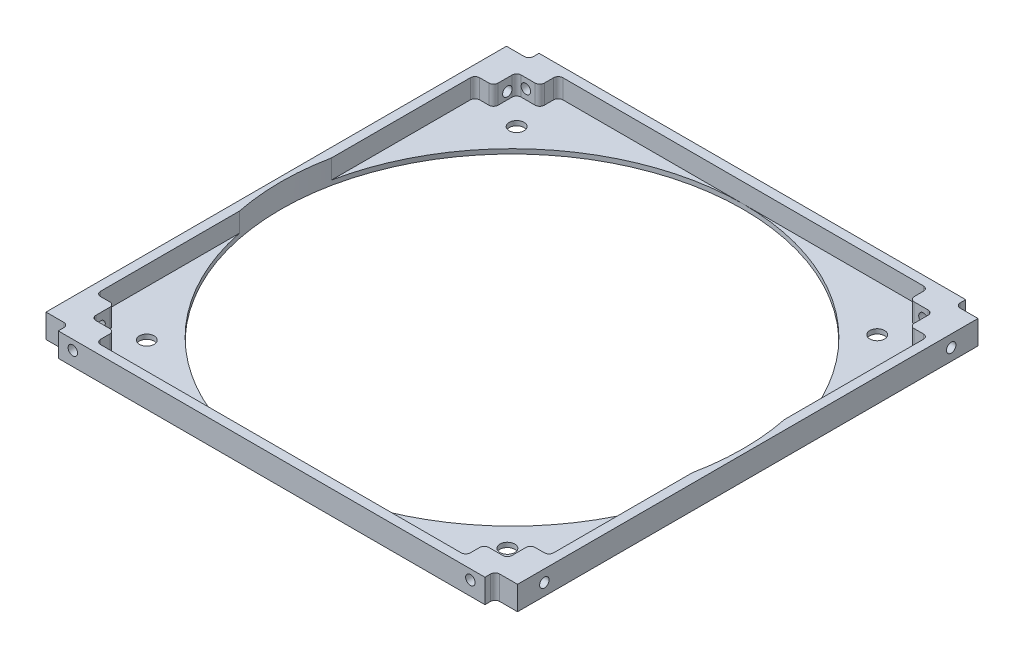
ISO-10303-21;
HEADER;
FILE_DESCRIPTION(('STEP AP214'),'2;1');
FILE_NAME('part.step','',(''),(''),'','','');
FILE_SCHEMA(('AUTOMOTIVE_DESIGN { 1 0 10303 214 1 1 1 1 }'));
ENDSEC;
DATA;
#1=APPLICATION_CONTEXT('core data for automotive mechanical design processes');
#2=APPLICATION_PROTOCOL_DEFINITION('international standard','automotive_design',2000,#1);
#3=PRODUCT_CONTEXT('',#1,'mechanical');
#4=PRODUCT('Part','Part','',(#3));
#5=PRODUCT_RELATED_PRODUCT_CATEGORY('part','',(#4));
#6=PRODUCT_DEFINITION_FORMATION('','',#4);
#7=PRODUCT_DEFINITION_CONTEXT('part definition',#1,'design');
#8=PRODUCT_DEFINITION('design','',#6,#7);
#9=PRODUCT_DEFINITION_SHAPE('','',#8);
#10=(LENGTH_UNIT() NAMED_UNIT(*) SI_UNIT(.MILLI.,.METRE.));
#11=(NAMED_UNIT(*) PLANE_ANGLE_UNIT() SI_UNIT($,.RADIAN.));
#12=(NAMED_UNIT(*) SI_UNIT($,.STERADIAN.) SOLID_ANGLE_UNIT());
#13=UNCERTAINTY_MEASURE_WITH_UNIT(LENGTH_MEASURE(1.E-05),#10,'distance_accuracy_value','');
#14=(GEOMETRIC_REPRESENTATION_CONTEXT(3) GLOBAL_UNCERTAINTY_ASSIGNED_CONTEXT((#13)) GLOBAL_UNIT_ASSIGNED_CONTEXT((#10,
#11,#12)) REPRESENTATION_CONTEXT('',''));
#15=CARTESIAN_POINT('',(0.,0.,0.));
#16=DIRECTION('',(0.,0.,1.));
#17=DIRECTION('',(1.,0.,0.));
#18=AXIS2_PLACEMENT_3D('',#15,#16,#17);
#19=CARTESIAN_POINT('',(0.,1.,0.));
#20=DIRECTION('',(0.,-1.,0.));
#21=DIRECTION('',(0.,0.,-1.));
#22=AXIS2_PLACEMENT_3D('',#19,#20,#21);
#23=PLANE('',#22);
#24=CARTESIAN_POINT('',(39.,1.,40.));
#25=DIRECTION('',(0.,-1.,0.));
#26=DIRECTION('',(0.,0.,-1.));
#27=AXIS2_PLACEMENT_3D('',#24,#25,#26);
#28=CIRCLE('',#27,1.6);
#29=CARTESIAN_POINT('',(39.,1.,38.4));
#30=VERTEX_POINT('',#29);
#31=EDGE_CURVE('E912',#30,#30,#28,.T.);
#32=ORIENTED_EDGE('',*,*,#31,.T.);
#33=EDGE_LOOP('',(#32));
#34=FACE_BOUND('',#33,.T.);
#35=DIRECTION('',(1.,0.,0.));
#36=VECTOR('',#35,1.);
#37=CARTESIAN_POINT('',(0.,1.,41.));
#38=LINE('',#37,#36);
#39=CARTESIAN_POINT('',(46.,1.,41.));
#40=VERTEX_POINT('',#39);
#41=CARTESIAN_POINT('',(48.,1.,41.));
#42=VERTEX_POINT('',#41);
#43=EDGE_CURVE('E915',#40,#42,#38,.T.);
#44=ORIENTED_EDGE('',*,*,#43,.T.);
#45=CARTESIAN_POINT('',(48.,1.,40.));
#46=DIRECTION('',(0.,-1.,0.));
#47=DIRECTION('',(0.,0.,-1.));
#48=AXIS2_PLACEMENT_3D('',#45,#46,#47);
#49=CIRCLE('',#48,1.);
#50=CARTESIAN_POINT('',(49.,1.,40.));
#51=VERTEX_POINT('',#50);
#52=EDGE_CURVE('E544',#42,#51,#49,.F.);
#53=ORIENTED_EDGE('',*,*,#52,.T.);
#54=DIRECTION('',(0.,0.,-1.));
#55=VECTOR('',#54,1.);
#56=CARTESIAN_POINT('',(49.,1.,50.));
#57=LINE('',#56,#55);
#58=CARTESIAN_POINT('',(49.,1.,9.94987437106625));
#59=VERTEX_POINT('',#58);
#60=EDGE_CURVE('E935',#51,#59,#57,.T.);
#61=ORIENTED_EDGE('',*,*,#60,.T.);
#62=CARTESIAN_POINT('',(0.,1.,0.));
#63=DIRECTION('',(0.,-1.,0.));
#64=DIRECTION('',(0.,0.,-1.));
#65=AXIS2_PLACEMENT_3D('',#62,#63,#64);
#66=CIRCLE('',#65,50.);
#67=CARTESIAN_POINT('',(0.,1.,50.));
#68=VERTEX_POINT('',#67);
#69=EDGE_CURVE('E1286',#59,#68,#66,.T.);
#70=ORIENTED_EDGE('',*,*,#69,.T.);
#71=DIRECTION('',(1.,0.,0.));
#72=VECTOR('',#71,1.);
#73=CARTESIAN_POINT('',(-49.,1.,50.));
#74=LINE('',#73,#72);
#75=CARTESIAN_POINT('',(39.,1.,50.));
#76=VERTEX_POINT('',#75);
#77=EDGE_CURVE('E962',#68,#76,#74,.T.);
#78=ORIENTED_EDGE('',*,*,#77,.T.);
#79=CARTESIAN_POINT('',(39.,1.,49.));
#80=DIRECTION('',(0.,-1.,0.));
#81=DIRECTION('',(0.,0.,-1.));
#82=AXIS2_PLACEMENT_3D('',#79,#80,#81);
#83=CIRCLE('',#82,1.);
#84=CARTESIAN_POINT('',(40.,1.,49.));
#85=VERTEX_POINT('',#84);
#86=EDGE_CURVE('E541',#76,#85,#83,.F.);
#87=ORIENTED_EDGE('',*,*,#86,.T.);
#88=DIRECTION('',(0.,0.,-1.));
#89=VECTOR('',#88,1.);
#90=CARTESIAN_POINT('',(40.,1.,0.));
#91=LINE('',#90,#89);
#92=CARTESIAN_POINT('',(40.,1.,47.));
#93=VERTEX_POINT('',#92);
#94=EDGE_CURVE('E922',#85,#93,#91,.T.);
#95=ORIENTED_EDGE('',*,*,#94,.T.);
#96=CARTESIAN_POINT('',(41.,1.,47.));
#97=DIRECTION('',(0.,-1.,0.));
#98=DIRECTION('',(0.,0.,-1.));
#99=AXIS2_PLACEMENT_3D('',#96,#97,#98);
#100=CIRCLE('',#99,1.);
#101=CARTESIAN_POINT('',(41.,1.,46.));
#102=VERTEX_POINT('',#101);
#103=EDGE_CURVE('E568',#93,#102,#100,.T.);
#104=ORIENTED_EDGE('',*,*,#103,.T.);
#105=DIRECTION('',(1.,0.,0.));
#106=VECTOR('',#105,1.);
#107=CARTESIAN_POINT('',(0.,1.,46.));
#108=LINE('',#107,#106);
#109=CARTESIAN_POINT('',(44.,1.,46.));
#110=VERTEX_POINT('',#109);
#111=EDGE_CURVE('E1002',#102,#110,#108,.T.);
#112=ORIENTED_EDGE('',*,*,#111,.T.);
#113=CARTESIAN_POINT('',(44.,1.,45.));
#114=DIRECTION('',(0.,-1.,0.));
#115=DIRECTION('',(0.,0.,-1.));
#116=AXIS2_PLACEMENT_3D('',#113,#114,#115);
#117=CIRCLE('',#116,1.);
#118=CARTESIAN_POINT('',(45.,1.,45.));
#119=VERTEX_POINT('',#118);
#120=EDGE_CURVE('E489',#110,#119,#117,.F.);
#121=ORIENTED_EDGE('',*,*,#120,.T.);
#122=DIRECTION('',(0.,0.,-1.));
#123=VECTOR('',#122,1.);
#124=CARTESIAN_POINT('',(45.,1.,0.));
#125=LINE('',#124,#123);
#126=CARTESIAN_POINT('',(45.,1.,42.));
#127=VERTEX_POINT('',#126);
#128=EDGE_CURVE('E1000',#119,#127,#125,.T.);
#129=ORIENTED_EDGE('',*,*,#128,.T.);
#130=CARTESIAN_POINT('',(46.,1.,42.));
#131=DIRECTION('',(0.,-1.,0.));
#132=DIRECTION('',(0.,0.,-1.));
#133=AXIS2_PLACEMENT_3D('',#130,#131,#132);
#134=CIRCLE('',#133,1.);
#135=EDGE_CURVE('E566',#127,#40,#134,.T.);
#136=ORIENTED_EDGE('',*,*,#135,.T.);
#137=EDGE_LOOP('',(#44,#53,#61,#70,#78,#87,#95,#104,#112,#121,#129,#136));
#138=FACE_BOUND('',#137,.T.);
#139=ADVANCED_FACE('F38',(#34,#138),#23,.F.);
#140=CARTESIAN_POINT('',(-39.,1.,40.));
#141=DIRECTION('',(0.,-1.,0.));
#142=DIRECTION('',(0.,0.,-1.));
#143=AXIS2_PLACEMENT_3D('',#140,#141,#142);
#144=CIRCLE('',#143,1.6);
#145=CARTESIAN_POINT('',(-39.,1.,38.4));
#146=VERTEX_POINT('',#145);
#147=EDGE_CURVE('E1271',#146,#146,#144,.T.);
#148=ORIENTED_EDGE('',*,*,#147,.T.);
#149=EDGE_LOOP('',(#148));
#150=FACE_BOUND('',#149,.T.);
#151=DIRECTION('',(0.,0.,1.));
#152=VECTOR('',#151,1.);
#153=CARTESIAN_POINT('',(-49.,1.,50.));
#154=LINE('',#153,#152);
#155=CARTESIAN_POINT('',(-49.,1.,9.94987437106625));
#156=VERTEX_POINT('',#155);
#157=CARTESIAN_POINT('',(-49.,1.,40.));
#158=VERTEX_POINT('',#157);
#159=EDGE_CURVE('E955',#156,#158,#154,.T.);
#160=ORIENTED_EDGE('',*,*,#159,.T.);
#161=CARTESIAN_POINT('',(-48.,1.,40.));
#162=DIRECTION('',(0.,-1.,0.));
#163=DIRECTION('',(0.,0.,-1.));
#164=AXIS2_PLACEMENT_3D('',#161,#162,#163);
#165=CIRCLE('',#164,1.);
#166=CARTESIAN_POINT('',(-48.,1.,41.));
#167=VERTEX_POINT('',#166);
#168=EDGE_CURVE('E1094',#158,#167,#165,.F.);
#169=ORIENTED_EDGE('',*,*,#168,.T.);
#170=DIRECTION('',(1.,0.,0.));
#171=VECTOR('',#170,1.);
#172=CARTESIAN_POINT('',(0.,1.,41.));
#173=LINE('',#172,#171);
#174=CARTESIAN_POINT('',(-46.,1.,41.));
#175=VERTEX_POINT('',#174);
#176=EDGE_CURVE('E1180',#167,#175,#173,.T.);
#177=ORIENTED_EDGE('',*,*,#176,.T.);
#178=CARTESIAN_POINT('',(-46.,1.,42.));
#179=DIRECTION('',(0.,-1.,0.));
#180=DIRECTION('',(0.,0.,-1.));
#181=AXIS2_PLACEMENT_3D('',#178,#179,#180);
#182=CIRCLE('',#181,1.);
#183=CARTESIAN_POINT('',(-45.,1.,42.));
#184=VERTEX_POINT('',#183);
#185=EDGE_CURVE('E546',#175,#184,#182,.T.);
#186=ORIENTED_EDGE('',*,*,#185,.T.);
#187=DIRECTION('',(0.,0.,1.));
#188=VECTOR('',#187,1.);
#189=CARTESIAN_POINT('',(-45.,1.,0.));
#190=LINE('',#189,#188);
#191=CARTESIAN_POINT('',(-45.,1.,45.));
#192=VERTEX_POINT('',#191);
#193=EDGE_CURVE('E1007',#184,#192,#190,.T.);
#194=ORIENTED_EDGE('',*,*,#193,.T.);
#195=CARTESIAN_POINT('',(-44.,1.,45.));
#196=DIRECTION('',(0.,-1.,0.));
#197=DIRECTION('',(0.,0.,-1.));
#198=AXIS2_PLACEMENT_3D('',#195,#196,#197);
#199=CIRCLE('',#198,1.);
#200=CARTESIAN_POINT('',(-44.,1.,46.));
#201=VERTEX_POINT('',#200);
#202=EDGE_CURVE('E1092',#192,#201,#199,.F.);
#203=ORIENTED_EDGE('',*,*,#202,.T.);
#204=DIRECTION('',(1.,0.,0.));
#205=VECTOR('',#204,1.);
#206=CARTESIAN_POINT('',(0.,1.,46.));
#207=LINE('',#206,#205);
#208=CARTESIAN_POINT('',(-41.,1.,46.));
#209=VERTEX_POINT('',#208);
#210=EDGE_CURVE('E1004',#201,#209,#207,.T.);
#211=ORIENTED_EDGE('',*,*,#210,.T.);
#212=CARTESIAN_POINT('',(-41.,1.,47.));
#213=DIRECTION('',(0.,-1.,0.));
#214=DIRECTION('',(0.,0.,-1.));
#215=AXIS2_PLACEMENT_3D('',#212,#213,#214);
#216=CIRCLE('',#215,1.);
#217=CARTESIAN_POINT('',(-40.,1.,47.));
#218=VERTEX_POINT('',#217);
#219=EDGE_CURVE('E562',#209,#218,#216,.T.);
#220=ORIENTED_EDGE('',*,*,#219,.T.);
#221=DIRECTION('',(0.,0.,1.));
#222=VECTOR('',#221,1.);
#223=CARTESIAN_POINT('',(-40.,1.,0.));
#224=LINE('',#223,#222);
#225=CARTESIAN_POINT('',(-40.,1.,49.));
#226=VERTEX_POINT('',#225);
#227=EDGE_CURVE('E1187',#218,#226,#224,.T.);
#228=ORIENTED_EDGE('',*,*,#227,.T.);
#229=CARTESIAN_POINT('',(-39.,1.,49.));
#230=DIRECTION('',(0.,-1.,0.));
#231=DIRECTION('',(0.,0.,-1.));
#232=AXIS2_PLACEMENT_3D('',#229,#230,#231);
#233=CIRCLE('',#232,1.);
#234=CARTESIAN_POINT('',(-39.,1.,50.));
#235=VERTEX_POINT('',#234);
#236=EDGE_CURVE('E1090',#226,#235,#233,.F.);
#237=ORIENTED_EDGE('',*,*,#236,.T.);
#238=EDGE_CURVE('E960',#235,#68,#74,.T.);
#239=ORIENTED_EDGE('',*,*,#238,.T.);
#240=EDGE_CURVE('E1289',#68,#156,#66,.T.);
#241=ORIENTED_EDGE('',*,*,#240,.T.);
#242=EDGE_LOOP('',(#160,#169,#177,#186,#194,#203,#211,#220,#228,#237,#239,#241));
#243=FACE_BOUND('',#242,.T.);
#244=ADVANCED_FACE('F903',(#150,#243),#23,.F.);
#245=CARTESIAN_POINT('',(39.,1.,-40.));
#246=DIRECTION('',(0.,-1.,0.));
#247=DIRECTION('',(0.,0.,-1.));
#248=AXIS2_PLACEMENT_3D('',#245,#246,#247);
#249=CIRCLE('',#248,1.6);
#250=CARTESIAN_POINT('',(39.,1.,-41.6));
#251=VERTEX_POINT('',#250);
#252=EDGE_CURVE('E1265',#251,#251,#249,.T.);
#253=ORIENTED_EDGE('',*,*,#252,.T.);
#254=EDGE_LOOP('',(#253));
#255=FACE_BOUND('',#254,.T.);
#256=DIRECTION('',(0.,0.,-1.));
#257=VECTOR('',#256,1.);
#258=CARTESIAN_POINT('',(45.,1.,0.));
#259=LINE('',#258,#257);
#260=CARTESIAN_POINT('',(45.,1.,-42.));
#261=VERTEX_POINT('',#260);
#262=CARTESIAN_POINT('',(45.,1.,-45.));
#263=VERTEX_POINT('',#262);
#264=EDGE_CURVE('E997',#261,#263,#259,.T.);
#265=ORIENTED_EDGE('',*,*,#264,.T.);
#266=CARTESIAN_POINT('',(44.,1.,-45.));
#267=DIRECTION('',(0.,-1.,0.));
#268=DIRECTION('',(0.,0.,-1.));
#269=AXIS2_PLACEMENT_3D('',#266,#267,#268);
#270=CIRCLE('',#269,1.);
#271=CARTESIAN_POINT('',(44.,1.,-46.));
#272=VERTEX_POINT('',#271);
#273=EDGE_CURVE('E524',#263,#272,#270,.F.);
#274=ORIENTED_EDGE('',*,*,#273,.T.);
#275=DIRECTION('',(-1.,0.,0.));
#276=VECTOR('',#275,1.);
#277=CARTESIAN_POINT('',(0.,1.,-46.));
#278=LINE('',#277,#276);
#279=CARTESIAN_POINT('',(41.,1.,-46.));
#280=VERTEX_POINT('',#279);
#281=EDGE_CURVE('E994',#272,#280,#278,.T.);
#282=ORIENTED_EDGE('',*,*,#281,.T.);
#283=CARTESIAN_POINT('',(41.,1.,-47.));
#284=DIRECTION('',(0.,-1.,0.));
#285=DIRECTION('',(0.,0.,-1.));
#286=AXIS2_PLACEMENT_3D('',#283,#284,#285);
#287=CIRCLE('',#286,1.);
#288=CARTESIAN_POINT('',(40.,1.,-47.));
#289=VERTEX_POINT('',#288);
#290=EDGE_CURVE('E574',#280,#289,#287,.T.);
#291=ORIENTED_EDGE('',*,*,#290,.T.);
#292=DIRECTION('',(0.,0.,-1.));
#293=VECTOR('',#292,1.);
#294=CARTESIAN_POINT('',(40.,1.,0.));
#295=LINE('',#294,#293);
#296=CARTESIAN_POINT('',(40.,1.,-49.));
#297=VERTEX_POINT('',#296);
#298=EDGE_CURVE('E1219',#289,#297,#295,.T.);
#299=ORIENTED_EDGE('',*,*,#298,.T.);
#300=CARTESIAN_POINT('',(39.,1.,-49.));
#301=DIRECTION('',(0.,-1.,0.));
#302=DIRECTION('',(0.,0.,-1.));
#303=AXIS2_PLACEMENT_3D('',#300,#301,#302);
#304=CIRCLE('',#303,1.);
#305=CARTESIAN_POINT('',(39.,1.,-50.));
#306=VERTEX_POINT('',#305);
#307=EDGE_CURVE('E522',#297,#306,#304,.F.);
#308=ORIENTED_EDGE('',*,*,#307,.T.);
#309=DIRECTION('',(-1.,0.,0.));
#310=VECTOR('',#309,1.);
#311=CARTESIAN_POINT('',(-49.,1.,-50.));
#312=LINE('',#311,#310);
#313=CARTESIAN_POINT('',(0.,1.,-50.));
#314=VERTEX_POINT('',#313);
#315=EDGE_CURVE('E953',#306,#314,#312,.T.);
#316=ORIENTED_EDGE('',*,*,#315,.T.);
#317=CARTESIAN_POINT('',(49.,1.,-9.94987437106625));
#318=VERTEX_POINT('',#317);
#319=EDGE_CURVE('E1283',#314,#318,#66,.T.);
#320=ORIENTED_EDGE('',*,*,#319,.T.);
#321=CARTESIAN_POINT('',(49.,1.,-40.));
#322=VERTEX_POINT('',#321);
#323=EDGE_CURVE('E959',#318,#322,#57,.T.);
#324=ORIENTED_EDGE('',*,*,#323,.T.);
#325=CARTESIAN_POINT('',(48.,1.,-40.));
#326=DIRECTION('',(0.,-1.,0.));
#327=DIRECTION('',(0.,0.,-1.));
#328=AXIS2_PLACEMENT_3D('',#325,#326,#327);
#329=CIRCLE('',#328,1.);
#330=CARTESIAN_POINT('',(48.,1.,-41.));
#331=VERTEX_POINT('',#330);
#332=EDGE_CURVE('E520',#322,#331,#329,.F.);
#333=ORIENTED_EDGE('',*,*,#332,.T.);
#334=DIRECTION('',(-1.,0.,0.));
#335=VECTOR('',#334,1.);
#336=CARTESIAN_POINT('',(0.,1.,-41.));
#337=LINE('',#336,#335);
#338=CARTESIAN_POINT('',(46.,1.,-41.));
#339=VERTEX_POINT('',#338);
#340=EDGE_CURVE('E1216',#331,#339,#337,.T.);
#341=ORIENTED_EDGE('',*,*,#340,.T.);
#342=CARTESIAN_POINT('',(46.,1.,-42.));
#343=DIRECTION('',(0.,-1.,0.));
#344=DIRECTION('',(0.,0.,-1.));
#345=AXIS2_PLACEMENT_3D('',#342,#343,#344);
#346=CIRCLE('',#345,1.);
#347=EDGE_CURVE('E572',#339,#261,#346,.T.);
#348=ORIENTED_EDGE('',*,*,#347,.T.);
#349=EDGE_LOOP('',(#265,#274,#282,#291,#299,#308,#316,#320,#324,#333,#341,#348));
#350=FACE_BOUND('',#349,.T.);
#351=ADVANCED_FACE('F786',(#255,#350),#23,.F.);
#352=CARTESIAN_POINT('',(-49.,-140.014284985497,50.));
#353=DIRECTION('',(-1.,0.,0.));
#354=DIRECTION('',(0.,0.,1.));
#355=AXIS2_PLACEMENT_3D('',#352,#353,#354);
#356=PLANE('',#355);
#357=CARTESIAN_POINT('',(-49.,1.,-40.));
#358=VERTEX_POINT('',#357);
#359=CARTESIAN_POINT('',(-49.,1.,-9.94987437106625));
#360=VERTEX_POINT('',#359);
#361=EDGE_CURVE('E963',#358,#360,#154,.T.);
#362=ORIENTED_EDGE('',*,*,#361,.F.);
#363=DIRECTION('',(0.,1.,0.));
#364=VECTOR('',#363,1.);
#365=CARTESIAN_POINT('',(-49.,-140.014284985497,-40.));
#366=LINE('',#365,#364);
#367=CARTESIAN_POINT('',(-49.,5.15,-40.));
#368=VERTEX_POINT('',#367);
#369=EDGE_CURVE('E1085',#358,#368,#366,.T.);
#370=ORIENTED_EDGE('',*,*,#369,.T.);
#371=DIRECTION('',(0.,0.,1.));
#372=VECTOR('',#371,1.);
#373=CARTESIAN_POINT('',(-49.,5.15,50.));
#374=LINE('',#373,#372);
#375=CARTESIAN_POINT('',(-49.,5.15,-9.94987437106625));
#376=VERTEX_POINT('',#375);
#377=EDGE_CURVE('E1162',#368,#376,#374,.T.);
#378=ORIENTED_EDGE('',*,*,#377,.T.);
#379=DIRECTION('',(0.,-1.,0.));
#380=VECTOR('',#379,1.);
#381=CARTESIAN_POINT('',(-49.,5.15,-9.94987437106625));
#382=LINE('',#381,#380);
#383=EDGE_CURVE('E1290',#376,#360,#382,.T.);
#384=ORIENTED_EDGE('',*,*,#383,.T.);
#385=EDGE_LOOP('',(#362,#370,#378,#384));
#386=FACE_BOUND('',#385,.T.);
#387=ADVANCED_FACE('F777',(#386),#356,.F.);
#388=CARTESIAN_POINT('',(49.,-140.014284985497,50.));
#389=DIRECTION('',(1.,0.,0.));
#390=DIRECTION('',(0.,0.,-1.));
#391=AXIS2_PLACEMENT_3D('',#388,#389,#390);
#392=PLANE('',#391);
#393=ORIENTED_EDGE('',*,*,#60,.F.);
#394=DIRECTION('',(0.,1.,0.));
#395=VECTOR('',#394,1.);
#396=CARTESIAN_POINT('',(49.,-140.014284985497,40.));
#397=LINE('',#396,#395);
#398=CARTESIAN_POINT('',(49.,5.15,40.));
#399=VERTEX_POINT('',#398);
#400=EDGE_CURVE('E538',#51,#399,#397,.T.);
#401=ORIENTED_EDGE('',*,*,#400,.T.);
#402=DIRECTION('',(0.,0.,-1.));
#403=VECTOR('',#402,1.);
#404=CARTESIAN_POINT('',(49.,5.15,50.));
#405=LINE('',#404,#403);
#406=CARTESIAN_POINT('',(49.,5.15,9.94987437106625));
#407=VERTEX_POINT('',#406);
#408=EDGE_CURVE('E933',#399,#407,#405,.T.);
#409=ORIENTED_EDGE('',*,*,#408,.T.);
#410=DIRECTION('',(0.,-1.,0.));
#411=VECTOR('',#410,1.);
#412=CARTESIAN_POINT('',(49.,5.15,9.94987437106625));
#413=LINE('',#412,#411);
#414=EDGE_CURVE('E1013',#407,#59,#413,.T.);
#415=ORIENTED_EDGE('',*,*,#414,.T.);
#416=EDGE_LOOP('',(#393,#401,#409,#415));
#417=FACE_BOUND('',#416,.T.);
#418=ADVANCED_FACE('F768',(#417),#392,.F.);
#419=CARTESIAN_POINT('',(51.,5.15,52.));
#420=DIRECTION('',(-1.,0.,0.));
#421=DIRECTION('',(0.,0.,1.));
#422=AXIS2_PLACEMENT_3D('',#419,#420,#421);
#423=PLANE('',#422);
#424=CARTESIAN_POINT('',(51.,2.575,44.));
#425=DIRECTION('',(1.,0.,0.));
#426=DIRECTION('',(0.,0.,-1.));
#427=AXIS2_PLACEMENT_3D('',#424,#425,#426);
#428=CIRCLE('',#427,1.025);
#429=CARTESIAN_POINT('',(51.,2.575,42.975));
#430=VERTEX_POINT('',#429);
#431=EDGE_CURVE('E1252',#430,#430,#428,.T.);
#432=ORIENTED_EDGE('',*,*,#431,.F.);
#433=EDGE_LOOP('',(#432));
#434=FACE_BOUND('',#433,.T.);
#435=CARTESIAN_POINT('',(51.,2.575,-44.));
#436=DIRECTION('',(1.,0.,0.));
#437=DIRECTION('',(0.,0.,-1.));
#438=AXIS2_PLACEMENT_3D('',#435,#436,#437);
#439=CIRCLE('',#438,1.025);
#440=CARTESIAN_POINT('',(51.,2.575,-45.025));
#441=VERTEX_POINT('',#440);
#442=EDGE_CURVE('E1256',#441,#441,#439,.T.);
#443=ORIENTED_EDGE('',*,*,#442,.F.);
#444=EDGE_LOOP('',(#443));
#445=FACE_BOUND('',#444,.T.);
#446=DIRECTION('',(0.,0.,-1.));
#447=VECTOR('',#446,1.);
#448=CARTESIAN_POINT('',(51.,5.15,52.));
#449=LINE('',#448,#447);
#450=CARTESIAN_POINT('',(51.,5.15,49.8));
#451=VERTEX_POINT('',#450);
#452=CARTESIAN_POINT('',(51.,5.15,-49.8));
#453=VERTEX_POINT('',#452);
#454=EDGE_CURVE('E965',#451,#453,#449,.T.);
#455=ORIENTED_EDGE('',*,*,#454,.F.);
#456=DIRECTION('',(0.,1.,0.));
#457=VECTOR('',#456,1.);
#458=CARTESIAN_POINT('',(51.,0.,49.8));
#459=LINE('',#458,#457);
#460=CARTESIAN_POINT('',(51.,0.,49.8));
#461=VERTEX_POINT('',#460);
#462=EDGE_CURVE('E1298',#461,#451,#459,.T.);
#463=ORIENTED_EDGE('',*,*,#462,.F.);
#464=DIRECTION('',(0.,0.,-1.));
#465=VECTOR('',#464,1.);
#466=CARTESIAN_POINT('',(51.,0.,52.));
#467=LINE('',#466,#465);
#468=CARTESIAN_POINT('',(51.,0.,-49.8));
#469=VERTEX_POINT('',#468);
#470=EDGE_CURVE('E958',#461,#469,#467,.T.);
#471=ORIENTED_EDGE('',*,*,#470,.T.);
#472=DIRECTION('',(0.,1.,0.));
#473=VECTOR('',#472,1.);
#474=CARTESIAN_POINT('',(51.,0.,-49.8));
#475=LINE('',#474,#473);
#476=EDGE_CURVE('E1348',#469,#453,#475,.T.);
#477=ORIENTED_EDGE('',*,*,#476,.T.);
#478=EDGE_LOOP('',(#455,#463,#471,#477));
#479=FACE_BOUND('',#478,.T.);
#480=ADVANCED_FACE('F805',(#434,#445,#479),#423,.F.);
#481=CARTESIAN_POINT('',(-51.,5.15,-52.));
#482=DIRECTION('',(0.,0.,1.));
#483=DIRECTION('',(1.,0.,0.));
#484=AXIS2_PLACEMENT_3D('',#481,#482,#483);
#485=PLANE('',#484);
#486=CARTESIAN_POINT('',(-43.,3.075,-52.));
#487=DIRECTION('',(0.,0.,-1.));
#488=DIRECTION('',(-1.,0.,0.));
#489=AXIS2_PLACEMENT_3D('',#486,#487,#488);
#490=CIRCLE('',#489,1.02499999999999);
#491=CARTESIAN_POINT('',(-44.025,3.075,-52.));
#492=VERTEX_POINT('',#491);
#493=EDGE_CURVE('E1233',#492,#492,#490,.T.);
#494=ORIENTED_EDGE('',*,*,#493,.F.);
#495=EDGE_LOOP('',(#494));
#496=FACE_BOUND('',#495,.T.);
#497=CARTESIAN_POINT('',(43.,3.075,-52.));
#498=DIRECTION('',(0.,0.,-1.));
#499=DIRECTION('',(-1.,0.,0.));
#500=AXIS2_PLACEMENT_3D('',#497,#498,#499);
#501=CIRCLE('',#500,1.02499999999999);
#502=CARTESIAN_POINT('',(41.975,3.075,-52.));
#503=VERTEX_POINT('',#502);
#504=EDGE_CURVE('E1232',#503,#503,#501,.T.);
#505=ORIENTED_EDGE('',*,*,#504,.F.);
#506=EDGE_LOOP('',(#505));
#507=FACE_BOUND('',#506,.T.);
#508=DIRECTION('',(-1.,0.,0.));
#509=VECTOR('',#508,1.);
#510=CARTESIAN_POINT('',(-51.,0.,-52.));
#511=LINE('',#510,#509);
#512=CARTESIAN_POINT('',(46.15,0.,-52.));
#513=VERTEX_POINT('',#512);
#514=CARTESIAN_POINT('',(-46.15,0.,-52.));
#515=VERTEX_POINT('',#514);
#516=EDGE_CURVE('E981',#513,#515,#511,.T.);
#517=ORIENTED_EDGE('',*,*,#516,.T.);
#518=DIRECTION('',(0.,1.,0.));
#519=VECTOR('',#518,1.);
#520=CARTESIAN_POINT('',(-46.15,0.,-52.));
#521=LINE('',#520,#519);
#522=CARTESIAN_POINT('',(-46.15,5.15,-52.));
#523=VERTEX_POINT('',#522);
#524=EDGE_CURVE('E1333',#515,#523,#521,.T.);
#525=ORIENTED_EDGE('',*,*,#524,.T.);
#526=DIRECTION('',(-1.,0.,0.));
#527=VECTOR('',#526,1.);
#528=CARTESIAN_POINT('',(-51.,5.15,-52.));
#529=LINE('',#528,#527);
#530=CARTESIAN_POINT('',(46.15,5.15,-52.));
#531=VERTEX_POINT('',#530);
#532=EDGE_CURVE('E968',#531,#523,#529,.T.);
#533=ORIENTED_EDGE('',*,*,#532,.F.);
#534=DIRECTION('',(0.,1.,0.));
#535=VECTOR('',#534,1.);
#536=CARTESIAN_POINT('',(46.15,0.,-52.));
#537=LINE('',#536,#535);
#538=EDGE_CURVE('E1344',#513,#531,#537,.T.);
#539=ORIENTED_EDGE('',*,*,#538,.F.);
#540=EDGE_LOOP('',(#517,#525,#533,#539));
#541=FACE_BOUND('',#540,.T.);
#542=ADVANCED_FACE('F801',(#496,#507,#541),#485,.F.);
#543=CARTESIAN_POINT('',(-51.,5.15,52.));
#544=DIRECTION('',(1.,0.,0.));
#545=DIRECTION('',(0.,0.,-1.));
#546=AXIS2_PLACEMENT_3D('',#543,#544,#545);
#547=PLANE('',#546);
#548=CARTESIAN_POINT('',(-51.,2.575,44.));
#549=DIRECTION('',(-1.,0.,0.));
#550=DIRECTION('',(0.,0.,1.));
#551=AXIS2_PLACEMENT_3D('',#548,#549,#550);
#552=CIRCLE('',#551,1.02499999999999);
#553=CARTESIAN_POINT('',(-51.,2.575,45.025));
#554=VERTEX_POINT('',#553);
#555=EDGE_CURVE('E1243',#554,#554,#552,.T.);
#556=ORIENTED_EDGE('',*,*,#555,.F.);
#557=EDGE_LOOP('',(#556));
#558=FACE_BOUND('',#557,.T.);
#559=CARTESIAN_POINT('',(-51.,2.575,-44.));
#560=DIRECTION('',(-1.,0.,0.));
#561=DIRECTION('',(0.,0.,1.));
#562=AXIS2_PLACEMENT_3D('',#559,#560,#561);
#563=CIRCLE('',#562,1.02499999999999);
#564=CARTESIAN_POINT('',(-51.,2.575,-42.975));
#565=VERTEX_POINT('',#564);
#566=EDGE_CURVE('E1248',#565,#565,#563,.T.);
#567=ORIENTED_EDGE('',*,*,#566,.F.);
#568=EDGE_LOOP('',(#567));
#569=FACE_BOUND('',#568,.T.);
#570=DIRECTION('',(0.,0.,1.));
#571=VECTOR('',#570,1.);
#572=CARTESIAN_POINT('',(-51.,0.,52.));
#573=LINE('',#572,#571);
#574=CARTESIAN_POINT('',(-51.,0.,-49.8));
#575=VERTEX_POINT('',#574);
#576=CARTESIAN_POINT('',(-51.,0.,49.8));
#577=VERTEX_POINT('',#576);
#578=EDGE_CURVE('E984',#575,#577,#573,.T.);
#579=ORIENTED_EDGE('',*,*,#578,.T.);
#580=DIRECTION('',(0.,1.,0.));
#581=VECTOR('',#580,1.);
#582=CARTESIAN_POINT('',(-51.,0.,49.8));
#583=LINE('',#582,#581);
#584=CARTESIAN_POINT('',(-51.,5.15,49.8));
#585=VERTEX_POINT('',#584);
#586=EDGE_CURVE('E1318',#577,#585,#583,.T.);
#587=ORIENTED_EDGE('',*,*,#586,.T.);
#588=DIRECTION('',(0.,0.,1.));
#589=VECTOR('',#588,1.);
#590=CARTESIAN_POINT('',(-51.,5.15,52.));
#591=LINE('',#590,#589);
#592=CARTESIAN_POINT('',(-51.,5.15,-49.8));
#593=VERTEX_POINT('',#592);
#594=EDGE_CURVE('E972',#593,#585,#591,.T.);
#595=ORIENTED_EDGE('',*,*,#594,.F.);
#596=DIRECTION('',(0.,1.,0.));
#597=VECTOR('',#596,1.);
#598=CARTESIAN_POINT('',(-51.,0.,-49.8));
#599=LINE('',#598,#597);
#600=EDGE_CURVE('E1329',#575,#593,#599,.T.);
#601=ORIENTED_EDGE('',*,*,#600,.F.);
#602=EDGE_LOOP('',(#579,#587,#595,#601));
#603=FACE_BOUND('',#602,.T.);
#604=ADVANCED_FACE('F797',(#558,#569,#603),#547,.F.);
#605=CARTESIAN_POINT('',(-51.,5.15,52.));
#606=DIRECTION('',(0.,0.,-1.));
#607=DIRECTION('',(-1.,0.,0.));
#608=AXIS2_PLACEMENT_3D('',#605,#606,#607);
#609=PLANE('',#608);
#610=CARTESIAN_POINT('',(43.,3.075,52.));
#611=DIRECTION('',(0.,0.,1.));
#612=DIRECTION('',(1.,0.,0.));
#613=AXIS2_PLACEMENT_3D('',#610,#611,#612);
#614=CIRCLE('',#613,1.02499999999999);
#615=CARTESIAN_POINT('',(44.025,3.075,52.));
#616=VERTEX_POINT('',#615);
#617=EDGE_CURVE('E484',#616,#616,#614,.T.);
#618=ORIENTED_EDGE('',*,*,#617,.F.);
#619=EDGE_LOOP('',(#618));
#620=FACE_BOUND('',#619,.T.);
#621=CARTESIAN_POINT('',(-43.,3.075,52.));
#622=DIRECTION('',(0.,0.,1.));
#623=DIRECTION('',(1.,0.,0.));
#624=AXIS2_PLACEMENT_3D('',#621,#622,#623);
#625=CIRCLE('',#624,1.02499999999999);
#626=CARTESIAN_POINT('',(-41.975,3.075,52.));
#627=VERTEX_POINT('',#626);
#628=EDGE_CURVE('E483',#627,#627,#625,.T.);
#629=ORIENTED_EDGE('',*,*,#628,.F.);
#630=EDGE_LOOP('',(#629));
#631=FACE_BOUND('',#630,.T.);
#632=DIRECTION('',(1.,0.,0.));
#633=VECTOR('',#632,1.);
#634=CARTESIAN_POINT('',(-51.,0.,52.));
#635=LINE('',#634,#633);
#636=CARTESIAN_POINT('',(-46.15,0.,52.));
#637=VERTEX_POINT('',#636);
#638=CARTESIAN_POINT('',(46.15,0.,52.));
#639=VERTEX_POINT('',#638);
#640=EDGE_CURVE('E969',#637,#639,#635,.T.);
#641=ORIENTED_EDGE('',*,*,#640,.T.);
#642=DIRECTION('',(0.,1.,0.));
#643=VECTOR('',#642,1.);
#644=CARTESIAN_POINT('',(46.15,0.,52.));
#645=LINE('',#644,#643);
#646=CARTESIAN_POINT('',(46.15,5.15,52.));
#647=VERTEX_POINT('',#646);
#648=EDGE_CURVE('E1303',#639,#647,#645,.T.);
#649=ORIENTED_EDGE('',*,*,#648,.T.);
#650=DIRECTION('',(1.,0.,0.));
#651=VECTOR('',#650,1.);
#652=CARTESIAN_POINT('',(-51.,5.15,52.));
#653=LINE('',#652,#651);
#654=CARTESIAN_POINT('',(-46.15,5.15,52.));
#655=VERTEX_POINT('',#654);
#656=EDGE_CURVE('E975',#655,#647,#653,.T.);
#657=ORIENTED_EDGE('',*,*,#656,.F.);
#658=DIRECTION('',(0.,1.,0.));
#659=VECTOR('',#658,1.);
#660=CARTESIAN_POINT('',(-46.15,0.,52.));
#661=LINE('',#660,#659);
#662=EDGE_CURVE('E1314',#637,#655,#661,.T.);
#663=ORIENTED_EDGE('',*,*,#662,.F.);
#664=EDGE_LOOP('',(#641,#649,#657,#663));
#665=FACE_BOUND('',#664,.T.);
#666=ADVANCED_FACE('F790',(#620,#631,#665),#609,.F.);
#667=CARTESIAN_POINT('',(0.,5.15,0.));
#668=DIRECTION('',(0.,-1.,0.));
#669=DIRECTION('',(0.,0.,-1.));
#670=AXIS2_PLACEMENT_3D('',#667,#668,#669);
#671=PLANE('',#670);
#672=DIRECTION('',(0.,0.,1.));
#673=VECTOR('',#672,1.);
#674=CARTESIAN_POINT('',(-45.,5.15,41.));
#675=LINE('',#674,#673);
#676=CARTESIAN_POINT('',(-45.,5.15,42.));
#677=VERTEX_POINT('',#676);
#678=CARTESIAN_POINT('',(-45.,5.15,45.));
#679=VERTEX_POINT('',#678);
#680=EDGE_CURVE('E1354',#677,#679,#675,.T.);
#681=ORIENTED_EDGE('',*,*,#680,.F.);
#682=CARTESIAN_POINT('',(-46.,5.15,42.));
#683=DIRECTION('',(0.,-1.,0.));
#684=DIRECTION('',(0.,0.,-1.));
#685=AXIS2_PLACEMENT_3D('',#682,#683,#684);
#686=CIRCLE('',#685,1.);
#687=CARTESIAN_POINT('',(-46.,5.15,41.));
#688=VERTEX_POINT('',#687);
#689=EDGE_CURVE('E1042',#677,#688,#686,.F.);
#690=ORIENTED_EDGE('',*,*,#689,.T.);
#691=DIRECTION('',(1.,0.,0.));
#692=VECTOR('',#691,1.);
#693=CARTESIAN_POINT('',(-49.,5.15,41.));
#694=LINE('',#693,#692);
#695=CARTESIAN_POINT('',(-48.,5.15,41.));
#696=VERTEX_POINT('',#695);
#697=EDGE_CURVE('E1351',#696,#688,#694,.T.);
#698=ORIENTED_EDGE('',*,*,#697,.F.);
#699=CARTESIAN_POINT('',(-48.,5.15,40.));
#700=DIRECTION('',(0.,-1.,0.));
#701=DIRECTION('',(0.,0.,-1.));
#702=AXIS2_PLACEMENT_3D('',#699,#700,#701);
#703=CIRCLE('',#702,1.);
#704=CARTESIAN_POINT('',(-49.,5.15,40.));
#705=VERTEX_POINT('',#704);
#706=EDGE_CURVE('E558',#696,#705,#703,.T.);
#707=ORIENTED_EDGE('',*,*,#706,.T.);
#708=CARTESIAN_POINT('',(-49.,5.15,9.94987437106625));
#709=VERTEX_POINT('',#708);
#710=EDGE_CURVE('E947',#709,#705,#374,.T.);
#711=ORIENTED_EDGE('',*,*,#710,.F.);
#712=CARTESIAN_POINT('',(0.,5.15,0.));
#713=DIRECTION('',(0.,-1.,0.));
#714=DIRECTION('',(0.,0.,-1.));
#715=AXIS2_PLACEMENT_3D('',#712,#713,#714);
#716=CIRCLE('',#715,50.);
#717=EDGE_CURVE('E1279',#709,#376,#716,.T.);
#718=ORIENTED_EDGE('',*,*,#717,.T.);
#719=ORIENTED_EDGE('',*,*,#377,.F.);
#720=CARTESIAN_POINT('',(-48.,5.14999999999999,-40.));
#721=DIRECTION('',(0.,-1.,0.));
#722=DIRECTION('',(0.,0.,-1.));
#723=AXIS2_PLACEMENT_3D('',#720,#721,#722);
#724=CIRCLE('',#723,1.);
#725=CARTESIAN_POINT('',(-48.,5.15,-41.));
#726=VERTEX_POINT('',#725);
#727=EDGE_CURVE('E556',#368,#726,#724,.T.);
#728=ORIENTED_EDGE('',*,*,#727,.T.);
#729=DIRECTION('',(-1.,0.,0.));
#730=VECTOR('',#729,1.);
#731=CARTESIAN_POINT('',(-49.,5.15,-41.));
#732=LINE('',#731,#730);
#733=CARTESIAN_POINT('',(-46.,5.15,-41.));
#734=VERTEX_POINT('',#733);
#735=EDGE_CURVE('E1146',#734,#726,#732,.T.);
#736=ORIENTED_EDGE('',*,*,#735,.F.);
#737=CARTESIAN_POINT('',(-46.,5.15,-42.));
#738=DIRECTION('',(0.,-1.,0.));
#739=DIRECTION('',(0.,0.,-1.));
#740=AXIS2_PLACEMENT_3D('',#737,#738,#739);
#741=CIRCLE('',#740,1.);
#742=CARTESIAN_POINT('',(-45.,5.15,-42.));
#743=VERTEX_POINT('',#742);
#744=EDGE_CURVE('E1038',#734,#743,#741,.F.);
#745=ORIENTED_EDGE('',*,*,#744,.T.);
#746=DIRECTION('',(0.,0.,1.));
#747=VECTOR('',#746,1.);
#748=CARTESIAN_POINT('',(-45.,5.15,-41.));
#749=LINE('',#748,#747);
#750=CARTESIAN_POINT('',(-45.,5.15,-45.));
#751=VERTEX_POINT('',#750);
#752=EDGE_CURVE('E1151',#751,#743,#749,.T.);
#753=ORIENTED_EDGE('',*,*,#752,.F.);
#754=CARTESIAN_POINT('',(-44.,5.15,-45.));
#755=DIRECTION('',(0.,-1.,0.));
#756=DIRECTION('',(0.,0.,-1.));
#757=AXIS2_PLACEMENT_3D('',#754,#755,#756);
#758=CIRCLE('',#757,1.);
#759=CARTESIAN_POINT('',(-44.,5.15,-46.));
#760=VERTEX_POINT('',#759);
#761=EDGE_CURVE('E552',#751,#760,#758,.T.);
#762=ORIENTED_EDGE('',*,*,#761,.T.);
#763=DIRECTION('',(-1.,0.,0.));
#764=VECTOR('',#763,1.);
#765=CARTESIAN_POINT('',(-45.,5.15,-46.));
#766=LINE('',#765,#764);
#767=CARTESIAN_POINT('',(-41.,5.15,-46.));
#768=VERTEX_POINT('',#767);
#769=EDGE_CURVE('E1154',#768,#760,#766,.T.);
#770=ORIENTED_EDGE('',*,*,#769,.F.);
#771=CARTESIAN_POINT('',(-41.,5.15,-47.));
#772=DIRECTION('',(0.,-1.,0.));
#773=DIRECTION('',(0.,0.,-1.));
#774=AXIS2_PLACEMENT_3D('',#771,#772,#773);
#775=CIRCLE('',#774,1.);
#776=CARTESIAN_POINT('',(-40.,5.15,-47.));
#777=VERTEX_POINT('',#776);
#778=EDGE_CURVE('E1040',#768,#777,#775,.F.);
#779=ORIENTED_EDGE('',*,*,#778,.T.);
#780=DIRECTION('',(0.,0.,1.));
#781=VECTOR('',#780,1.);
#782=CARTESIAN_POINT('',(-40.,5.15,-46.));
#783=LINE('',#782,#781);
#784=CARTESIAN_POINT('',(-40.,5.15,-49.));
#785=VERTEX_POINT('',#784);
#786=EDGE_CURVE('E1222',#785,#777,#783,.T.);
#787=ORIENTED_EDGE('',*,*,#786,.F.);
#788=CARTESIAN_POINT('',(-39.,5.15,-49.));
#789=DIRECTION('',(0.,-1.,0.));
#790=DIRECTION('',(0.,0.,-1.));
#791=AXIS2_PLACEMENT_3D('',#788,#789,#790);
#792=CIRCLE('',#791,1.);
#793=CARTESIAN_POINT('',(-39.,5.15,-50.));
#794=VERTEX_POINT('',#793);
#795=EDGE_CURVE('E548',#785,#794,#792,.T.);
#796=ORIENTED_EDGE('',*,*,#795,.T.);
#797=DIRECTION('',(-1.,0.,0.));
#798=VECTOR('',#797,1.);
#799=CARTESIAN_POINT('',(-49.,5.15,-50.));
#800=LINE('',#799,#798);
#801=CARTESIAN_POINT('',(39.,5.15,-50.));
#802=VERTEX_POINT('',#801);
#803=EDGE_CURVE('E943',#802,#794,#800,.T.);
#804=ORIENTED_EDGE('',*,*,#803,.F.);
#805=CARTESIAN_POINT('',(39.,5.14999999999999,-49.));
#806=DIRECTION('',(0.,-1.,0.));
#807=DIRECTION('',(0.,0.,-1.));
#808=AXIS2_PLACEMENT_3D('',#805,#806,#807);
#809=CIRCLE('',#808,1.);
#810=CARTESIAN_POINT('',(40.,5.15,-49.));
#811=VERTEX_POINT('',#810);
#812=EDGE_CURVE('E576',#802,#811,#809,.T.);
#813=ORIENTED_EDGE('',*,*,#812,.T.);
#814=DIRECTION('',(0.,0.,-1.));
#815=VECTOR('',#814,1.);
#816=CARTESIAN_POINT('',(40.,5.15,-46.));
#817=LINE('',#816,#815);
#818=CARTESIAN_POINT('',(40.,5.15,-47.));
#819=VERTEX_POINT('',#818);
#820=EDGE_CURVE('E1213',#819,#811,#817,.T.);
#821=ORIENTED_EDGE('',*,*,#820,.F.);
#822=CARTESIAN_POINT('',(41.,5.15,-47.));
#823=DIRECTION('',(0.,-1.,0.));
#824=DIRECTION('',(0.,0.,-1.));
#825=AXIS2_PLACEMENT_3D('',#822,#823,#824);
#826=CIRCLE('',#825,1.);
#827=CARTESIAN_POINT('',(41.,5.15,-46.));
#828=VERTEX_POINT('',#827);
#829=EDGE_CURVE('E1028',#819,#828,#826,.F.);
#830=ORIENTED_EDGE('',*,*,#829,.T.);
#831=DIRECTION('',(-1.,0.,0.));
#832=VECTOR('',#831,1.);
#833=CARTESIAN_POINT('',(45.,5.15,-46.));
#834=LINE('',#833,#832);
#835=CARTESIAN_POINT('',(44.,5.15,-46.));
#836=VERTEX_POINT('',#835);
#837=EDGE_CURVE('E1210',#836,#828,#834,.T.);
#838=ORIENTED_EDGE('',*,*,#837,.F.);
#839=CARTESIAN_POINT('',(44.,5.15,-45.));
#840=DIRECTION('',(0.,-1.,0.));
#841=DIRECTION('',(0.,0.,-1.));
#842=AXIS2_PLACEMENT_3D('',#839,#840,#841);
#843=CIRCLE('',#842,1.);
#844=CARTESIAN_POINT('',(45.,5.15,-45.));
#845=VERTEX_POINT('',#844);
#846=EDGE_CURVE('E570',#836,#845,#843,.T.);
#847=ORIENTED_EDGE('',*,*,#846,.T.);
#848=DIRECTION('',(0.,0.,-1.));
#849=VECTOR('',#848,1.);
#850=CARTESIAN_POINT('',(45.,5.15,-41.));
#851=LINE('',#850,#849);
#852=CARTESIAN_POINT('',(45.,5.15,-42.));
#853=VERTEX_POINT('',#852);
#854=EDGE_CURVE('E1207',#853,#845,#851,.T.);
#855=ORIENTED_EDGE('',*,*,#854,.F.);
#856=CARTESIAN_POINT('',(46.,5.15,-42.));
#857=DIRECTION('',(0.,-1.,0.));
#858=DIRECTION('',(0.,0.,-1.));
#859=AXIS2_PLACEMENT_3D('',#856,#857,#858);
#860=CIRCLE('',#859,1.);
#861=CARTESIAN_POINT('',(46.,5.15,-41.));
#862=VERTEX_POINT('',#861);
#863=EDGE_CURVE('E1030',#853,#862,#860,.F.);
#864=ORIENTED_EDGE('',*,*,#863,.T.);
#865=DIRECTION('',(-1.,0.,0.));
#866=VECTOR('',#865,1.);
#867=CARTESIAN_POINT('',(49.,5.15,-41.));
#868=LINE('',#867,#866);
#869=CARTESIAN_POINT('',(48.,5.15,-41.));
#870=VERTEX_POINT('',#869);
#871=EDGE_CURVE('E1204',#870,#862,#868,.T.);
#872=ORIENTED_EDGE('',*,*,#871,.F.);
#873=CARTESIAN_POINT('',(48.,5.14999999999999,-40.));
#874=DIRECTION('',(0.,-1.,0.));
#875=DIRECTION('',(0.,0.,-1.));
#876=AXIS2_PLACEMENT_3D('',#873,#874,#875);
#877=CIRCLE('',#876,1.);
#878=CARTESIAN_POINT('',(49.,5.15,-40.));
#879=VERTEX_POINT('',#878);
#880=EDGE_CURVE('E578',#870,#879,#877,.T.);
#881=ORIENTED_EDGE('',*,*,#880,.T.);
#882=CARTESIAN_POINT('',(49.,5.15,-9.94987437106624));
#883=VERTEX_POINT('',#882);
#884=EDGE_CURVE('E944',#883,#879,#405,.T.);
#885=ORIENTED_EDGE('',*,*,#884,.F.);
#886=EDGE_CURVE('E942',#883,#407,#716,.T.);
#887=ORIENTED_EDGE('',*,*,#886,.T.);
#888=ORIENTED_EDGE('',*,*,#408,.F.);
#889=CARTESIAN_POINT('',(48.,5.14999999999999,40.));
#890=DIRECTION('',(0.,-1.,0.));
#891=DIRECTION('',(0.,0.,-1.));
#892=AXIS2_PLACEMENT_3D('',#889,#890,#891);
#893=CIRCLE('',#892,1.);
#894=CARTESIAN_POINT('',(48.,5.15,41.));
#895=VERTEX_POINT('',#894);
#896=EDGE_CURVE('E580',#399,#895,#893,.T.);
#897=ORIENTED_EDGE('',*,*,#896,.T.);
#898=DIRECTION('',(1.,0.,0.));
#899=VECTOR('',#898,1.);
#900=CARTESIAN_POINT('',(49.,5.15,41.));
#901=LINE('',#900,#899);
#902=CARTESIAN_POINT('',(46.,5.15,41.));
#903=VERTEX_POINT('',#902);
#904=EDGE_CURVE('E923',#903,#895,#901,.T.);
#905=ORIENTED_EDGE('',*,*,#904,.F.);
#906=CARTESIAN_POINT('',(46.,5.15,42.));
#907=DIRECTION('',(0.,-1.,0.));
#908=DIRECTION('',(0.,0.,-1.));
#909=AXIS2_PLACEMENT_3D('',#906,#907,#908);
#910=CIRCLE('',#909,1.);
#911=CARTESIAN_POINT('',(45.,5.15,42.));
#912=VERTEX_POINT('',#911);
#913=EDGE_CURVE('E1034',#903,#912,#910,.F.);
#914=ORIENTED_EDGE('',*,*,#913,.T.);
#915=DIRECTION('',(0.,0.,-1.));
#916=VECTOR('',#915,1.);
#917=CARTESIAN_POINT('',(45.,5.15,41.));
#918=LINE('',#917,#916);
#919=CARTESIAN_POINT('',(45.,5.15,45.));
#920=VERTEX_POINT('',#919);
#921=EDGE_CURVE('E1198',#920,#912,#918,.T.);
#922=ORIENTED_EDGE('',*,*,#921,.F.);
#923=CARTESIAN_POINT('',(44.,5.15,45.));
#924=DIRECTION('',(0.,-1.,0.));
#925=DIRECTION('',(0.,0.,-1.));
#926=AXIS2_PLACEMENT_3D('',#923,#924,#925);
#927=CIRCLE('',#926,1.);
#928=CARTESIAN_POINT('',(44.,5.15,46.));
#929=VERTEX_POINT('',#928);
#930=EDGE_CURVE('E582',#920,#929,#927,.T.);
#931=ORIENTED_EDGE('',*,*,#930,.T.);
#932=DIRECTION('',(1.,0.,0.));
#933=VECTOR('',#932,1.);
#934=CARTESIAN_POINT('',(45.,5.15,46.));
#935=LINE('',#934,#933);
#936=CARTESIAN_POINT('',(41.,5.15,46.));
#937=VERTEX_POINT('',#936);
#938=EDGE_CURVE('E1190',#937,#929,#935,.T.);
#939=ORIENTED_EDGE('',*,*,#938,.F.);
#940=CARTESIAN_POINT('',(41.,5.15,47.));
#941=DIRECTION('',(0.,-1.,0.));
#942=DIRECTION('',(0.,0.,-1.));
#943=AXIS2_PLACEMENT_3D('',#940,#941,#942);
#944=CIRCLE('',#943,1.);
#945=CARTESIAN_POINT('',(40.,5.15,47.));
#946=VERTEX_POINT('',#945);
#947=EDGE_CURVE('E1032',#937,#946,#944,.F.);
#948=ORIENTED_EDGE('',*,*,#947,.T.);
#949=DIRECTION('',(0.,0.,-1.));
#950=VECTOR('',#949,1.);
#951=CARTESIAN_POINT('',(40.,5.15,46.));
#952=LINE('',#951,#950);
#953=CARTESIAN_POINT('',(40.,5.15,49.));
#954=VERTEX_POINT('',#953);
#955=EDGE_CURVE('E1186',#954,#946,#952,.T.);
#956=ORIENTED_EDGE('',*,*,#955,.F.);
#957=CARTESIAN_POINT('',(39.,5.15,49.));
#958=DIRECTION('',(0.,-1.,0.));
#959=DIRECTION('',(0.,0.,-1.));
#960=AXIS2_PLACEMENT_3D('',#957,#958,#959);
#961=CIRCLE('',#960,1.);
#962=CARTESIAN_POINT('',(39.,5.15,50.));
#963=VERTEX_POINT('',#962);
#964=EDGE_CURVE('E584',#954,#963,#961,.T.);
#965=ORIENTED_EDGE('',*,*,#964,.T.);
#966=DIRECTION('',(1.,0.,0.));
#967=VECTOR('',#966,1.);
#968=CARTESIAN_POINT('',(-49.,5.15,50.));
#969=LINE('',#968,#967);
#970=CARTESIAN_POINT('',(-39.,5.15,50.));
#971=VERTEX_POINT('',#970);
#972=EDGE_CURVE('E1160',#971,#963,#969,.T.);
#973=ORIENTED_EDGE('',*,*,#972,.F.);
#974=CARTESIAN_POINT('',(-39.,5.14999999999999,49.));
#975=DIRECTION('',(0.,-1.,0.));
#976=DIRECTION('',(0.,0.,-1.));
#977=AXIS2_PLACEMENT_3D('',#974,#975,#976);
#978=CIRCLE('',#977,1.);
#979=CARTESIAN_POINT('',(-40.,5.15,49.));
#980=VERTEX_POINT('',#979);
#981=EDGE_CURVE('E564',#971,#980,#978,.T.);
#982=ORIENTED_EDGE('',*,*,#981,.T.);
#983=DIRECTION('',(0.,0.,1.));
#984=VECTOR('',#983,1.);
#985=CARTESIAN_POINT('',(-40.,5.15,46.));
#986=LINE('',#985,#984);
#987=CARTESIAN_POINT('',(-40.,5.15,47.));
#988=VERTEX_POINT('',#987);
#989=EDGE_CURVE('E1193',#988,#980,#986,.T.);
#990=ORIENTED_EDGE('',*,*,#989,.F.);
#991=CARTESIAN_POINT('',(-41.,5.15,47.));
#992=DIRECTION('',(0.,-1.,0.));
#993=DIRECTION('',(0.,0.,-1.));
#994=AXIS2_PLACEMENT_3D('',#991,#992,#993);
#995=CIRCLE('',#994,1.);
#996=CARTESIAN_POINT('',(-41.,5.15,46.));
#997=VERTEX_POINT('',#996);
#998=EDGE_CURVE('E1036',#988,#997,#995,.F.);
#999=ORIENTED_EDGE('',*,*,#998,.T.);
#1000=DIRECTION('',(1.,0.,0.));
#1001=VECTOR('',#1000,1.);
#1002=CARTESIAN_POINT('',(-45.,5.15,46.));
#1003=LINE('',#1002,#1001);
#1004=CARTESIAN_POINT('',(-44.,5.15,46.));
#1005=VERTEX_POINT('',#1004);
#1006=EDGE_CURVE('E1357',#1005,#997,#1003,.T.);
#1007=ORIENTED_EDGE('',*,*,#1006,.F.);
#1008=CARTESIAN_POINT('',(-44.,5.15,45.));
#1009=DIRECTION('',(0.,-1.,0.));
#1010=DIRECTION('',(0.,0.,-1.));
#1011=AXIS2_PLACEMENT_3D('',#1008,#1009,#1010);
#1012=CIRCLE('',#1011,1.);
#1013=EDGE_CURVE('E560',#1005,#679,#1012,.T.);
#1014=ORIENTED_EDGE('',*,*,#1013,.T.);
#1015=EDGE_LOOP('',(#681,#690,#698,#707,#711,#718,#719,#728,#736,#745,#753,#762,#770,#779,#787,
#796,#804,#813,#821,#830,#838,#847,#855,#864,#872,#881,#885,#887,#888,#897,#905,#914,#922,#931,
#939,#948,#956,#965,#973,#982,#990,#999,#1007,#1014));
#1016=FACE_BOUND('',#1015,.T.);
#1017=ORIENTED_EDGE('',*,*,#656,.T.);
#1018=DIRECTION('',(0.,0.,1.));
#1019=VECTOR('',#1018,1.);
#1020=CARTESIAN_POINT('',(46.15,5.15,52.));
#1021=LINE('',#1020,#1019);
#1022=CARTESIAN_POINT('',(46.15,5.15,50.8));
#1023=VERTEX_POINT('',#1022);
#1024=EDGE_CURVE('E1296',#1023,#647,#1021,.T.);
#1025=ORIENTED_EDGE('',*,*,#1024,.F.);
#1026=CARTESIAN_POINT('',(47.15,5.15,50.8));
#1027=DIRECTION('',(0.,-1.,0.));
#1028=DIRECTION('',(0.,0.,-1.));
#1029=AXIS2_PLACEMENT_3D('',#1026,#1027,#1028);
#1030=CIRCLE('',#1029,1.);
#1031=CARTESIAN_POINT('',(47.15,5.15,49.8));
#1032=VERTEX_POINT('',#1031);
#1033=EDGE_CURVE('E606',#1023,#1032,#1030,.T.);
#1034=ORIENTED_EDGE('',*,*,#1033,.T.);
#1035=DIRECTION('',(-1.,0.,0.));
#1036=VECTOR('',#1035,1.);
#1037=CARTESIAN_POINT('',(51.,5.15,49.8));
#1038=LINE('',#1037,#1036);
#1039=EDGE_CURVE('E1299',#451,#1032,#1038,.T.);
#1040=ORIENTED_EDGE('',*,*,#1039,.F.);
#1041=ORIENTED_EDGE('',*,*,#454,.T.);
#1042=DIRECTION('',(1.,0.,0.));
#1043=VECTOR('',#1042,1.);
#1044=CARTESIAN_POINT('',(51.,5.15,-49.8));
#1045=LINE('',#1044,#1043);
#1046=CARTESIAN_POINT('',(47.15,5.15,-49.8));
#1047=VERTEX_POINT('',#1046);
#1048=EDGE_CURVE('E1342',#1047,#453,#1045,.T.);
#1049=ORIENTED_EDGE('',*,*,#1048,.F.);
#1050=CARTESIAN_POINT('',(47.15,5.15,-50.8));
#1051=DIRECTION('',(0.,-1.,0.));
#1052=DIRECTION('',(0.,0.,-1.));
#1053=AXIS2_PLACEMENT_3D('',#1050,#1051,#1052);
#1054=CIRCLE('',#1053,1.);
#1055=CARTESIAN_POINT('',(46.15,5.15,-50.8));
#1056=VERTEX_POINT('',#1055);
#1057=EDGE_CURVE('E610',#1047,#1056,#1054,.T.);
#1058=ORIENTED_EDGE('',*,*,#1057,.T.);
#1059=DIRECTION('',(0.,0.,1.));
#1060=VECTOR('',#1059,1.);
#1061=CARTESIAN_POINT('',(46.15,5.15,-52.));
#1062=LINE('',#1061,#1060);
#1063=EDGE_CURVE('E1336',#531,#1056,#1062,.T.);
#1064=ORIENTED_EDGE('',*,*,#1063,.F.);
#1065=ORIENTED_EDGE('',*,*,#532,.T.);
#1066=DIRECTION('',(0.,0.,-1.));
#1067=VECTOR('',#1066,1.);
#1068=CARTESIAN_POINT('',(-46.15,5.15,-52.));
#1069=LINE('',#1068,#1067);
#1070=CARTESIAN_POINT('',(-46.15,5.15,-50.8));
#1071=VERTEX_POINT('',#1070);
#1072=EDGE_CURVE('E1327',#1071,#523,#1069,.T.);
#1073=ORIENTED_EDGE('',*,*,#1072,.F.);
#1074=CARTESIAN_POINT('',(-47.15,5.15,-50.8));
#1075=DIRECTION('',(0.,-1.,0.));
#1076=DIRECTION('',(0.,0.,-1.));
#1077=AXIS2_PLACEMENT_3D('',#1074,#1075,#1076);
#1078=CIRCLE('',#1077,1.);
#1079=CARTESIAN_POINT('',(-47.15,5.15,-49.8));
#1080=VERTEX_POINT('',#1079);
#1081=EDGE_CURVE('E614',#1071,#1080,#1078,.T.);
#1082=ORIENTED_EDGE('',*,*,#1081,.T.);
#1083=DIRECTION('',(1.,0.,0.));
#1084=VECTOR('',#1083,1.);
#1085=CARTESIAN_POINT('',(-51.,5.15,-49.8));
#1086=LINE('',#1085,#1084);
#1087=EDGE_CURVE('E1321',#593,#1080,#1086,.T.);
#1088=ORIENTED_EDGE('',*,*,#1087,.F.);
#1089=ORIENTED_EDGE('',*,*,#594,.T.);
#1090=DIRECTION('',(-1.,0.,0.));
#1091=VECTOR('',#1090,1.);
#1092=CARTESIAN_POINT('',(-51.,5.15,49.8));
#1093=LINE('',#1092,#1091);
#1094=CARTESIAN_POINT('',(-47.15,5.15,49.8));
#1095=VERTEX_POINT('',#1094);
#1096=EDGE_CURVE('E1312',#1095,#585,#1093,.T.);
#1097=ORIENTED_EDGE('',*,*,#1096,.F.);
#1098=CARTESIAN_POINT('',(-47.15,5.15,50.8));
#1099=DIRECTION('',(0.,-1.,0.));
#1100=DIRECTION('',(0.,0.,-1.));
#1101=AXIS2_PLACEMENT_3D('',#1098,#1099,#1100);
#1102=CIRCLE('',#1101,1.);
#1103=CARTESIAN_POINT('',(-46.15,5.15,50.8));
#1104=VERTEX_POINT('',#1103);
#1105=EDGE_CURVE('E618',#1095,#1104,#1102,.T.);
#1106=ORIENTED_EDGE('',*,*,#1105,.T.);
#1107=DIRECTION('',(0.,0.,-1.));
#1108=VECTOR('',#1107,1.);
#1109=CARTESIAN_POINT('',(-46.15,5.15,52.));
#1110=LINE('',#1109,#1108);
#1111=EDGE_CURVE('E1306',#655,#1104,#1110,.T.);
#1112=ORIENTED_EDGE('',*,*,#1111,.F.);
#1113=EDGE_LOOP('',(#1017,#1025,#1034,#1040,#1041,#1049,#1058,#1064,#1065,#1073,#1082,#1088,
#1089,#1097,#1106,#1112));
#1114=FACE_BOUND('',#1113,.T.);
#1115=ADVANCED_FACE('F787',(#1016,#1114),#671,.F.);
#1116=CARTESIAN_POINT('',(0.,0.,0.));
#1117=DIRECTION('',(0.,-1.,0.));
#1118=DIRECTION('',(0.,0.,-1.));
#1119=AXIS2_PLACEMENT_3D('',#1116,#1117,#1118);
#1120=PLANE('',#1119);
#1121=CARTESIAN_POINT('',(-39.,0.,-40.));
#1122=DIRECTION('',(0.,-1.,0.));
#1123=DIRECTION('',(0.,0.,-1.));
#1124=AXIS2_PLACEMENT_3D('',#1121,#1122,#1123);
#1125=CIRCLE('',#1124,1.6);
#1126=CARTESIAN_POINT('',(-39.,0.,-41.6));
#1127=VERTEX_POINT('',#1126);
#1128=EDGE_CURVE('E1020',#1127,#1127,#1125,.T.);
#1129=ORIENTED_EDGE('',*,*,#1128,.F.);
#1130=EDGE_LOOP('',(#1129));
#1131=FACE_BOUND('',#1130,.T.);
#1132=CARTESIAN_POINT('',(39.,0.,-40.));
#1133=DIRECTION('',(0.,-1.,0.));
#1134=DIRECTION('',(0.,0.,1.));
#1135=AXIS2_PLACEMENT_3D('',#1132,#1133,#1134);
#1136=CIRCLE('',#1135,1.6);
#1137=CARTESIAN_POINT('',(39.,0.,-41.6));
#1138=VERTEX_POINT('',#1137);
#1139=EDGE_CURVE('E1019',#1138,#1138,#1136,.T.);
#1140=ORIENTED_EDGE('',*,*,#1139,.F.);
#1141=EDGE_LOOP('',(#1140));
#1142=FACE_BOUND('',#1141,.T.);
#1143=CARTESIAN_POINT('',(-39.,0.,40.));
#1144=DIRECTION('',(0.,-1.,0.));
#1145=DIRECTION('',(0.,0.,1.));
#1146=AXIS2_PLACEMENT_3D('',#1143,#1144,#1145);
#1147=CIRCLE('',#1146,1.6);
#1148=CARTESIAN_POINT('',(-39.,0.,38.4));
#1149=VERTEX_POINT('',#1148);
#1150=EDGE_CURVE('E1268',#1149,#1149,#1147,.T.);
#1151=ORIENTED_EDGE('',*,*,#1150,.F.);
#1152=EDGE_LOOP('',(#1151));
#1153=FACE_BOUND('',#1152,.T.);
#1154=CARTESIAN_POINT('',(39.,0.,40.));
#1155=DIRECTION('',(0.,-1.,0.));
#1156=DIRECTION('',(0.,0.,-1.));
#1157=AXIS2_PLACEMENT_3D('',#1154,#1155,#1156);
#1158=CIRCLE('',#1157,1.6);
#1159=CARTESIAN_POINT('',(39.,0.,38.4));
#1160=VERTEX_POINT('',#1159);
#1161=EDGE_CURVE('E1274',#1160,#1160,#1158,.T.);
#1162=ORIENTED_EDGE('',*,*,#1161,.F.);
#1163=EDGE_LOOP('',(#1162));
#1164=FACE_BOUND('',#1163,.T.);
#1165=CARTESIAN_POINT('',(0.,0.,0.));
#1166=DIRECTION('',(0.,-1.,0.));
#1167=DIRECTION('',(0.,0.,-1.));
#1168=AXIS2_PLACEMENT_3D('',#1165,#1166,#1167);
#1169=CIRCLE('',#1168,50.);
#1170=CARTESIAN_POINT('',(0.,0.,-50.));
#1171=VERTEX_POINT('',#1170);
#1172=EDGE_CURVE('E1278',#1171,#1171,#1169,.T.);
#1173=ORIENTED_EDGE('',*,*,#1172,.F.);
#1174=EDGE_LOOP('',(#1173));
#1175=FACE_BOUND('',#1174,.T.);
#1176=DIRECTION('',(-1.,0.,0.));
#1177=VECTOR('',#1176,1.);
#1178=CARTESIAN_POINT('',(51.,0.,49.8));
#1179=LINE('',#1178,#1177);
#1180=CARTESIAN_POINT('',(47.15,0.,49.8));
#1181=VERTEX_POINT('',#1180);
#1182=EDGE_CURVE('E1292',#461,#1181,#1179,.T.);
#1183=ORIENTED_EDGE('',*,*,#1182,.T.);
#1184=CARTESIAN_POINT('',(47.15,0.,50.8));
#1185=DIRECTION('',(0.,-1.,0.));
#1186=DIRECTION('',(0.,0.,-1.));
#1187=AXIS2_PLACEMENT_3D('',#1184,#1185,#1186);
#1188=CIRCLE('',#1187,1.);
#1189=CARTESIAN_POINT('',(46.15,0.,50.8));
#1190=VERTEX_POINT('',#1189);
#1191=EDGE_CURVE('E608',#1181,#1190,#1188,.F.);
#1192=ORIENTED_EDGE('',*,*,#1191,.T.);
#1193=DIRECTION('',(0.,0.,1.));
#1194=VECTOR('',#1193,1.);
#1195=CARTESIAN_POINT('',(46.15,0.,52.));
#1196=LINE('',#1195,#1194);
#1197=EDGE_CURVE('E1295',#1190,#639,#1196,.T.);
#1198=ORIENTED_EDGE('',*,*,#1197,.T.);
#1199=ORIENTED_EDGE('',*,*,#640,.F.);
#1200=DIRECTION('',(0.,0.,-1.));
#1201=VECTOR('',#1200,1.);
#1202=CARTESIAN_POINT('',(-46.15,0.,52.));
#1203=LINE('',#1202,#1201);
#1204=CARTESIAN_POINT('',(-46.15,0.,50.8));
#1205=VERTEX_POINT('',#1204);
#1206=EDGE_CURVE('E1308',#637,#1205,#1203,.T.);
#1207=ORIENTED_EDGE('',*,*,#1206,.T.);
#1208=CARTESIAN_POINT('',(-47.15,0.,50.8));
#1209=DIRECTION('',(0.,-1.,0.));
#1210=DIRECTION('',(0.,0.,-1.));
#1211=AXIS2_PLACEMENT_3D('',#1208,#1209,#1210);
#1212=CIRCLE('',#1211,1.);
#1213=CARTESIAN_POINT('',(-47.15,0.,49.8));
#1214=VERTEX_POINT('',#1213);
#1215=EDGE_CURVE('E620',#1205,#1214,#1212,.F.);
#1216=ORIENTED_EDGE('',*,*,#1215,.T.);
#1217=DIRECTION('',(-1.,0.,0.));
#1218=VECTOR('',#1217,1.);
#1219=CARTESIAN_POINT('',(-51.,0.,49.8));
#1220=LINE('',#1219,#1218);
#1221=EDGE_CURVE('E1311',#1214,#577,#1220,.T.);
#1222=ORIENTED_EDGE('',*,*,#1221,.T.);
#1223=ORIENTED_EDGE('',*,*,#578,.F.);
#1224=DIRECTION('',(1.,0.,0.));
#1225=VECTOR('',#1224,1.);
#1226=CARTESIAN_POINT('',(-51.,0.,-49.8));
#1227=LINE('',#1226,#1225);
#1228=CARTESIAN_POINT('',(-47.15,0.,-49.8));
#1229=VERTEX_POINT('',#1228);
#1230=EDGE_CURVE('E1323',#575,#1229,#1227,.T.);
#1231=ORIENTED_EDGE('',*,*,#1230,.T.);
#1232=CARTESIAN_POINT('',(-47.15,0.,-50.8));
#1233=DIRECTION('',(0.,-1.,0.));
#1234=DIRECTION('',(0.,0.,-1.));
#1235=AXIS2_PLACEMENT_3D('',#1232,#1233,#1234);
#1236=CIRCLE('',#1235,1.);
#1237=CARTESIAN_POINT('',(-46.15,0.,-50.8));
#1238=VERTEX_POINT('',#1237);
#1239=EDGE_CURVE('E616',#1229,#1238,#1236,.F.);
#1240=ORIENTED_EDGE('',*,*,#1239,.T.);
#1241=DIRECTION('',(0.,0.,-1.));
#1242=VECTOR('',#1241,1.);
#1243=CARTESIAN_POINT('',(-46.15,0.,-52.));
#1244=LINE('',#1243,#1242);
#1245=EDGE_CURVE('E1326',#1238,#515,#1244,.T.);
#1246=ORIENTED_EDGE('',*,*,#1245,.T.);
#1247=ORIENTED_EDGE('',*,*,#516,.F.);
#1248=DIRECTION('',(0.,0.,1.));
#1249=VECTOR('',#1248,1.);
#1250=CARTESIAN_POINT('',(46.15,0.,-52.));
#1251=LINE('',#1250,#1249);
#1252=CARTESIAN_POINT('',(46.15,0.,-50.8));
#1253=VERTEX_POINT('',#1252);
#1254=EDGE_CURVE('E1338',#513,#1253,#1251,.T.);
#1255=ORIENTED_EDGE('',*,*,#1254,.T.);
#1256=CARTESIAN_POINT('',(47.15,0.,-50.8));
#1257=DIRECTION('',(0.,-1.,0.));
#1258=DIRECTION('',(0.,0.,-1.));
#1259=AXIS2_PLACEMENT_3D('',#1256,#1257,#1258);
#1260=CIRCLE('',#1259,1.);
#1261=CARTESIAN_POINT('',(47.15,0.,-49.8));
#1262=VERTEX_POINT('',#1261);
#1263=EDGE_CURVE('E612',#1253,#1262,#1260,.F.);
#1264=ORIENTED_EDGE('',*,*,#1263,.T.);
#1265=DIRECTION('',(1.,0.,0.));
#1266=VECTOR('',#1265,1.);
#1267=CARTESIAN_POINT('',(51.,0.,-49.8));
#1268=LINE('',#1267,#1266);
#1269=EDGE_CURVE('E1341',#1262,#469,#1268,.T.);
#1270=ORIENTED_EDGE('',*,*,#1269,.T.);
#1271=ORIENTED_EDGE('',*,*,#470,.F.);
#1272=EDGE_LOOP('',(#1183,#1192,#1198,#1199,#1207,#1216,#1222,#1223,#1231,#1240,#1246,#1247,
#1255,#1264,#1270,#1271));
#1273=FACE_BOUND('',#1272,.T.);
#1274=ADVANCED_FACE('F784',(#1131,#1142,#1153,#1164,#1175,#1273),#1120,.T.);
#1275=CARTESIAN_POINT('',(-39.,1.,-40.));
#1276=DIRECTION('',(0.,-1.,0.));
#1277=DIRECTION('',(0.,0.,-1.));
#1278=AXIS2_PLACEMENT_3D('',#1275,#1276,#1277);
#1279=CIRCLE('',#1278,1.6);
#1280=CARTESIAN_POINT('',(-39.,1.,-41.6));
#1281=VERTEX_POINT('',#1280);
#1282=EDGE_CURVE('E1016',#1281,#1281,#1279,.T.);
#1283=ORIENTED_EDGE('',*,*,#1282,.T.);
#1284=EDGE_LOOP('',(#1283));
#1285=FACE_BOUND('',#1284,.T.);
#1286=CARTESIAN_POINT('',(-39.,1.,-50.));
#1287=VERTEX_POINT('',#1286);
#1288=EDGE_CURVE('E956',#314,#1287,#312,.T.);
#1289=ORIENTED_EDGE('',*,*,#1288,.T.);
#1290=CARTESIAN_POINT('',(-39.,1.,-49.));
#1291=DIRECTION('',(0.,-1.,0.));
#1292=DIRECTION('',(0.,0.,-1.));
#1293=AXIS2_PLACEMENT_3D('',#1290,#1291,#1292);
#1294=CIRCLE('',#1293,1.);
#1295=CARTESIAN_POINT('',(-40.,1.,-49.));
#1296=VERTEX_POINT('',#1295);
#1297=EDGE_CURVE('E1063',#1287,#1296,#1294,.F.);
#1298=ORIENTED_EDGE('',*,*,#1297,.T.);
#1299=DIRECTION('',(0.,0.,1.));
#1300=VECTOR('',#1299,1.);
#1301=CARTESIAN_POINT('',(-40.,1.,0.));
#1302=LINE('',#1301,#1300);
#1303=CARTESIAN_POINT('',(-40.,1.,-47.));
#1304=VERTEX_POINT('',#1303);
#1305=EDGE_CURVE('E950',#1296,#1304,#1302,.T.);
#1306=ORIENTED_EDGE('',*,*,#1305,.T.);
#1307=CARTESIAN_POINT('',(-41.,1.,-47.));
#1308=DIRECTION('',(0.,-1.,0.));
#1309=DIRECTION('',(0.,0.,-1.));
#1310=AXIS2_PLACEMENT_3D('',#1307,#1308,#1309);
#1311=CIRCLE('',#1310,1.);
#1312=CARTESIAN_POINT('',(-41.,1.,-46.));
#1313=VERTEX_POINT('',#1312);
#1314=EDGE_CURVE('E550',#1304,#1313,#1311,.T.);
#1315=ORIENTED_EDGE('',*,*,#1314,.T.);
#1316=DIRECTION('',(-1.,0.,0.));
#1317=VECTOR('',#1316,1.);
#1318=CARTESIAN_POINT('',(0.,1.,-46.));
#1319=LINE('',#1318,#1317);
#1320=CARTESIAN_POINT('',(-44.,1.,-46.));
#1321=VERTEX_POINT('',#1320);
#1322=EDGE_CURVE('E991',#1313,#1321,#1319,.T.);
#1323=ORIENTED_EDGE('',*,*,#1322,.T.);
#1324=CARTESIAN_POINT('',(-44.,1.,-45.));
#1325=DIRECTION('',(0.,-1.,0.));
#1326=DIRECTION('',(0.,0.,-1.));
#1327=AXIS2_PLACEMENT_3D('',#1324,#1325,#1326);
#1328=CIRCLE('',#1327,1.);
#1329=CARTESIAN_POINT('',(-45.,1.,-45.));
#1330=VERTEX_POINT('',#1329);
#1331=EDGE_CURVE('E1061',#1321,#1330,#1328,.F.);
#1332=ORIENTED_EDGE('',*,*,#1331,.T.);
#1333=DIRECTION('',(0.,0.,1.));
#1334=VECTOR('',#1333,1.);
#1335=CARTESIAN_POINT('',(-45.,1.,0.));
#1336=LINE('',#1335,#1334);
#1337=CARTESIAN_POINT('',(-45.,1.,-42.));
#1338=VERTEX_POINT('',#1337);
#1339=EDGE_CURVE('E978',#1330,#1338,#1336,.T.);
#1340=ORIENTED_EDGE('',*,*,#1339,.T.);
#1341=CARTESIAN_POINT('',(-46.,1.,-42.));
#1342=DIRECTION('',(0.,-1.,0.));
#1343=DIRECTION('',(0.,0.,-1.));
#1344=AXIS2_PLACEMENT_3D('',#1341,#1342,#1343);
#1345=CIRCLE('',#1344,1.);
#1346=CARTESIAN_POINT('',(-46.,1.,-41.));
#1347=VERTEX_POINT('',#1346);
#1348=EDGE_CURVE('E554',#1338,#1347,#1345,.T.);
#1349=ORIENTED_EDGE('',*,*,#1348,.T.);
#1350=DIRECTION('',(-1.,0.,0.));
#1351=VECTOR('',#1350,1.);
#1352=CARTESIAN_POINT('',(0.,1.,-41.));
#1353=LINE('',#1352,#1351);
#1354=CARTESIAN_POINT('',(-48.,1.,-41.));
#1355=VERTEX_POINT('',#1354);
#1356=EDGE_CURVE('E1148',#1347,#1355,#1353,.T.);
#1357=ORIENTED_EDGE('',*,*,#1356,.T.);
#1358=CARTESIAN_POINT('',(-48.,1.,-40.));
#1359=DIRECTION('',(0.,-1.,0.));
#1360=DIRECTION('',(0.,0.,-1.));
#1361=AXIS2_PLACEMENT_3D('',#1358,#1359,#1360);
#1362=CIRCLE('',#1361,1.);
#1363=EDGE_CURVE('E1059',#1355,#358,#1362,.F.);
#1364=ORIENTED_EDGE('',*,*,#1363,.T.);
#1365=ORIENTED_EDGE('',*,*,#361,.T.);
#1366=EDGE_CURVE('E1287',#360,#314,#66,.T.);
#1367=ORIENTED_EDGE('',*,*,#1366,.T.);
#1368=EDGE_LOOP('',(#1289,#1298,#1306,#1315,#1323,#1332,#1340,#1349,#1357,#1364,#1365,#1367));
#1369=FACE_BOUND('',#1368,.T.);
#1370=ADVANCED_FACE('F780',(#1285,#1369),#23,.F.);
#1371=CARTESIAN_POINT('',(-49.,-140.014284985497,-50.));
#1372=DIRECTION('',(0.,0.,-1.));
#1373=DIRECTION('',(-1.,0.,0.));
#1374=AXIS2_PLACEMENT_3D('',#1371,#1372,#1373);
#1375=PLANE('',#1374);
#1376=ORIENTED_EDGE('',*,*,#803,.T.);
#1377=DIRECTION('',(0.,1.,0.));
#1378=VECTOR('',#1377,1.);
#1379=CARTESIAN_POINT('',(-39.,-140.014284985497,-50.));
#1380=LINE('',#1379,#1378);
#1381=EDGE_CURVE('E1057',#794,#1287,#1380,.F.);
#1382=ORIENTED_EDGE('',*,*,#1381,.T.);
#1383=ORIENTED_EDGE('',*,*,#1288,.F.);
#1384=ORIENTED_EDGE('',*,*,#315,.F.);
#1385=DIRECTION('',(0.,1.,0.));
#1386=VECTOR('',#1385,1.);
#1387=CARTESIAN_POINT('',(39.,-140.014284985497,-50.));
#1388=LINE('',#1387,#1386);
#1389=EDGE_CURVE('E1054',#306,#802,#1388,.T.);
#1390=ORIENTED_EDGE('',*,*,#1389,.T.);
#1391=EDGE_LOOP('',(#1376,#1382,#1383,#1384,#1390));
#1392=FACE_BOUND('',#1391,.T.);
#1393=ADVANCED_FACE('F775',(#1392),#1375,.F.);
#1394=ORIENTED_EDGE('',*,*,#710,.T.);
#1395=DIRECTION('',(0.,1.,0.));
#1396=VECTOR('',#1395,1.);
#1397=CARTESIAN_POINT('',(-49.,-140.014284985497,40.));
#1398=LINE('',#1397,#1396);
#1399=EDGE_CURVE('E1088',#705,#158,#1398,.F.);
#1400=ORIENTED_EDGE('',*,*,#1399,.T.);
#1401=ORIENTED_EDGE('',*,*,#159,.F.);
#1402=DIRECTION('',(0.,-1.,0.));
#1403=VECTOR('',#1402,1.);
#1404=CARTESIAN_POINT('',(-49.,5.15,9.94987437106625));
#1405=LINE('',#1404,#1403);
#1406=EDGE_CURVE('E1172',#156,#709,#1405,.F.);
#1407=ORIENTED_EDGE('',*,*,#1406,.T.);
#1408=EDGE_LOOP('',(#1394,#1400,#1401,#1407));
#1409=FACE_BOUND('',#1408,.T.);
#1410=ADVANCED_FACE('F771',(#1409),#356,.F.);
#1411=CARTESIAN_POINT('',(-49.,-140.014284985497,50.));
#1412=DIRECTION('',(0.,0.,1.));
#1413=DIRECTION('',(1.,0.,0.));
#1414=AXIS2_PLACEMENT_3D('',#1411,#1412,#1413);
#1415=PLANE('',#1414);
#1416=ORIENTED_EDGE('',*,*,#238,.F.);
#1417=DIRECTION('',(0.,1.,0.));
#1418=VECTOR('',#1417,1.);
#1419=CARTESIAN_POINT('',(-39.,-140.014284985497,50.));
#1420=LINE('',#1419,#1418);
#1421=EDGE_CURVE('E1110',#235,#971,#1420,.T.);
#1422=ORIENTED_EDGE('',*,*,#1421,.T.);
#1423=ORIENTED_EDGE('',*,*,#972,.T.);
#1424=DIRECTION('',(0.,1.,0.));
#1425=VECTOR('',#1424,1.);
#1426=CARTESIAN_POINT('',(39.,-140.014284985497,50.));
#1427=LINE('',#1426,#1425);
#1428=EDGE_CURVE('E1108',#963,#76,#1427,.F.);
#1429=ORIENTED_EDGE('',*,*,#1428,.T.);
#1430=ORIENTED_EDGE('',*,*,#77,.F.);
#1431=EDGE_LOOP('',(#1416,#1422,#1423,#1429,#1430));
#1432=FACE_BOUND('',#1431,.T.);
#1433=ADVANCED_FACE('F766',(#1432),#1415,.F.);
#1434=ORIENTED_EDGE('',*,*,#884,.T.);
#1435=DIRECTION('',(0.,-1.,0.));
#1436=VECTOR('',#1435,1.);
#1437=CARTESIAN_POINT('',(49.,-140.014284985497,-40.));
#1438=LINE('',#1437,#1436);
#1439=EDGE_CURVE('E535',#879,#322,#1438,.T.);
#1440=ORIENTED_EDGE('',*,*,#1439,.T.);
#1441=ORIENTED_EDGE('',*,*,#323,.F.);
#1442=DIRECTION('',(0.,-1.,0.));
#1443=VECTOR('',#1442,1.);
#1444=CARTESIAN_POINT('',(49.,5.15,-9.94987437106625));
#1445=LINE('',#1444,#1443);
#1446=EDGE_CURVE('E1010',#318,#883,#1445,.F.);
#1447=ORIENTED_EDGE('',*,*,#1446,.T.);
#1448=EDGE_LOOP('',(#1434,#1440,#1441,#1447));
#1449=FACE_BOUND('',#1448,.T.);
#1450=ADVANCED_FACE('F756',(#1449),#392,.F.);
#1451=CARTESIAN_POINT('',(-45.,0.,-46.));
#1452=DIRECTION('',(0.,0.,1.));
#1453=DIRECTION('',(1.,0.,0.));
#1454=AXIS2_PLACEMENT_3D('',#1451,#1452,#1453);
#1455=PLANE('',#1454);
#1456=CARTESIAN_POINT('',(-43.,3.075,-46.));
#1457=DIRECTION('',(0.,0.,1.));
#1458=DIRECTION('',(1.,0.,0.));
#1459=AXIS2_PLACEMENT_3D('',#1456,#1457,#1458);
#1460=CIRCLE('',#1459,1.02499999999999);
#1461=CARTESIAN_POINT('',(-44.,2.85000000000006,-46.));
#1462=VERTEX_POINT('',#1461);
#1463=CARTESIAN_POINT('',(-44.,3.29999999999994,-46.));
#1464=VERTEX_POINT('',#1463);
#1465=EDGE_CURVE('E1231',#1462,#1464,#1460,.T.);
#1466=ORIENTED_EDGE('',*,*,#1465,.F.);
#1467=DIRECTION('',(0.,1.,0.));
#1468=VECTOR('',#1467,1.);
#1469=CARTESIAN_POINT('',(-44.,1.,-46.));
#1470=LINE('',#1469,#1468);
#1471=EDGE_CURVE('E1065',#1462,#1321,#1470,.F.);
#1472=ORIENTED_EDGE('',*,*,#1471,.T.);
#1473=ORIENTED_EDGE('',*,*,#1322,.F.);
#1474=DIRECTION('',(0.,1.,0.));
#1475=VECTOR('',#1474,1.);
#1476=CARTESIAN_POINT('',(-41.,0.,-46.));
#1477=LINE('',#1476,#1475);
#1478=EDGE_CURVE('E1070',#1313,#768,#1477,.T.);
#1479=ORIENTED_EDGE('',*,*,#1478,.T.);
#1480=ORIENTED_EDGE('',*,*,#769,.T.);
#1481=DIRECTION('',(0.,1.,0.));
#1482=VECTOR('',#1481,1.);
#1483=CARTESIAN_POINT('',(-44.,1.,-46.));
#1484=LINE('',#1483,#1482);
#1485=EDGE_CURVE('E1067',#760,#1464,#1484,.F.);
#1486=ORIENTED_EDGE('',*,*,#1485,.T.);
#1487=EDGE_LOOP('',(#1466,#1472,#1473,#1479,#1480,#1486));
#1488=FACE_BOUND('',#1487,.T.);
#1489=ADVANCED_FACE('F753',(#1488),#1455,.T.);
#1490=CARTESIAN_POINT('',(-45.,0.,-41.));
#1491=DIRECTION('',(1.,0.,0.));
#1492=DIRECTION('',(0.,0.,-1.));
#1493=AXIS2_PLACEMENT_3D('',#1490,#1491,#1492);
#1494=PLANE('',#1493);
#1495=CARTESIAN_POINT('',(-45.,2.575,-44.));
#1496=DIRECTION('',(1.,0.,0.));
#1497=DIRECTION('',(0.,0.,-1.));
#1498=AXIS2_PLACEMENT_3D('',#1495,#1496,#1497);
#1499=CIRCLE('',#1498,1.02499999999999);
#1500=CARTESIAN_POINT('',(-45.,2.79999999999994,-45.));
#1501=VERTEX_POINT('',#1500);
#1502=CARTESIAN_POINT('',(-45.,2.35000000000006,-45.));
#1503=VERTEX_POINT('',#1502);
#1504=EDGE_CURVE('E1134',#1501,#1503,#1499,.T.);
#1505=ORIENTED_EDGE('',*,*,#1504,.F.);
#1506=DIRECTION('',(0.,1.,0.));
#1507=VECTOR('',#1506,1.);
#1508=CARTESIAN_POINT('',(-45.,5.15,-45.));
#1509=LINE('',#1508,#1507);
#1510=EDGE_CURVE('E1075',#1501,#751,#1509,.T.);
#1511=ORIENTED_EDGE('',*,*,#1510,.T.);
#1512=ORIENTED_EDGE('',*,*,#752,.T.);
#1513=DIRECTION('',(0.,1.,0.));
#1514=VECTOR('',#1513,1.);
#1515=CARTESIAN_POINT('',(-45.,0.,-42.));
#1516=LINE('',#1515,#1514);
#1517=EDGE_CURVE('E1073',#743,#1338,#1516,.F.);
#1518=ORIENTED_EDGE('',*,*,#1517,.T.);
#1519=ORIENTED_EDGE('',*,*,#1339,.F.);
#1520=DIRECTION('',(0.,1.,0.));
#1521=VECTOR('',#1520,1.);
#1522=CARTESIAN_POINT('',(-45.,5.15,-45.));
#1523=LINE('',#1522,#1521);
#1524=EDGE_CURVE('E1077',#1330,#1503,#1523,.T.);
#1525=ORIENTED_EDGE('',*,*,#1524,.T.);
#1526=EDGE_LOOP('',(#1505,#1511,#1512,#1518,#1519,#1525));
#1527=FACE_BOUND('',#1526,.T.);
#1528=ADVANCED_FACE('F751',(#1527),#1494,.T.);
#1529=CARTESIAN_POINT('',(-40.,0.,-46.));
#1530=DIRECTION('',(1.,0.,0.));
#1531=DIRECTION('',(0.,0.,-1.));
#1532=AXIS2_PLACEMENT_3D('',#1529,#1530,#1531);
#1533=PLANE('',#1532);
#1534=ORIENTED_EDGE('',*,*,#1305,.F.);
#1535=DIRECTION('',(0.,1.,0.));
#1536=VECTOR('',#1535,1.);
#1537=CARTESIAN_POINT('',(-40.,0.,-49.));
#1538=LINE('',#1537,#1536);
#1539=EDGE_CURVE('E1051',#1296,#785,#1538,.T.);
#1540=ORIENTED_EDGE('',*,*,#1539,.T.);
#1541=ORIENTED_EDGE('',*,*,#786,.T.);
#1542=DIRECTION('',(0.,1.,0.));
#1543=VECTOR('',#1542,1.);
#1544=CARTESIAN_POINT('',(-40.,0.,-47.));
#1545=LINE('',#1544,#1543);
#1546=EDGE_CURVE('E1049',#777,#1304,#1545,.F.);
#1547=ORIENTED_EDGE('',*,*,#1546,.T.);
#1548=EDGE_LOOP('',(#1534,#1540,#1541,#1547));
#1549=FACE_BOUND('',#1548,.T.);
#1550=ADVANCED_FACE('F748',(#1549),#1533,.T.);
#1551=CARTESIAN_POINT('',(-49.,0.,-41.));
#1552=DIRECTION('',(0.,0.,1.));
#1553=DIRECTION('',(1.,0.,0.));
#1554=AXIS2_PLACEMENT_3D('',#1551,#1552,#1553);
#1555=PLANE('',#1554);
#1556=ORIENTED_EDGE('',*,*,#1356,.F.);
#1557=DIRECTION('',(0.,1.,0.));
#1558=VECTOR('',#1557,1.);
#1559=CARTESIAN_POINT('',(-46.,0.,-41.));
#1560=LINE('',#1559,#1558);
#1561=EDGE_CURVE('E1082',#1347,#734,#1560,.T.);
#1562=ORIENTED_EDGE('',*,*,#1561,.T.);
#1563=ORIENTED_EDGE('',*,*,#735,.T.);
#1564=DIRECTION('',(0.,1.,0.));
#1565=VECTOR('',#1564,1.);
#1566=CARTESIAN_POINT('',(-48.,0.,-41.));
#1567=LINE('',#1566,#1565);
#1568=EDGE_CURVE('E1080',#726,#1355,#1567,.F.);
#1569=ORIENTED_EDGE('',*,*,#1568,.T.);
#1570=EDGE_LOOP('',(#1556,#1562,#1563,#1569));
#1571=FACE_BOUND('',#1570,.T.);
#1572=ADVANCED_FACE('F740',(#1571),#1555,.T.);
#1573=CARTESIAN_POINT('',(45.,0.,-41.));
#1574=DIRECTION('',(-1.,0.,0.));
#1575=DIRECTION('',(0.,0.,1.));
#1576=AXIS2_PLACEMENT_3D('',#1573,#1574,#1575);
#1577=PLANE('',#1576);
#1578=CARTESIAN_POINT('',(45.,2.575,-44.));
#1579=DIRECTION('',(-1.,0.,0.));
#1580=DIRECTION('',(0.,0.,1.));
#1581=AXIS2_PLACEMENT_3D('',#1578,#1579,#1580);
#1582=CIRCLE('',#1581,1.025);
#1583=CARTESIAN_POINT('',(45.,2.35000000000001,-45.));
#1584=VERTEX_POINT('',#1583);
#1585=CARTESIAN_POINT('',(45.,2.79999999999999,-45.));
#1586=VERTEX_POINT('',#1585);
#1587=EDGE_CURVE('E1259',#1584,#1586,#1582,.T.);
#1588=ORIENTED_EDGE('',*,*,#1587,.F.);
#1589=DIRECTION('',(0.,1.,0.));
#1590=VECTOR('',#1589,1.);
#1591=CARTESIAN_POINT('',(45.,1.,-45.));
#1592=LINE('',#1591,#1590);
#1593=EDGE_CURVE('E515',#1584,#263,#1592,.F.);
#1594=ORIENTED_EDGE('',*,*,#1593,.T.);
#1595=ORIENTED_EDGE('',*,*,#264,.F.);
#1596=DIRECTION('',(0.,1.,0.));
#1597=VECTOR('',#1596,1.);
#1598=CARTESIAN_POINT('',(45.,0.,-42.));
#1599=LINE('',#1598,#1597);
#1600=EDGE_CURVE('E512',#261,#853,#1599,.T.);
#1601=ORIENTED_EDGE('',*,*,#1600,.T.);
#1602=ORIENTED_EDGE('',*,*,#854,.T.);
#1603=DIRECTION('',(0.,1.,0.));
#1604=VECTOR('',#1603,1.);
#1605=CARTESIAN_POINT('',(45.,1.,-45.));
#1606=LINE('',#1605,#1604);
#1607=EDGE_CURVE('E517',#845,#1586,#1606,.F.);
#1608=ORIENTED_EDGE('',*,*,#1607,.T.);
#1609=EDGE_LOOP('',(#1588,#1594,#1595,#1601,#1602,#1608));
#1610=FACE_BOUND('',#1609,.T.);
#1611=ADVANCED_FACE('F736',(#1610),#1577,.T.);
#1612=CARTESIAN_POINT('',(45.,0.,-46.));
#1613=DIRECTION('',(0.,0.,1.));
#1614=DIRECTION('',(1.,0.,0.));
#1615=AXIS2_PLACEMENT_3D('',#1612,#1613,#1614);
#1616=PLANE('',#1615);
#1617=CARTESIAN_POINT('',(43.,3.075,-46.));
#1618=DIRECTION('',(0.,0.,1.));
#1619=DIRECTION('',(1.,0.,0.));
#1620=AXIS2_PLACEMENT_3D('',#1617,#1618,#1619);
#1621=CIRCLE('',#1620,1.02499999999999);
#1622=CARTESIAN_POINT('',(44.,3.29999999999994,-46.));
#1623=VERTEX_POINT('',#1622);
#1624=CARTESIAN_POINT('',(44.,2.85000000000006,-46.));
#1625=VERTEX_POINT('',#1624);
#1626=EDGE_CURVE('E1236',#1623,#1625,#1621,.T.);
#1627=ORIENTED_EDGE('',*,*,#1626,.F.);
#1628=DIRECTION('',(0.,1.,0.));
#1629=VECTOR('',#1628,1.);
#1630=CARTESIAN_POINT('',(44.,5.15,-46.));
#1631=LINE('',#1630,#1629);
#1632=EDGE_CURVE('E507',#1623,#836,#1631,.T.);
#1633=ORIENTED_EDGE('',*,*,#1632,.T.);
#1634=ORIENTED_EDGE('',*,*,#837,.T.);
#1635=DIRECTION('',(0.,1.,0.));
#1636=VECTOR('',#1635,1.);
#1637=CARTESIAN_POINT('',(41.,0.,-46.));
#1638=LINE('',#1637,#1636);
#1639=EDGE_CURVE('E505',#828,#280,#1638,.F.);
#1640=ORIENTED_EDGE('',*,*,#1639,.T.);
#1641=ORIENTED_EDGE('',*,*,#281,.F.);
#1642=DIRECTION('',(0.,1.,0.));
#1643=VECTOR('',#1642,1.);
#1644=CARTESIAN_POINT('',(44.,5.15,-46.));
#1645=LINE('',#1644,#1643);
#1646=EDGE_CURVE('E509',#272,#1625,#1645,.T.);
#1647=ORIENTED_EDGE('',*,*,#1646,.T.);
#1648=EDGE_LOOP('',(#1627,#1633,#1634,#1640,#1641,#1647));
#1649=FACE_BOUND('',#1648,.T.);
#1650=ADVANCED_FACE('F739',(#1649),#1616,.T.);
#1651=CARTESIAN_POINT('',(40.,0.,-46.));
#1652=DIRECTION('',(-1.,0.,0.));
#1653=DIRECTION('',(0.,0.,1.));
#1654=AXIS2_PLACEMENT_3D('',#1651,#1652,#1653);
#1655=PLANE('',#1654);
#1656=ORIENTED_EDGE('',*,*,#298,.F.);
#1657=DIRECTION('',(0.,1.,0.));
#1658=VECTOR('',#1657,1.);
#1659=CARTESIAN_POINT('',(40.,0.,-47.));
#1660=LINE('',#1659,#1658);
#1661=EDGE_CURVE('E532',#289,#819,#1660,.T.);
#1662=ORIENTED_EDGE('',*,*,#1661,.T.);
#1663=ORIENTED_EDGE('',*,*,#820,.T.);
#1664=DIRECTION('',(0.,1.,0.));
#1665=VECTOR('',#1664,1.);
#1666=CARTESIAN_POINT('',(40.,0.,-49.));
#1667=LINE('',#1666,#1665);
#1668=EDGE_CURVE('E530',#811,#297,#1667,.F.);
#1669=ORIENTED_EDGE('',*,*,#1668,.T.);
#1670=EDGE_LOOP('',(#1656,#1662,#1663,#1669));
#1671=FACE_BOUND('',#1670,.T.);
#1672=ADVANCED_FACE('F734',(#1671),#1655,.T.);
#1673=CARTESIAN_POINT('',(49.,0.,-41.));
#1674=DIRECTION('',(0.,0.,1.));
#1675=DIRECTION('',(1.,0.,0.));
#1676=AXIS2_PLACEMENT_3D('',#1673,#1674,#1675);
#1677=PLANE('',#1676);
#1678=ORIENTED_EDGE('',*,*,#871,.T.);
#1679=DIRECTION('',(0.,1.,0.));
#1680=VECTOR('',#1679,1.);
#1681=CARTESIAN_POINT('',(46.,0.,-41.));
#1682=LINE('',#1681,#1680);
#1683=EDGE_CURVE('E528',#862,#339,#1682,.F.);
#1684=ORIENTED_EDGE('',*,*,#1683,.T.);
#1685=ORIENTED_EDGE('',*,*,#340,.F.);
#1686=DIRECTION('',(0.,-1.,0.));
#1687=VECTOR('',#1686,1.);
#1688=CARTESIAN_POINT('',(48.,0.,-41.));
#1689=LINE('',#1688,#1687);
#1690=EDGE_CURVE('E526',#331,#870,#1689,.F.);
#1691=ORIENTED_EDGE('',*,*,#1690,.T.);
#1692=EDGE_LOOP('',(#1678,#1684,#1685,#1691));
#1693=FACE_BOUND('',#1692,.T.);
#1694=ADVANCED_FACE('F725',(#1693),#1677,.T.);
#1695=CARTESIAN_POINT('',(45.,0.,46.));
#1696=DIRECTION('',(0.,0.,-1.));
#1697=DIRECTION('',(-1.,0.,0.));
#1698=AXIS2_PLACEMENT_3D('',#1695,#1696,#1697);
#1699=PLANE('',#1698);
#1700=CARTESIAN_POINT('',(43.,3.075,46.));
#1701=DIRECTION('',(0.,0.,-1.));
#1702=DIRECTION('',(-1.,0.,0.));
#1703=AXIS2_PLACEMENT_3D('',#1700,#1701,#1702);
#1704=CIRCLE('',#1703,1.02499999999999);
#1705=CARTESIAN_POINT('',(44.,2.85,46.));
#1706=VERTEX_POINT('',#1705);
#1707=CARTESIAN_POINT('',(44.,3.3,46.));
#1708=VERTEX_POINT('',#1707);
#1709=EDGE_CURVE('E57',#1706,#1708,#1704,.T.);
#1710=ORIENTED_EDGE('',*,*,#1709,.F.);
#1711=DIRECTION('',(0.,1.,0.));
#1712=VECTOR('',#1711,1.);
#1713=CARTESIAN_POINT('',(44.,1.,46.));
#1714=LINE('',#1713,#1712);
#1715=EDGE_CURVE('E479',#1706,#110,#1714,.F.);
#1716=ORIENTED_EDGE('',*,*,#1715,.T.);
#1717=ORIENTED_EDGE('',*,*,#111,.F.);
#1718=DIRECTION('',(0.,1.,0.));
#1719=VECTOR('',#1718,1.);
#1720=CARTESIAN_POINT('',(41.,0.,46.));
#1721=LINE('',#1720,#1719);
#1722=EDGE_CURVE('E492',#102,#937,#1721,.T.);
#1723=ORIENTED_EDGE('',*,*,#1722,.T.);
#1724=ORIENTED_EDGE('',*,*,#938,.T.);
#1725=DIRECTION('',(0.,1.,0.));
#1726=VECTOR('',#1725,1.);
#1727=CARTESIAN_POINT('',(44.,1.,46.));
#1728=LINE('',#1727,#1726);
#1729=EDGE_CURVE('E482',#929,#1708,#1728,.F.);
#1730=ORIENTED_EDGE('',*,*,#1729,.T.);
#1731=EDGE_LOOP('',(#1710,#1716,#1717,#1723,#1724,#1730));
#1732=FACE_BOUND('',#1731,.T.);
#1733=ADVANCED_FACE('F477',(#1732),#1699,.T.);
#1734=CARTESIAN_POINT('',(45.,0.,41.));
#1735=DIRECTION('',(-1.,0.,0.));
#1736=DIRECTION('',(0.,0.,1.));
#1737=AXIS2_PLACEMENT_3D('',#1734,#1735,#1736);
#1738=PLANE('',#1737);
#1739=CARTESIAN_POINT('',(45.,2.575,44.));
#1740=DIRECTION('',(-1.,0.,0.));
#1741=DIRECTION('',(0.,0.,1.));
#1742=AXIS2_PLACEMENT_3D('',#1739,#1740,#1741);
#1743=CIRCLE('',#1742,1.025);
#1744=CARTESIAN_POINT('',(45.,2.79999999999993,45.));
#1745=VERTEX_POINT('',#1744);
#1746=CARTESIAN_POINT('',(45.,2.35000000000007,45.));
#1747=VERTEX_POINT('',#1746);
#1748=EDGE_CURVE('E1120',#1745,#1747,#1743,.T.);
#1749=ORIENTED_EDGE('',*,*,#1748,.F.);
#1750=DIRECTION('',(0.,1.,0.));
#1751=VECTOR('',#1750,1.);
#1752=CARTESIAN_POINT('',(45.,5.15,45.));
#1753=LINE('',#1752,#1751);
#1754=EDGE_CURVE('E1116',#1745,#920,#1753,.T.);
#1755=ORIENTED_EDGE('',*,*,#1754,.T.);
#1756=ORIENTED_EDGE('',*,*,#921,.T.);
#1757=DIRECTION('',(0.,1.,0.));
#1758=VECTOR('',#1757,1.);
#1759=CARTESIAN_POINT('',(45.,0.,42.));
#1760=LINE('',#1759,#1758);
#1761=EDGE_CURVE('E490',#912,#127,#1760,.F.);
#1762=ORIENTED_EDGE('',*,*,#1761,.T.);
#1763=ORIENTED_EDGE('',*,*,#128,.F.);
#1764=DIRECTION('',(0.,1.,0.));
#1765=VECTOR('',#1764,1.);
#1766=CARTESIAN_POINT('',(45.,5.15,45.));
#1767=LINE('',#1766,#1765);
#1768=EDGE_CURVE('E494',#119,#1747,#1767,.T.);
#1769=ORIENTED_EDGE('',*,*,#1768,.T.);
#1770=EDGE_LOOP('',(#1749,#1755,#1756,#1762,#1763,#1769));
#1771=FACE_BOUND('',#1770,.T.);
#1772=ADVANCED_FACE('F721',(#1771),#1738,.T.);
#1773=CARTESIAN_POINT('',(40.,0.,46.));
#1774=DIRECTION('',(-1.,0.,0.));
#1775=DIRECTION('',(0.,0.,1.));
#1776=AXIS2_PLACEMENT_3D('',#1773,#1774,#1775);
#1777=PLANE('',#1776);
#1778=ORIENTED_EDGE('',*,*,#955,.T.);
#1779=DIRECTION('',(0.,1.,0.));
#1780=VECTOR('',#1779,1.);
#1781=CARTESIAN_POINT('',(40.,0.,47.));
#1782=LINE('',#1781,#1780);
#1783=EDGE_CURVE('E503',#946,#93,#1782,.F.);
#1784=ORIENTED_EDGE('',*,*,#1783,.T.);
#1785=ORIENTED_EDGE('',*,*,#94,.F.);
#1786=DIRECTION('',(0.,1.,0.));
#1787=VECTOR('',#1786,1.);
#1788=CARTESIAN_POINT('',(40.,0.,49.));
#1789=LINE('',#1788,#1787);
#1790=EDGE_CURVE('E500',#85,#954,#1789,.T.);
#1791=ORIENTED_EDGE('',*,*,#1790,.T.);
#1792=EDGE_LOOP('',(#1778,#1784,#1785,#1791));
#1793=FACE_BOUND('',#1792,.T.);
#1794=ADVANCED_FACE('F718',(#1793),#1777,.T.);
#1795=CARTESIAN_POINT('',(49.,0.,41.));
#1796=DIRECTION('',(0.,0.,-1.));
#1797=DIRECTION('',(-1.,0.,0.));
#1798=AXIS2_PLACEMENT_3D('',#1795,#1796,#1797);
#1799=PLANE('',#1798);
#1800=ORIENTED_EDGE('',*,*,#43,.F.);
#1801=DIRECTION('',(0.,1.,0.));
#1802=VECTOR('',#1801,1.);
#1803=CARTESIAN_POINT('',(46.,0.,41.));
#1804=LINE('',#1803,#1802);
#1805=EDGE_CURVE('E1114',#40,#903,#1804,.T.);
#1806=ORIENTED_EDGE('',*,*,#1805,.T.);
#1807=ORIENTED_EDGE('',*,*,#904,.T.);
#1808=DIRECTION('',(0.,1.,0.));
#1809=VECTOR('',#1808,1.);
#1810=CARTESIAN_POINT('',(48.,0.,41.));
#1811=LINE('',#1810,#1809);
#1812=EDGE_CURVE('E929',#895,#42,#1811,.F.);
#1813=ORIENTED_EDGE('',*,*,#1812,.T.);
#1814=EDGE_LOOP('',(#1800,#1806,#1807,#1813));
#1815=FACE_BOUND('',#1814,.T.);
#1816=ADVANCED_FACE('F710',(#1815),#1799,.T.);
#1817=CARTESIAN_POINT('',(-45.,0.,41.));
#1818=DIRECTION('',(1.,0.,0.));
#1819=DIRECTION('',(0.,0.,-1.));
#1820=AXIS2_PLACEMENT_3D('',#1817,#1818,#1819);
#1821=PLANE('',#1820);
#1822=CARTESIAN_POINT('',(-45.,2.575,44.));
#1823=DIRECTION('',(1.,0.,0.));
#1824=DIRECTION('',(0.,0.,-1.));
#1825=AXIS2_PLACEMENT_3D('',#1822,#1823,#1824);
#1826=CIRCLE('',#1825,1.02499999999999);
#1827=CARTESIAN_POINT('',(-45.,2.35000000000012,45.));
#1828=VERTEX_POINT('',#1827);
#1829=CARTESIAN_POINT('',(-45.,2.79999999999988,45.));
#1830=VERTEX_POINT('',#1829);
#1831=EDGE_CURVE('E1246',#1828,#1830,#1826,.T.);
#1832=ORIENTED_EDGE('',*,*,#1831,.F.);
#1833=DIRECTION('',(0.,1.,0.));
#1834=VECTOR('',#1833,1.);
#1835=CARTESIAN_POINT('',(-45.,1.,45.));
#1836=LINE('',#1835,#1834);
#1837=EDGE_CURVE('E1015',#1828,#192,#1836,.F.);
#1838=ORIENTED_EDGE('',*,*,#1837,.T.);
#1839=ORIENTED_EDGE('',*,*,#193,.F.);
#1840=DIRECTION('',(0.,1.,0.));
#1841=VECTOR('',#1840,1.);
#1842=CARTESIAN_POINT('',(-45.,0.,42.));
#1843=LINE('',#1842,#1841);
#1844=EDGE_CURVE('E1025',#184,#677,#1843,.T.);
#1845=ORIENTED_EDGE('',*,*,#1844,.T.);
#1846=ORIENTED_EDGE('',*,*,#680,.T.);
#1847=DIRECTION('',(0.,1.,0.));
#1848=VECTOR('',#1847,1.);
#1849=CARTESIAN_POINT('',(-45.,1.,45.));
#1850=LINE('',#1849,#1848);
#1851=EDGE_CURVE('E1022',#679,#1830,#1850,.F.);
#1852=ORIENTED_EDGE('',*,*,#1851,.T.);
#1853=EDGE_LOOP('',(#1832,#1838,#1839,#1845,#1846,#1852));
#1854=FACE_BOUND('',#1853,.T.);
#1855=ADVANCED_FACE('F707',(#1854),#1821,.T.);
#1856=CARTESIAN_POINT('',(-45.,0.,46.));
#1857=DIRECTION('',(0.,0.,-1.));
#1858=DIRECTION('',(-1.,0.,0.));
#1859=AXIS2_PLACEMENT_3D('',#1856,#1857,#1858);
#1860=PLANE('',#1859);
#1861=CARTESIAN_POINT('',(-43.,3.075,46.));
#1862=DIRECTION('',(0.,0.,-1.));
#1863=DIRECTION('',(-1.,0.,0.));
#1864=AXIS2_PLACEMENT_3D('',#1861,#1862,#1863);
#1865=CIRCLE('',#1864,1.02499999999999);
#1866=CARTESIAN_POINT('',(-44.,3.3,46.));
#1867=VERTEX_POINT('',#1866);
#1868=CARTESIAN_POINT('',(-44.,2.85,46.));
#1869=VERTEX_POINT('',#1868);
#1870=EDGE_CURVE('E63',#1867,#1869,#1865,.T.);
#1871=ORIENTED_EDGE('',*,*,#1870,.F.);
#1872=DIRECTION('',(0.,1.,0.));
#1873=VECTOR('',#1872,1.);
#1874=CARTESIAN_POINT('',(-44.,5.15,46.));
#1875=LINE('',#1874,#1873);
#1876=EDGE_CURVE('E1098',#1867,#1005,#1875,.T.);
#1877=ORIENTED_EDGE('',*,*,#1876,.T.);
#1878=ORIENTED_EDGE('',*,*,#1006,.T.);
#1879=DIRECTION('',(0.,1.,0.));
#1880=VECTOR('',#1879,1.);
#1881=CARTESIAN_POINT('',(-41.,0.,46.));
#1882=LINE('',#1881,#1880);
#1883=EDGE_CURVE('E1096',#997,#209,#1882,.F.);
#1884=ORIENTED_EDGE('',*,*,#1883,.T.);
#1885=ORIENTED_EDGE('',*,*,#210,.F.);
#1886=DIRECTION('',(0.,1.,0.));
#1887=VECTOR('',#1886,1.);
#1888=CARTESIAN_POINT('',(-44.,5.15,46.));
#1889=LINE('',#1888,#1887);
#1890=EDGE_CURVE('E1100',#201,#1869,#1889,.T.);
#1891=ORIENTED_EDGE('',*,*,#1890,.T.);
#1892=EDGE_LOOP('',(#1871,#1877,#1878,#1884,#1885,#1891));
#1893=FACE_BOUND('',#1892,.T.);
#1894=ADVANCED_FACE('F705',(#1893),#1860,.T.);
#1895=CARTESIAN_POINT('',(-49.,0.,41.));
#1896=DIRECTION('',(0.,0.,-1.));
#1897=DIRECTION('',(-1.,0.,0.));
#1898=AXIS2_PLACEMENT_3D('',#1895,#1896,#1897);
#1899=PLANE('',#1898);
#1900=ORIENTED_EDGE('',*,*,#697,.T.);
#1901=DIRECTION('',(0.,1.,0.));
#1902=VECTOR('',#1901,1.);
#1903=CARTESIAN_POINT('',(-46.,0.,41.));
#1904=LINE('',#1903,#1902);
#1905=EDGE_CURVE('E1047',#688,#175,#1904,.F.);
#1906=ORIENTED_EDGE('',*,*,#1905,.T.);
#1907=ORIENTED_EDGE('',*,*,#176,.F.);
#1908=DIRECTION('',(0.,1.,0.));
#1909=VECTOR('',#1908,1.);
#1910=CARTESIAN_POINT('',(-48.,0.,41.));
#1911=LINE('',#1910,#1909);
#1912=EDGE_CURVE('E1044',#167,#696,#1911,.T.);
#1913=ORIENTED_EDGE('',*,*,#1912,.T.);
#1914=EDGE_LOOP('',(#1900,#1906,#1907,#1913));
#1915=FACE_BOUND('',#1914,.T.);
#1916=ADVANCED_FACE('F702',(#1915),#1899,.T.);
#1917=CARTESIAN_POINT('',(-40.,0.,46.));
#1918=DIRECTION('',(1.,0.,0.));
#1919=DIRECTION('',(0.,0.,-1.));
#1920=AXIS2_PLACEMENT_3D('',#1917,#1918,#1919);
#1921=PLANE('',#1920);
#1922=ORIENTED_EDGE('',*,*,#227,.F.);
#1923=DIRECTION('',(0.,1.,0.));
#1924=VECTOR('',#1923,1.);
#1925=CARTESIAN_POINT('',(-40.,0.,47.));
#1926=LINE('',#1925,#1924);
#1927=EDGE_CURVE('E1105',#218,#988,#1926,.T.);
#1928=ORIENTED_EDGE('',*,*,#1927,.T.);
#1929=ORIENTED_EDGE('',*,*,#989,.T.);
#1930=DIRECTION('',(0.,1.,0.));
#1931=VECTOR('',#1930,1.);
#1932=CARTESIAN_POINT('',(-40.,0.,49.));
#1933=LINE('',#1932,#1931);
#1934=EDGE_CURVE('E1103',#980,#226,#1933,.F.);
#1935=ORIENTED_EDGE('',*,*,#1934,.T.);
#1936=EDGE_LOOP('',(#1922,#1928,#1929,#1935));
#1937=FACE_BOUND('',#1936,.T.);
#1938=ADVANCED_FACE('F697',(#1937),#1921,.T.);
#1939=CARTESIAN_POINT('',(51.,0.,-49.8));
#1940=DIRECTION('',(0.,0.,1.));
#1941=DIRECTION('',(1.,0.,0.));
#1942=AXIS2_PLACEMENT_3D('',#1939,#1940,#1941);
#1943=PLANE('',#1942);
#1944=ORIENTED_EDGE('',*,*,#1269,.F.);
#1945=DIRECTION('',(0.,1.,0.));
#1946=VECTOR('',#1945,1.);
#1947=CARTESIAN_POINT('',(47.15,5.15,-49.8));
#1948=LINE('',#1947,#1946);
#1949=EDGE_CURVE('E591',#1262,#1047,#1948,.T.);
#1950=ORIENTED_EDGE('',*,*,#1949,.T.);
#1951=ORIENTED_EDGE('',*,*,#1048,.T.);
#1952=ORIENTED_EDGE('',*,*,#476,.F.);
#1953=EDGE_LOOP('',(#1944,#1950,#1951,#1952));
#1954=FACE_BOUND('',#1953,.T.);
#1955=ADVANCED_FACE('F694',(#1954),#1943,.F.);
#1956=CARTESIAN_POINT('',(46.15,0.,-52.));
#1957=DIRECTION('',(-1.,0.,0.));
#1958=DIRECTION('',(0.,0.,1.));
#1959=AXIS2_PLACEMENT_3D('',#1956,#1957,#1958);
#1960=PLANE('',#1959);
#1961=ORIENTED_EDGE('',*,*,#1063,.T.);
#1962=DIRECTION('',(0.,1.,0.));
#1963=VECTOR('',#1962,1.);
#1964=CARTESIAN_POINT('',(46.15,0.,-50.8));
#1965=LINE('',#1964,#1963);
#1966=EDGE_CURVE('E594',#1056,#1253,#1965,.F.);
#1967=ORIENTED_EDGE('',*,*,#1966,.T.);
#1968=ORIENTED_EDGE('',*,*,#1254,.F.);
#1969=ORIENTED_EDGE('',*,*,#538,.T.);
#1970=EDGE_LOOP('',(#1961,#1967,#1968,#1969));
#1971=FACE_BOUND('',#1970,.T.);
#1972=ADVANCED_FACE('F689',(#1971),#1960,.F.);
#1973=CARTESIAN_POINT('',(-46.15,0.,-52.));
#1974=DIRECTION('',(1.,0.,0.));
#1975=DIRECTION('',(0.,0.,-1.));
#1976=AXIS2_PLACEMENT_3D('',#1973,#1974,#1975);
#1977=PLANE('',#1976);
#1978=ORIENTED_EDGE('',*,*,#1245,.F.);
#1979=DIRECTION('',(0.,1.,0.));
#1980=VECTOR('',#1979,1.);
#1981=CARTESIAN_POINT('',(-46.15,5.15,-50.8));
#1982=LINE('',#1981,#1980);
#1983=EDGE_CURVE('E596',#1238,#1071,#1982,.T.);
#1984=ORIENTED_EDGE('',*,*,#1983,.T.);
#1985=ORIENTED_EDGE('',*,*,#1072,.T.);
#1986=ORIENTED_EDGE('',*,*,#524,.F.);
#1987=EDGE_LOOP('',(#1978,#1984,#1985,#1986));
#1988=FACE_BOUND('',#1987,.T.);
#1989=ADVANCED_FACE('F686',(#1988),#1977,.F.);
#1990=CARTESIAN_POINT('',(-51.,0.,-49.8));
#1991=DIRECTION('',(0.,0.,1.));
#1992=DIRECTION('',(1.,0.,0.));
#1993=AXIS2_PLACEMENT_3D('',#1990,#1991,#1992);
#1994=PLANE('',#1993);
#1995=ORIENTED_EDGE('',*,*,#1087,.T.);
#1996=DIRECTION('',(0.,1.,0.));
#1997=VECTOR('',#1996,1.);
#1998=CARTESIAN_POINT('',(-47.15,0.,-49.8));
#1999=LINE('',#1998,#1997);
#2000=EDGE_CURVE('E599',#1080,#1229,#1999,.F.);
#2001=ORIENTED_EDGE('',*,*,#2000,.T.);
#2002=ORIENTED_EDGE('',*,*,#1230,.F.);
#2003=ORIENTED_EDGE('',*,*,#600,.T.);
#2004=EDGE_LOOP('',(#1995,#2001,#2002,#2003));
#2005=FACE_BOUND('',#2004,.T.);
#2006=ADVANCED_FACE('F681',(#2005),#1994,.F.);
#2007=CARTESIAN_POINT('',(-51.,0.,49.8));
#2008=DIRECTION('',(0.,0.,-1.));
#2009=DIRECTION('',(-1.,0.,0.));
#2010=AXIS2_PLACEMENT_3D('',#2007,#2008,#2009);
#2011=PLANE('',#2010);
#2012=ORIENTED_EDGE('',*,*,#1221,.F.);
#2013=DIRECTION('',(0.,1.,0.));
#2014=VECTOR('',#2013,1.);
#2015=CARTESIAN_POINT('',(-47.15,5.15,49.8));
#2016=LINE('',#2015,#2014);
#2017=EDGE_CURVE('E601',#1214,#1095,#2016,.T.);
#2018=ORIENTED_EDGE('',*,*,#2017,.T.);
#2019=ORIENTED_EDGE('',*,*,#1096,.T.);
#2020=ORIENTED_EDGE('',*,*,#586,.F.);
#2021=EDGE_LOOP('',(#2012,#2018,#2019,#2020));
#2022=FACE_BOUND('',#2021,.T.);
#2023=ADVANCED_FACE('F678',(#2022),#2011,.F.);
#2024=CARTESIAN_POINT('',(-46.15,0.,52.));
#2025=DIRECTION('',(1.,0.,0.));
#2026=DIRECTION('',(0.,0.,-1.));
#2027=AXIS2_PLACEMENT_3D('',#2024,#2025,#2026);
#2028=PLANE('',#2027);
#2029=ORIENTED_EDGE('',*,*,#1111,.T.);
#2030=DIRECTION('',(0.,1.,0.));
#2031=VECTOR('',#2030,1.);
#2032=CARTESIAN_POINT('',(-46.15,0.,50.8));
#2033=LINE('',#2032,#2031);
#2034=EDGE_CURVE('E604',#1104,#1205,#2033,.F.);
#2035=ORIENTED_EDGE('',*,*,#2034,.T.);
#2036=ORIENTED_EDGE('',*,*,#1206,.F.);
#2037=ORIENTED_EDGE('',*,*,#662,.T.);
#2038=EDGE_LOOP('',(#2029,#2035,#2036,#2037));
#2039=FACE_BOUND('',#2038,.T.);
#2040=ADVANCED_FACE('F673',(#2039),#2028,.F.);
#2041=CARTESIAN_POINT('',(46.15,0.,52.));
#2042=DIRECTION('',(-1.,0.,0.));
#2043=DIRECTION('',(0.,0.,1.));
#2044=AXIS2_PLACEMENT_3D('',#2041,#2042,#2043);
#2045=PLANE('',#2044);
#2046=ORIENTED_EDGE('',*,*,#1197,.F.);
#2047=DIRECTION('',(0.,1.,0.));
#2048=VECTOR('',#2047,1.);
#2049=CARTESIAN_POINT('',(46.15,5.15,50.8));
#2050=LINE('',#2049,#2048);
#2051=EDGE_CURVE('E586',#1190,#1023,#2050,.T.);
#2052=ORIENTED_EDGE('',*,*,#2051,.T.);
#2053=ORIENTED_EDGE('',*,*,#1024,.T.);
#2054=ORIENTED_EDGE('',*,*,#648,.F.);
#2055=EDGE_LOOP('',(#2046,#2052,#2053,#2054));
#2056=FACE_BOUND('',#2055,.T.);
#2057=ADVANCED_FACE('F670',(#2056),#2045,.F.);
#2058=CARTESIAN_POINT('',(51.,0.,49.8));
#2059=DIRECTION('',(0.,0.,-1.));
#2060=DIRECTION('',(-1.,0.,0.));
#2061=AXIS2_PLACEMENT_3D('',#2058,#2059,#2060);
#2062=PLANE('',#2061);
#2063=ORIENTED_EDGE('',*,*,#1039,.T.);
#2064=DIRECTION('',(0.,1.,0.));
#2065=VECTOR('',#2064,1.);
#2066=CARTESIAN_POINT('',(47.15,0.,49.8));
#2067=LINE('',#2066,#2065);
#2068=EDGE_CURVE('E589',#1032,#1181,#2067,.F.);
#2069=ORIENTED_EDGE('',*,*,#2068,.T.);
#2070=ORIENTED_EDGE('',*,*,#1182,.F.);
#2071=ORIENTED_EDGE('',*,*,#462,.T.);
#2072=EDGE_LOOP('',(#2063,#2069,#2070,#2071));
#2073=FACE_BOUND('',#2072,.T.);
#2074=ADVANCED_FACE('F668',(#2073),#2062,.F.);
#2075=CARTESIAN_POINT('',(0.,5.15,0.));
#2076=DIRECTION('',(0.,-1.,0.));
#2077=DIRECTION('',(0.,0.,-1.));
#2078=AXIS2_PLACEMENT_3D('',#2075,#2076,#2077);
#2079=CYLINDRICAL_SURFACE('',#2078,50.);
#2080=ORIENTED_EDGE('',*,*,#1172,.T.);
#2081=EDGE_LOOP('',(#2080));
#2082=FACE_BOUND('',#2081,.T.);
#2083=ORIENTED_EDGE('',*,*,#383,.F.);
#2084=ORIENTED_EDGE('',*,*,#717,.F.);
#2085=ORIENTED_EDGE('',*,*,#1406,.F.);
#2086=ORIENTED_EDGE('',*,*,#240,.F.);
#2087=ORIENTED_EDGE('',*,*,#69,.F.);
#2088=ORIENTED_EDGE('',*,*,#414,.F.);
#2089=ORIENTED_EDGE('',*,*,#886,.F.);
#2090=ORIENTED_EDGE('',*,*,#1446,.F.);
#2091=ORIENTED_EDGE('',*,*,#319,.F.);
#2092=ORIENTED_EDGE('',*,*,#1366,.F.);
#2093=EDGE_LOOP('',(#2083,#2084,#2085,#2086,#2087,#2088,#2089,#2090,#2091,#2092));
#2094=FACE_BOUND('',#2093,.T.);
#2095=ADVANCED_FACE('F664',(#2082,#2094),#2079,.F.);
#2096=CARTESIAN_POINT('',(39.,5.15,40.));
#2097=DIRECTION('',(0.,-1.,0.));
#2098=DIRECTION('',(0.,0.,-1.));
#2099=AXIS2_PLACEMENT_3D('',#2096,#2097,#2098);
#2100=CYLINDRICAL_SURFACE('',#2099,1.6);
#2101=CARTESIAN_POINT('',(39.,0.,38.4));
#2102=CARTESIAN_POINT('',(39.,0.0104166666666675,38.4));
#2103=CARTESIAN_POINT('',(39.,0.0208333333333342,38.4));
#2104=CARTESIAN_POINT('',(39.,0.0416666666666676,38.4));
#2105=CARTESIAN_POINT('',(39.,0.0520833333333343,38.4));
#2106=CARTESIAN_POINT('',(39.,0.0729166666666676,38.4));
#2107=CARTESIAN_POINT('',(39.,0.0833333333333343,38.4));
#2108=CARTESIAN_POINT('',(39.,0.104166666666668,38.4));
#2109=CARTESIAN_POINT('',(39.,0.114583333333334,38.4));
#2110=CARTESIAN_POINT('',(39.,0.135416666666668,38.4));
#2111=CARTESIAN_POINT('',(39.,0.145833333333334,38.4));
#2112=CARTESIAN_POINT('',(39.,0.166666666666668,38.4));
#2113=CARTESIAN_POINT('',(39.,0.177083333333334,38.4));
#2114=CARTESIAN_POINT('',(39.,0.197916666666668,38.4));
#2115=CARTESIAN_POINT('',(39.,0.208333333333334,38.4));
#2116=CARTESIAN_POINT('',(39.,0.229166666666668,38.4));
#2117=CARTESIAN_POINT('',(39.,0.239583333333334,38.4));
#2118=CARTESIAN_POINT('',(39.,0.260416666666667,38.4));
#2119=CARTESIAN_POINT('',(39.,0.270833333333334,38.4));
#2120=CARTESIAN_POINT('',(39.,0.291666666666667,38.4));
#2121=CARTESIAN_POINT('',(39.,0.302083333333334,38.4));
#2122=CARTESIAN_POINT('',(39.,0.322916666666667,38.4));
#2123=CARTESIAN_POINT('',(39.,0.333333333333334,38.4));
#2124=CARTESIAN_POINT('',(39.,0.354166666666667,38.4));
#2125=CARTESIAN_POINT('',(39.,0.364583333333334,38.4));
#2126=CARTESIAN_POINT('',(39.,0.385416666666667,38.4));
#2127=CARTESIAN_POINT('',(39.,0.395833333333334,38.4));
#2128=CARTESIAN_POINT('',(39.,0.416666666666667,38.4));
#2129=CARTESIAN_POINT('',(39.,0.427083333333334,38.4));
#2130=CARTESIAN_POINT('',(39.,0.447916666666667,38.4));
#2131=CARTESIAN_POINT('',(39.,0.458333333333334,38.4));
#2132=CARTESIAN_POINT('',(39.,0.479166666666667,38.4));
#2133=CARTESIAN_POINT('',(39.,0.489583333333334,38.4));
#2134=CARTESIAN_POINT('',(39.,0.510416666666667,38.4));
#2135=CARTESIAN_POINT('',(39.,0.520833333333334,38.4));
#2136=CARTESIAN_POINT('',(39.,0.541666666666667,38.4));
#2137=CARTESIAN_POINT('',(39.,0.552083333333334,38.4));
#2138=CARTESIAN_POINT('',(39.,0.572916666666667,38.4));
#2139=CARTESIAN_POINT('',(39.,0.583333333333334,38.4));
#2140=CARTESIAN_POINT('',(39.,0.604166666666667,38.4));
#2141=CARTESIAN_POINT('',(39.,0.614583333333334,38.4));
#2142=CARTESIAN_POINT('',(39.,0.635416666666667,38.4));
#2143=CARTESIAN_POINT('',(39.,0.645833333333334,38.4));
#2144=CARTESIAN_POINT('',(39.,0.666666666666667,38.4));
#2145=CARTESIAN_POINT('',(39.,0.677083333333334,38.4));
#2146=CARTESIAN_POINT('',(39.,0.697916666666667,38.4));
#2147=CARTESIAN_POINT('',(39.,0.708333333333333,38.4));
#2148=CARTESIAN_POINT('',(39.,0.729166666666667,38.4));
#2149=CARTESIAN_POINT('',(39.,0.739583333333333,38.4));
#2150=CARTESIAN_POINT('',(39.,0.760416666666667,38.4));
#2151=CARTESIAN_POINT('',(39.,0.770833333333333,38.4));
#2152=CARTESIAN_POINT('',(39.,0.791666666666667,38.4));
#2153=CARTESIAN_POINT('',(39.,0.802083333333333,38.4));
#2154=CARTESIAN_POINT('',(39.,0.822916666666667,38.4));
#2155=CARTESIAN_POINT('',(39.,0.833333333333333,38.4));
#2156=CARTESIAN_POINT('',(39.,0.854166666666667,38.4));
#2157=CARTESIAN_POINT('',(39.,0.864583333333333,38.4));
#2158=CARTESIAN_POINT('',(39.,0.885416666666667,38.4));
#2159=CARTESIAN_POINT('',(39.,0.895833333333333,38.4));
#2160=CARTESIAN_POINT('',(39.,0.916666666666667,38.4));
#2161=CARTESIAN_POINT('',(39.,0.927083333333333,38.4));
#2162=CARTESIAN_POINT('',(39.,0.947916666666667,38.4));
#2163=CARTESIAN_POINT('',(39.,0.958333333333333,38.4));
#2164=CARTESIAN_POINT('',(39.,0.979166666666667,38.4));
#2165=CARTESIAN_POINT('',(39.,0.989583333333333,38.4));
#2166=CARTESIAN_POINT('',(39.,1.,38.4));
#2167=B_SPLINE_CURVE_WITH_KNOTS('',3,(#2101,#2102,#2103,#2104,#2105,#2106,#2107,#2108,#2109,
#2110,#2111,#2112,#2113,#2114,#2115,#2116,#2117,#2118,#2119,#2120,#2121,#2122,#2123,#2124,#2125,
#2126,#2127,#2128,#2129,#2130,#2131,#2132,#2133,#2134,#2135,#2136,#2137,#2138,#2139,#2140,#2141,
#2142,#2143,#2144,#2145,#2146,#2147,#2148,#2149,#2150,#2151,#2152,#2153,#2154,#2155,#2156,#2157,
#2158,#2159,#2160,#2161,#2162,#2163,#2164,#2165,#2166),.UNSPECIFIED.,.F.,.F.,(4,2,2,2,2,2,2,2,2,
2,2,2,2,2,2,2,2,2,2,2,2,2,2,2,2,2,2,2,2,2,2,2,4),(0.,0.03125,0.0625000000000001,
0.0937500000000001,0.125,0.15625,0.1875,0.21875,0.25,0.281249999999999,0.312499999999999,
0.343749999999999,0.374999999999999,0.40625,0.4375,0.46875,0.5,0.53125,0.5625,0.59375,0.625,
0.65625,0.6875,0.718749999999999,0.749999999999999,0.781249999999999,0.812499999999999,
0.843749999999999,0.874999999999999,0.906249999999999,0.937499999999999,0.968749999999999,
0.999999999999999),.UNSPECIFIED.);
#2168=EDGE_CURVE('BSEAM660',#1160,#30,#2167,.T.);
#2169=ORIENTED_EDGE('',*,*,#1161,.T.);
#2170=ORIENTED_EDGE('',*,*,#31,.F.);
#2171=ORIENTED_EDGE('',*,*,#2168,.T.);
#2172=ORIENTED_EDGE('',*,*,#2168,.F.);
#2173=EDGE_LOOP('',(#2169,#2171,#2170,#2172));
#2174=FACE_BOUND('',#2173,.T.);
#2175=ADVANCED_FACE('F660',(#2174),#2100,.F.);
#2176=CARTESIAN_POINT('',(-39.,5.15,40.));
#2177=DIRECTION('',(0.,-1.,0.));
#2178=DIRECTION('',(0.,0.,-1.));
#2179=AXIS2_PLACEMENT_3D('',#2176,#2177,#2178);
#2180=CYLINDRICAL_SURFACE('',#2179,1.6);
#2181=CARTESIAN_POINT('',(-39.,0.,38.4));
#2182=CARTESIAN_POINT('',(-39.,0.0104166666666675,38.4));
#2183=CARTESIAN_POINT('',(-39.,0.0208333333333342,38.4));
#2184=CARTESIAN_POINT('',(-39.,0.0416666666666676,38.4));
#2185=CARTESIAN_POINT('',(-39.,0.0520833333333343,38.4));
#2186=CARTESIAN_POINT('',(-39.,0.0729166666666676,38.4));
#2187=CARTESIAN_POINT('',(-39.,0.0833333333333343,38.4));
#2188=CARTESIAN_POINT('',(-39.,0.104166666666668,38.4));
#2189=CARTESIAN_POINT('',(-39.,0.114583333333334,38.4));
#2190=CARTESIAN_POINT('',(-39.,0.135416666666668,38.4));
#2191=CARTESIAN_POINT('',(-39.,0.145833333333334,38.4));
#2192=CARTESIAN_POINT('',(-39.,0.166666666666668,38.4));
#2193=CARTESIAN_POINT('',(-39.,0.177083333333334,38.4));
#2194=CARTESIAN_POINT('',(-39.,0.197916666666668,38.4));
#2195=CARTESIAN_POINT('',(-39.,0.208333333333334,38.4));
#2196=CARTESIAN_POINT('',(-39.,0.229166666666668,38.4));
#2197=CARTESIAN_POINT('',(-39.,0.239583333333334,38.4));
#2198=CARTESIAN_POINT('',(-39.,0.260416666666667,38.4));
#2199=CARTESIAN_POINT('',(-39.,0.270833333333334,38.4));
#2200=CARTESIAN_POINT('',(-39.,0.291666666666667,38.4));
#2201=CARTESIAN_POINT('',(-39.,0.302083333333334,38.4));
#2202=CARTESIAN_POINT('',(-39.,0.322916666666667,38.4));
#2203=CARTESIAN_POINT('',(-39.,0.333333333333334,38.4));
#2204=CARTESIAN_POINT('',(-39.,0.354166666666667,38.4));
#2205=CARTESIAN_POINT('',(-39.,0.364583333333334,38.4));
#2206=CARTESIAN_POINT('',(-39.,0.385416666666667,38.4));
#2207=CARTESIAN_POINT('',(-39.,0.395833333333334,38.4));
#2208=CARTESIAN_POINT('',(-39.,0.416666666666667,38.4));
#2209=CARTESIAN_POINT('',(-39.,0.427083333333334,38.4));
#2210=CARTESIAN_POINT('',(-39.,0.447916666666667,38.4));
#2211=CARTESIAN_POINT('',(-39.,0.458333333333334,38.4));
#2212=CARTESIAN_POINT('',(-39.,0.479166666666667,38.4));
#2213=CARTESIAN_POINT('',(-39.,0.489583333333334,38.4));
#2214=CARTESIAN_POINT('',(-39.,0.510416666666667,38.4));
#2215=CARTESIAN_POINT('',(-39.,0.520833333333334,38.4));
#2216=CARTESIAN_POINT('',(-39.,0.541666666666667,38.4));
#2217=CARTESIAN_POINT('',(-39.,0.552083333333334,38.4));
#2218=CARTESIAN_POINT('',(-39.,0.572916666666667,38.4));
#2219=CARTESIAN_POINT('',(-39.,0.583333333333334,38.4));
#2220=CARTESIAN_POINT('',(-39.,0.604166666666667,38.4));
#2221=CARTESIAN_POINT('',(-39.,0.614583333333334,38.4));
#2222=CARTESIAN_POINT('',(-39.,0.635416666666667,38.4));
#2223=CARTESIAN_POINT('',(-39.,0.645833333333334,38.4));
#2224=CARTESIAN_POINT('',(-39.,0.666666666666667,38.4));
#2225=CARTESIAN_POINT('',(-39.,0.677083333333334,38.4));
#2226=CARTESIAN_POINT('',(-39.,0.697916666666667,38.4));
#2227=CARTESIAN_POINT('',(-39.,0.708333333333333,38.4));
#2228=CARTESIAN_POINT('',(-39.,0.729166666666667,38.4));
#2229=CARTESIAN_POINT('',(-39.,0.739583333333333,38.4));
#2230=CARTESIAN_POINT('',(-39.,0.760416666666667,38.4));
#2231=CARTESIAN_POINT('',(-39.,0.770833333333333,38.4));
#2232=CARTESIAN_POINT('',(-39.,0.791666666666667,38.4));
#2233=CARTESIAN_POINT('',(-39.,0.802083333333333,38.4));
#2234=CARTESIAN_POINT('',(-39.,0.822916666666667,38.4));
#2235=CARTESIAN_POINT('',(-39.,0.833333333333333,38.4));
#2236=CARTESIAN_POINT('',(-39.,0.854166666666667,38.4));
#2237=CARTESIAN_POINT('',(-39.,0.864583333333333,38.4));
#2238=CARTESIAN_POINT('',(-39.,0.885416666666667,38.4));
#2239=CARTESIAN_POINT('',(-39.,0.895833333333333,38.4));
#2240=CARTESIAN_POINT('',(-39.,0.916666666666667,38.4));
#2241=CARTESIAN_POINT('',(-39.,0.927083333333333,38.4));
#2242=CARTESIAN_POINT('',(-39.,0.947916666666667,38.4));
#2243=CARTESIAN_POINT('',(-39.,0.958333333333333,38.4));
#2244=CARTESIAN_POINT('',(-39.,0.979166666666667,38.4));
#2245=CARTESIAN_POINT('',(-39.,0.989583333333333,38.4));
#2246=CARTESIAN_POINT('',(-39.,1.,38.4));
#2247=B_SPLINE_CURVE_WITH_KNOTS('',3,(#2181,#2182,#2183,#2184,#2185,#2186,#2187,#2188,#2189,
#2190,#2191,#2192,#2193,#2194,#2195,#2196,#2197,#2198,#2199,#2200,#2201,#2202,#2203,#2204,#2205,
#2206,#2207,#2208,#2209,#2210,#2211,#2212,#2213,#2214,#2215,#2216,#2217,#2218,#2219,#2220,#2221,
#2222,#2223,#2224,#2225,#2226,#2227,#2228,#2229,#2230,#2231,#2232,#2233,#2234,#2235,#2236,#2237,
#2238,#2239,#2240,#2241,#2242,#2243,#2244,#2245,#2246),.UNSPECIFIED.,.F.,.F.,(4,2,2,2,2,2,2,2,2,
2,2,2,2,2,2,2,2,2,2,2,2,2,2,2,2,2,2,2,2,2,2,2,4),(0.,0.03125,0.0625000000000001,
0.0937500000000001,0.125,0.15625,0.1875,0.21875,0.25,0.281249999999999,0.312499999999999,
0.343749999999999,0.374999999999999,0.40625,0.4375,0.46875,0.5,0.53125,0.5625,0.59375,0.625,
0.65625,0.6875,0.718749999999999,0.749999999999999,0.781249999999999,0.812499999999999,
0.843749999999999,0.874999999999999,0.906249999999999,0.937499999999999,0.968749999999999,
0.999999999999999),.UNSPECIFIED.);
#2248=EDGE_CURVE('BSEAM656',#1149,#146,#2247,.T.);
#2249=ORIENTED_EDGE('',*,*,#1150,.T.);
#2250=ORIENTED_EDGE('',*,*,#147,.F.);
#2251=ORIENTED_EDGE('',*,*,#2248,.T.);
#2252=ORIENTED_EDGE('',*,*,#2248,.F.);
#2253=EDGE_LOOP('',(#2249,#2251,#2250,#2252));
#2254=FACE_BOUND('',#2253,.T.);
#2255=ADVANCED_FACE('F656',(#2254),#2180,.F.);
#2256=CARTESIAN_POINT('',(39.,5.15,-40.));
#2257=DIRECTION('',(0.,-1.,0.));
#2258=DIRECTION('',(0.,0.,-1.));
#2259=AXIS2_PLACEMENT_3D('',#2256,#2257,#2258);
#2260=CYLINDRICAL_SURFACE('',#2259,1.6);
#2261=CARTESIAN_POINT('',(39.,0.,-41.6));
#2262=CARTESIAN_POINT('',(39.,0.0104166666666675,-41.6));
#2263=CARTESIAN_POINT('',(39.,0.0208333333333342,-41.6));
#2264=CARTESIAN_POINT('',(39.,0.0416666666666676,-41.6));
#2265=CARTESIAN_POINT('',(39.,0.0520833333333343,-41.6));
#2266=CARTESIAN_POINT('',(39.,0.0729166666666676,-41.6));
#2267=CARTESIAN_POINT('',(39.,0.0833333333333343,-41.6));
#2268=CARTESIAN_POINT('',(39.,0.104166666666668,-41.6));
#2269=CARTESIAN_POINT('',(39.,0.114583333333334,-41.6));
#2270=CARTESIAN_POINT('',(39.,0.135416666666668,-41.6));
#2271=CARTESIAN_POINT('',(39.,0.145833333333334,-41.6));
#2272=CARTESIAN_POINT('',(39.,0.166666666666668,-41.6));
#2273=CARTESIAN_POINT('',(39.,0.177083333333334,-41.6));
#2274=CARTESIAN_POINT('',(39.,0.197916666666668,-41.6));
#2275=CARTESIAN_POINT('',(39.,0.208333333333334,-41.6));
#2276=CARTESIAN_POINT('',(39.,0.229166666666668,-41.6));
#2277=CARTESIAN_POINT('',(39.,0.239583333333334,-41.6));
#2278=CARTESIAN_POINT('',(39.,0.260416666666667,-41.6));
#2279=CARTESIAN_POINT('',(39.,0.270833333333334,-41.6));
#2280=CARTESIAN_POINT('',(39.,0.291666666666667,-41.6));
#2281=CARTESIAN_POINT('',(39.,0.302083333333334,-41.6));
#2282=CARTESIAN_POINT('',(39.,0.322916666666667,-41.6));
#2283=CARTESIAN_POINT('',(39.,0.333333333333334,-41.6));
#2284=CARTESIAN_POINT('',(39.,0.354166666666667,-41.6));
#2285=CARTESIAN_POINT('',(39.,0.364583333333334,-41.6));
#2286=CARTESIAN_POINT('',(39.,0.385416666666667,-41.6));
#2287=CARTESIAN_POINT('',(39.,0.395833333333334,-41.6));
#2288=CARTESIAN_POINT('',(39.,0.416666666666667,-41.6));
#2289=CARTESIAN_POINT('',(39.,0.427083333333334,-41.6));
#2290=CARTESIAN_POINT('',(39.,0.447916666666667,-41.6));
#2291=CARTESIAN_POINT('',(39.,0.458333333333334,-41.6));
#2292=CARTESIAN_POINT('',(39.,0.479166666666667,-41.6));
#2293=CARTESIAN_POINT('',(39.,0.489583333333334,-41.6));
#2294=CARTESIAN_POINT('',(39.,0.510416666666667,-41.6));
#2295=CARTESIAN_POINT('',(39.,0.520833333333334,-41.6));
#2296=CARTESIAN_POINT('',(39.,0.541666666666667,-41.6));
#2297=CARTESIAN_POINT('',(39.,0.552083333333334,-41.6));
#2298=CARTESIAN_POINT('',(39.,0.572916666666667,-41.6));
#2299=CARTESIAN_POINT('',(39.,0.583333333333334,-41.6));
#2300=CARTESIAN_POINT('',(39.,0.604166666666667,-41.6));
#2301=CARTESIAN_POINT('',(39.,0.614583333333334,-41.6));
#2302=CARTESIAN_POINT('',(39.,0.635416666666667,-41.6));
#2303=CARTESIAN_POINT('',(39.,0.645833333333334,-41.6));
#2304=CARTESIAN_POINT('',(39.,0.666666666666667,-41.6));
#2305=CARTESIAN_POINT('',(39.,0.677083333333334,-41.6));
#2306=CARTESIAN_POINT('',(39.,0.697916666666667,-41.6));
#2307=CARTESIAN_POINT('',(39.,0.708333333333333,-41.6));
#2308=CARTESIAN_POINT('',(39.,0.729166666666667,-41.6));
#2309=CARTESIAN_POINT('',(39.,0.739583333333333,-41.6));
#2310=CARTESIAN_POINT('',(39.,0.760416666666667,-41.6));
#2311=CARTESIAN_POINT('',(39.,0.770833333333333,-41.6));
#2312=CARTESIAN_POINT('',(39.,0.791666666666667,-41.6));
#2313=CARTESIAN_POINT('',(39.,0.802083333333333,-41.6));
#2314=CARTESIAN_POINT('',(39.,0.822916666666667,-41.6));
#2315=CARTESIAN_POINT('',(39.,0.833333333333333,-41.6));
#2316=CARTESIAN_POINT('',(39.,0.854166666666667,-41.6));
#2317=CARTESIAN_POINT('',(39.,0.864583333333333,-41.6));
#2318=CARTESIAN_POINT('',(39.,0.885416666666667,-41.6));
#2319=CARTESIAN_POINT('',(39.,0.895833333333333,-41.6));
#2320=CARTESIAN_POINT('',(39.,0.916666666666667,-41.6));
#2321=CARTESIAN_POINT('',(39.,0.927083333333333,-41.6));
#2322=CARTESIAN_POINT('',(39.,0.947916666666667,-41.6));
#2323=CARTESIAN_POINT('',(39.,0.958333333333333,-41.6));
#2324=CARTESIAN_POINT('',(39.,0.979166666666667,-41.6));
#2325=CARTESIAN_POINT('',(39.,0.989583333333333,-41.6));
#2326=CARTESIAN_POINT('',(39.,1.,-41.6));
#2327=B_SPLINE_CURVE_WITH_KNOTS('',3,(#2261,#2262,#2263,#2264,#2265,#2266,#2267,#2268,#2269,
#2270,#2271,#2272,#2273,#2274,#2275,#2276,#2277,#2278,#2279,#2280,#2281,#2282,#2283,#2284,#2285,
#2286,#2287,#2288,#2289,#2290,#2291,#2292,#2293,#2294,#2295,#2296,#2297,#2298,#2299,#2300,#2301,
#2302,#2303,#2304,#2305,#2306,#2307,#2308,#2309,#2310,#2311,#2312,#2313,#2314,#2315,#2316,#2317,
#2318,#2319,#2320,#2321,#2322,#2323,#2324,#2325,#2326),.UNSPECIFIED.,.F.,.F.,(4,2,2,2,2,2,2,2,2,
2,2,2,2,2,2,2,2,2,2,2,2,2,2,2,2,2,2,2,2,2,2,2,4),(0.,0.03125,0.0625000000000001,
0.0937500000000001,0.125,0.15625,0.1875,0.21875,0.25,0.281249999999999,0.312499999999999,
0.343749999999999,0.374999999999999,0.40625,0.4375,0.46875,0.5,0.53125,0.5625,0.59375,0.625,
0.65625,0.6875,0.718749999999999,0.749999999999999,0.781249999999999,0.812499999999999,
0.843749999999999,0.874999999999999,0.906249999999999,0.937499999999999,0.968749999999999,
0.999999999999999),.UNSPECIFIED.);
#2328=EDGE_CURVE('BSEAM652',#1138,#251,#2327,.T.);
#2329=ORIENTED_EDGE('',*,*,#1139,.T.);
#2330=ORIENTED_EDGE('',*,*,#252,.F.);
#2331=ORIENTED_EDGE('',*,*,#2328,.T.);
#2332=ORIENTED_EDGE('',*,*,#2328,.F.);
#2333=EDGE_LOOP('',(#2329,#2331,#2330,#2332));
#2334=FACE_BOUND('',#2333,.T.);
#2335=ADVANCED_FACE('F652',(#2334),#2260,.F.);
#2336=CARTESIAN_POINT('',(-39.,5.15,-40.));
#2337=DIRECTION('',(0.,-1.,0.));
#2338=DIRECTION('',(0.,0.,-1.));
#2339=AXIS2_PLACEMENT_3D('',#2336,#2337,#2338);
#2340=CYLINDRICAL_SURFACE('',#2339,1.6);
#2341=CARTESIAN_POINT('',(-39.,0.,-41.6));
#2342=CARTESIAN_POINT('',(-39.,0.0104166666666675,-41.6));
#2343=CARTESIAN_POINT('',(-39.,0.0208333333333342,-41.6));
#2344=CARTESIAN_POINT('',(-39.,0.0416666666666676,-41.6));
#2345=CARTESIAN_POINT('',(-39.,0.0520833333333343,-41.6));
#2346=CARTESIAN_POINT('',(-39.,0.0729166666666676,-41.6));
#2347=CARTESIAN_POINT('',(-39.,0.0833333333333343,-41.6));
#2348=CARTESIAN_POINT('',(-39.,0.104166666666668,-41.6));
#2349=CARTESIAN_POINT('',(-39.,0.114583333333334,-41.6));
#2350=CARTESIAN_POINT('',(-39.,0.135416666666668,-41.6));
#2351=CARTESIAN_POINT('',(-39.,0.145833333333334,-41.6));
#2352=CARTESIAN_POINT('',(-39.,0.166666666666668,-41.6));
#2353=CARTESIAN_POINT('',(-39.,0.177083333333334,-41.6));
#2354=CARTESIAN_POINT('',(-39.,0.197916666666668,-41.6));
#2355=CARTESIAN_POINT('',(-39.,0.208333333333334,-41.6));
#2356=CARTESIAN_POINT('',(-39.,0.229166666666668,-41.6));
#2357=CARTESIAN_POINT('',(-39.,0.239583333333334,-41.6));
#2358=CARTESIAN_POINT('',(-39.,0.260416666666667,-41.6));
#2359=CARTESIAN_POINT('',(-39.,0.270833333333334,-41.6));
#2360=CARTESIAN_POINT('',(-39.,0.291666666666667,-41.6));
#2361=CARTESIAN_POINT('',(-39.,0.302083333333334,-41.6));
#2362=CARTESIAN_POINT('',(-39.,0.322916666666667,-41.6));
#2363=CARTESIAN_POINT('',(-39.,0.333333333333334,-41.6));
#2364=CARTESIAN_POINT('',(-39.,0.354166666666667,-41.6));
#2365=CARTESIAN_POINT('',(-39.,0.364583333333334,-41.6));
#2366=CARTESIAN_POINT('',(-39.,0.385416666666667,-41.6));
#2367=CARTESIAN_POINT('',(-39.,0.395833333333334,-41.6));
#2368=CARTESIAN_POINT('',(-39.,0.416666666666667,-41.6));
#2369=CARTESIAN_POINT('',(-39.,0.427083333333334,-41.6));
#2370=CARTESIAN_POINT('',(-39.,0.447916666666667,-41.6));
#2371=CARTESIAN_POINT('',(-39.,0.458333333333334,-41.6));
#2372=CARTESIAN_POINT('',(-39.,0.479166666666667,-41.6));
#2373=CARTESIAN_POINT('',(-39.,0.489583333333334,-41.6));
#2374=CARTESIAN_POINT('',(-39.,0.510416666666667,-41.6));
#2375=CARTESIAN_POINT('',(-39.,0.520833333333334,-41.6));
#2376=CARTESIAN_POINT('',(-39.,0.541666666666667,-41.6));
#2377=CARTESIAN_POINT('',(-39.,0.552083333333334,-41.6));
#2378=CARTESIAN_POINT('',(-39.,0.572916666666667,-41.6));
#2379=CARTESIAN_POINT('',(-39.,0.583333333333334,-41.6));
#2380=CARTESIAN_POINT('',(-39.,0.604166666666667,-41.6));
#2381=CARTESIAN_POINT('',(-39.,0.614583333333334,-41.6));
#2382=CARTESIAN_POINT('',(-39.,0.635416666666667,-41.6));
#2383=CARTESIAN_POINT('',(-39.,0.645833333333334,-41.6));
#2384=CARTESIAN_POINT('',(-39.,0.666666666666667,-41.6));
#2385=CARTESIAN_POINT('',(-39.,0.677083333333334,-41.6));
#2386=CARTESIAN_POINT('',(-39.,0.697916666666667,-41.6));
#2387=CARTESIAN_POINT('',(-39.,0.708333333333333,-41.6));
#2388=CARTESIAN_POINT('',(-39.,0.729166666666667,-41.6));
#2389=CARTESIAN_POINT('',(-39.,0.739583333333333,-41.6));
#2390=CARTESIAN_POINT('',(-39.,0.760416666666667,-41.6));
#2391=CARTESIAN_POINT('',(-39.,0.770833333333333,-41.6));
#2392=CARTESIAN_POINT('',(-39.,0.791666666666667,-41.6));
#2393=CARTESIAN_POINT('',(-39.,0.802083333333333,-41.6));
#2394=CARTESIAN_POINT('',(-39.,0.822916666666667,-41.6));
#2395=CARTESIAN_POINT('',(-39.,0.833333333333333,-41.6));
#2396=CARTESIAN_POINT('',(-39.,0.854166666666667,-41.6));
#2397=CARTESIAN_POINT('',(-39.,0.864583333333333,-41.6));
#2398=CARTESIAN_POINT('',(-39.,0.885416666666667,-41.6));
#2399=CARTESIAN_POINT('',(-39.,0.895833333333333,-41.6));
#2400=CARTESIAN_POINT('',(-39.,0.916666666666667,-41.6));
#2401=CARTESIAN_POINT('',(-39.,0.927083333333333,-41.6));
#2402=CARTESIAN_POINT('',(-39.,0.947916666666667,-41.6));
#2403=CARTESIAN_POINT('',(-39.,0.958333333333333,-41.6));
#2404=CARTESIAN_POINT('',(-39.,0.979166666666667,-41.6));
#2405=CARTESIAN_POINT('',(-39.,0.989583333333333,-41.6));
#2406=CARTESIAN_POINT('',(-39.,1.,-41.6));
#2407=B_SPLINE_CURVE_WITH_KNOTS('',3,(#2341,#2342,#2343,#2344,#2345,#2346,#2347,#2348,#2349,
#2350,#2351,#2352,#2353,#2354,#2355,#2356,#2357,#2358,#2359,#2360,#2361,#2362,#2363,#2364,#2365,
#2366,#2367,#2368,#2369,#2370,#2371,#2372,#2373,#2374,#2375,#2376,#2377,#2378,#2379,#2380,#2381,
#2382,#2383,#2384,#2385,#2386,#2387,#2388,#2389,#2390,#2391,#2392,#2393,#2394,#2395,#2396,#2397,
#2398,#2399,#2400,#2401,#2402,#2403,#2404,#2405,#2406),.UNSPECIFIED.,.F.,.F.,(4,2,2,2,2,2,2,2,2,
2,2,2,2,2,2,2,2,2,2,2,2,2,2,2,2,2,2,2,2,2,2,2,4),(0.,0.03125,0.0625000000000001,
0.0937500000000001,0.125,0.15625,0.1875,0.21875,0.25,0.281249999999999,0.312499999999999,
0.343749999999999,0.374999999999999,0.40625,0.4375,0.46875,0.5,0.53125,0.5625,0.59375,0.625,
0.65625,0.6875,0.718749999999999,0.749999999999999,0.781249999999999,0.812499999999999,
0.843749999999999,0.874999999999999,0.906249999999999,0.937499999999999,0.968749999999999,
0.999999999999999),.UNSPECIFIED.);
#2408=EDGE_CURVE('BSEAM648',#1127,#1281,#2407,.T.);
#2409=ORIENTED_EDGE('',*,*,#1128,.T.);
#2410=ORIENTED_EDGE('',*,*,#1282,.F.);
#2411=ORIENTED_EDGE('',*,*,#2408,.T.);
#2412=ORIENTED_EDGE('',*,*,#2408,.F.);
#2413=EDGE_LOOP('',(#2409,#2411,#2410,#2412));
#2414=FACE_BOUND('',#2413,.T.);
#2415=ADVANCED_FACE('F648',(#2414),#2340,.F.);
#2416=CARTESIAN_POINT('',(-46.,0.,42.));
#2417=DIRECTION('',(0.,1.,0.));
#2418=DIRECTION('',(0.,0.,1.));
#2419=AXIS2_PLACEMENT_3D('',#2416,#2417,#2418);
#2420=CYLINDRICAL_SURFACE('',#2419,1.);
#2421=ORIENTED_EDGE('',*,*,#185,.F.);
#2422=ORIENTED_EDGE('',*,*,#1905,.F.);
#2423=ORIENTED_EDGE('',*,*,#689,.F.);
#2424=ORIENTED_EDGE('',*,*,#1844,.F.);
#2425=EDGE_LOOP('',(#2421,#2422,#2423,#2424));
#2426=FACE_BOUND('',#2425,.T.);
#2427=ADVANCED_FACE('F651',(#2426),#2420,.T.);
#2428=CARTESIAN_POINT('',(-39.,0.,-49.));
#2429=DIRECTION('',(0.,1.,0.));
#2430=DIRECTION('',(0.,0.,1.));
#2431=AXIS2_PLACEMENT_3D('',#2428,#2429,#2430);
#2432=CYLINDRICAL_SURFACE('',#2431,1.);
#2433=ORIENTED_EDGE('',*,*,#1297,.F.);
#2434=ORIENTED_EDGE('',*,*,#1381,.F.);
#2435=ORIENTED_EDGE('',*,*,#795,.F.);
#2436=ORIENTED_EDGE('',*,*,#1539,.F.);
#2437=EDGE_LOOP('',(#2433,#2434,#2435,#2436));
#2438=FACE_BOUND('',#2437,.T.);
#2439=ADVANCED_FACE('F812',(#2438),#2432,.F.);
#2440=CARTESIAN_POINT('',(-41.,0.,-47.));
#2441=DIRECTION('',(0.,1.,0.));
#2442=DIRECTION('',(0.,0.,1.));
#2443=AXIS2_PLACEMENT_3D('',#2440,#2441,#2442);
#2444=CYLINDRICAL_SURFACE('',#2443,1.);
#2445=ORIENTED_EDGE('',*,*,#1314,.F.);
#2446=ORIENTED_EDGE('',*,*,#1546,.F.);
#2447=ORIENTED_EDGE('',*,*,#778,.F.);
#2448=ORIENTED_EDGE('',*,*,#1478,.F.);
#2449=EDGE_LOOP('',(#2445,#2446,#2447,#2448));
#2450=FACE_BOUND('',#2449,.T.);
#2451=ADVANCED_FACE('F816',(#2450),#2444,.T.);
#2452=CARTESIAN_POINT('',(-44.,0.,-45.));
#2453=DIRECTION('',(0.,-1.,0.));
#2454=DIRECTION('',(0.,0.,-1.));
#2455=AXIS2_PLACEMENT_3D('',#2452,#2453,#2454);
#2456=CYLINDRICAL_SURFACE('',#2455,1.);
#2457=ORIENTED_EDGE('',*,*,#1471,.F.);
#2458=CARTESIAN_POINT('',(-44.,2.85000000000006,-46.));
#2459=CARTESIAN_POINT('',(-44.00638579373,2.87836614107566,-45.9999904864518));
#2460=CARTESIAN_POINT('',(-44.0115582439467,2.907005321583,-45.999938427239));
#2461=CARTESIAN_POINT('',(-44.0194550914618,2.96463370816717,-45.9998211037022));
#2462=CARTESIAN_POINT('',(-44.0221782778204,2.99362308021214,-45.9997558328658));
#2463=CARTESIAN_POINT('',(-44.0251217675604,3.05119714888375,-45.9996847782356));
#2464=CARTESIAN_POINT('',(-44.025386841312,3.07977957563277,-45.9996779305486));
#2465=CARTESIAN_POINT('',(-44.0235300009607,3.13685205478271,-45.9997237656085));
#2466=CARTESIAN_POINT('',(-44.021409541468,3.16534215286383,-45.9997764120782));
#2467=CARTESIAN_POINT('',(-44.01602885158,3.21149940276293,-45.9998735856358));
#2468=CARTESIAN_POINT('',(-44.0134852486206,3.22925318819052,-45.9999138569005));
#2469=CARTESIAN_POINT('',(-44.0074531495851,3.2647061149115,-45.9999765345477));
#2470=CARTESIAN_POINT('',(-44.0039592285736,3.2824043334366,-45.9999988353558));
#2471=CARTESIAN_POINT('',(-44.,3.29999999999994,-46.));
#2472=B_SPLINE_CURVE_WITH_KNOTS('',3,(#2458,#2459,#2460,#2461,#2462,#2463,#2464,#2465,#2466,
#2467,#2468,#2469,#2470,#2471),.UNSPECIFIED.,.F.,.F.,(4,2,2,2,2,2,4),(0.,0.0872021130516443,
0.174447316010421,0.260100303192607,0.345701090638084,0.399483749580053,0.453580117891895),.UNSPECIFIED.);
#2473=EDGE_CURVE('E835',#1462,#1464,#2472,.T.);
#2474=ORIENTED_EDGE('',*,*,#2473,.T.);
#2475=ORIENTED_EDGE('',*,*,#1485,.F.);
#2476=ORIENTED_EDGE('',*,*,#761,.F.);
#2477=ORIENTED_EDGE('',*,*,#1510,.F.);
#2478=CARTESIAN_POINT('',(-45.,2.79999999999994,-45.));
#2479=CARTESIAN_POINT('',(-44.9999904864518,2.77163385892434,-45.00638579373));
#2480=CARTESIAN_POINT('',(-44.999938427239,2.74299467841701,-45.0115582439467));
#2481=CARTESIAN_POINT('',(-44.9998211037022,2.68536629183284,-45.0194550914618));
#2482=CARTESIAN_POINT('',(-44.9997558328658,2.65637691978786,-45.0221782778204));
#2483=CARTESIAN_POINT('',(-44.9996847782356,2.59880285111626,-45.0251217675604));
#2484=CARTESIAN_POINT('',(-44.9996779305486,2.57022042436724,-45.025386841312));
#2485=CARTESIAN_POINT('',(-44.9997237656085,2.5131479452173,-45.0235300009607));
#2486=CARTESIAN_POINT('',(-44.9997764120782,2.48465784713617,-45.021409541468));
#2487=CARTESIAN_POINT('',(-44.9998735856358,2.43850059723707,-45.01602885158));
#2488=CARTESIAN_POINT('',(-44.9999138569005,2.42074681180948,-45.0134852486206));
#2489=CARTESIAN_POINT('',(-44.9999765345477,2.38529388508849,-45.0074531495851));
#2490=CARTESIAN_POINT('',(-44.9999988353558,2.3675956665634,-45.0039592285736));
#2491=CARTESIAN_POINT('',(-45.,2.35000000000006,-45.));
#2492=B_SPLINE_CURVE_WITH_KNOTS('',3,(#2478,#2479,#2480,#2481,#2482,#2483,#2484,#2485,#2486,
#2487,#2488,#2489,#2490,#2491),.UNSPECIFIED.,.F.,.F.,(4,2,2,2,2,2,4),(0.,0.0872021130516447,
0.174447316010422,0.260100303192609,0.345701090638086,0.39948374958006,0.453580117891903),.UNSPECIFIED.);
#2493=EDGE_CURVE('E829',#1501,#1503,#2492,.T.);
#2494=ORIENTED_EDGE('',*,*,#2493,.T.);
#2495=ORIENTED_EDGE('',*,*,#1524,.F.);
#2496=ORIENTED_EDGE('',*,*,#1331,.F.);
#2497=EDGE_LOOP('',(#2457,#2474,#2475,#2476,#2477,#2494,#2495,#2496));
#2498=FACE_BOUND('',#2497,.T.);
#2499=ADVANCED_FACE('F820',(#2498),#2456,.F.);
#2500=CARTESIAN_POINT('',(-46.,0.,-42.));
#2501=DIRECTION('',(0.,1.,0.));
#2502=DIRECTION('',(0.,0.,1.));
#2503=AXIS2_PLACEMENT_3D('',#2500,#2501,#2502);
#2504=CYLINDRICAL_SURFACE('',#2503,1.);
#2505=ORIENTED_EDGE('',*,*,#1348,.F.);
#2506=ORIENTED_EDGE('',*,*,#1517,.F.);
#2507=ORIENTED_EDGE('',*,*,#744,.F.);
#2508=ORIENTED_EDGE('',*,*,#1561,.F.);
#2509=EDGE_LOOP('',(#2505,#2506,#2507,#2508));
#2510=FACE_BOUND('',#2509,.T.);
#2511=ADVANCED_FACE('F825',(#2510),#2504,.T.);
#2512=CARTESIAN_POINT('',(-48.,-140.014284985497,-40.));
#2513=DIRECTION('',(0.,1.,0.));
#2514=DIRECTION('',(0.,0.,1.));
#2515=AXIS2_PLACEMENT_3D('',#2512,#2513,#2514);
#2516=CYLINDRICAL_SURFACE('',#2515,1.);
#2517=ORIENTED_EDGE('',*,*,#1363,.F.);
#2518=ORIENTED_EDGE('',*,*,#1568,.F.);
#2519=ORIENTED_EDGE('',*,*,#727,.F.);
#2520=ORIENTED_EDGE('',*,*,#369,.F.);
#2521=EDGE_LOOP('',(#2517,#2518,#2519,#2520));
#2522=FACE_BOUND('',#2521,.T.);
#2523=ADVANCED_FACE('F1894',(#2522),#2516,.F.);
#2524=CARTESIAN_POINT('',(-48.,0.,40.));
#2525=DIRECTION('',(0.,1.,0.));
#2526=DIRECTION('',(0.,0.,1.));
#2527=AXIS2_PLACEMENT_3D('',#2524,#2525,#2526);
#2528=CYLINDRICAL_SURFACE('',#2527,1.);
#2529=ORIENTED_EDGE('',*,*,#168,.F.);
#2530=ORIENTED_EDGE('',*,*,#1399,.F.);
#2531=ORIENTED_EDGE('',*,*,#706,.F.);
#2532=ORIENTED_EDGE('',*,*,#1912,.F.);
#2533=EDGE_LOOP('',(#2529,#2530,#2531,#2532));
#2534=FACE_BOUND('',#2533,.T.);
#2535=ADVANCED_FACE('F880',(#2534),#2528,.F.);
#2536=CARTESIAN_POINT('',(-44.,0.,45.));
#2537=DIRECTION('',(0.,-1.,0.));
#2538=DIRECTION('',(0.,0.,-1.));
#2539=AXIS2_PLACEMENT_3D('',#2536,#2537,#2538);
#2540=CYLINDRICAL_SURFACE('',#2539,1.);
#2541=ORIENTED_EDGE('',*,*,#1876,.F.);
#2542=CARTESIAN_POINT('',(-44.,3.3,46.));
#2543=CARTESIAN_POINT('',(-44.00638579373,3.2716338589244,45.9999904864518));
#2544=CARTESIAN_POINT('',(-44.0115582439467,3.24299467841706,45.999938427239));
#2545=CARTESIAN_POINT('',(-44.0194550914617,3.1853662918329,45.9998211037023));
#2546=CARTESIAN_POINT('',(-44.0221782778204,3.15637691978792,45.9997558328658));
#2547=CARTESIAN_POINT('',(-44.0251217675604,3.09880285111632,45.9996847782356));
#2548=CARTESIAN_POINT('',(-44.025386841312,3.0702204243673,45.9996779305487));
#2549=CARTESIAN_POINT('',(-44.0235300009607,3.01314794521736,45.9997237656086));
#2550=CARTESIAN_POINT('',(-44.021409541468,2.98465784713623,45.9997764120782));
#2551=CARTESIAN_POINT('',(-44.01602885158,2.93850059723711,45.9998735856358));
#2552=CARTESIAN_POINT('',(-44.0134852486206,2.92074681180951,45.9999138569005));
#2553=CARTESIAN_POINT('',(-44.0074531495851,2.88529388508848,45.9999765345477));
#2554=CARTESIAN_POINT('',(-44.0039592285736,2.86759566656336,45.9999988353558));
#2555=CARTESIAN_POINT('',(-44.,2.85,46.));
#2556=B_SPLINE_CURVE_WITH_KNOTS('',3,(#2542,#2543,#2544,#2545,#2546,#2547,#2548,#2549,#2550,
#2551,#2552,#2553,#2554,#2555),.UNSPECIFIED.,.F.,.F.,(4,2,2,2,2,2,4),(0.,0.0872021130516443,
0.17444731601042,0.260100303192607,0.345701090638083,0.399483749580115,0.453580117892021),.UNSPECIFIED.);
#2557=EDGE_CURVE('E51',#1867,#1869,#2556,.T.);
#2558=ORIENTED_EDGE('',*,*,#2557,.T.);
#2559=ORIENTED_EDGE('',*,*,#1890,.F.);
#2560=ORIENTED_EDGE('',*,*,#202,.F.);
#2561=ORIENTED_EDGE('',*,*,#1837,.F.);
#2562=CARTESIAN_POINT('',(-45.,2.35000000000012,45.));
#2563=CARTESIAN_POINT('',(-44.9999904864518,2.37836614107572,45.00638579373));
#2564=CARTESIAN_POINT('',(-44.999938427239,2.40700532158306,45.0115582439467));
#2565=CARTESIAN_POINT('',(-44.9998211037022,2.46463370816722,45.0194550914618));
#2566=CARTESIAN_POINT('',(-44.9997558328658,2.4936230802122,45.0221782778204));
#2567=CARTESIAN_POINT('',(-44.9996847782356,2.55119714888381,45.0251217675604));
#2568=CARTESIAN_POINT('',(-44.9996779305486,2.57977957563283,45.025386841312));
#2569=CARTESIAN_POINT('',(-44.9997237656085,2.63685205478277,45.0235300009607));
#2570=CARTESIAN_POINT('',(-44.9997764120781,2.66534215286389,45.021409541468));
#2571=CARTESIAN_POINT('',(-44.9998735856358,2.71149940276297,45.01602885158));
#2572=CARTESIAN_POINT('',(-44.9999138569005,2.72925318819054,45.0134852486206));
#2573=CARTESIAN_POINT('',(-44.9999765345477,2.76470611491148,45.0074531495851));
#2574=CARTESIAN_POINT('',(-44.9999988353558,2.78240433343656,45.0039592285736));
#2575=CARTESIAN_POINT('',(-45.,2.79999999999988,45.));
#2576=B_SPLINE_CURVE_WITH_KNOTS('',3,(#2562,#2563,#2564,#2565,#2566,#2567,#2568,#2569,#2570,
#2571,#2572,#2573,#2574,#2575),.UNSPECIFIED.,.F.,.F.,(4,2,2,2,2,2,4),(0.,0.0872021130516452,
0.174447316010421,0.260100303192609,0.345701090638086,0.399483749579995,0.453580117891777),.UNSPECIFIED.);
#2577=EDGE_CURVE('E869',#1828,#1830,#2576,.T.);
#2578=ORIENTED_EDGE('',*,*,#2577,.T.);
#2579=ORIENTED_EDGE('',*,*,#1851,.F.);
#2580=ORIENTED_EDGE('',*,*,#1013,.F.);
#2581=EDGE_LOOP('',(#2541,#2558,#2559,#2560,#2561,#2578,#2579,#2580));
#2582=FACE_BOUND('',#2581,.T.);
#2583=ADVANCED_FACE('F874',(#2582),#2540,.F.);
#2584=CARTESIAN_POINT('',(-41.,0.,47.));
#2585=DIRECTION('',(0.,1.,0.));
#2586=DIRECTION('',(0.,0.,1.));
#2587=AXIS2_PLACEMENT_3D('',#2584,#2585,#2586);
#2588=CYLINDRICAL_SURFACE('',#2587,1.);
#2589=ORIENTED_EDGE('',*,*,#219,.F.);
#2590=ORIENTED_EDGE('',*,*,#1883,.F.);
#2591=ORIENTED_EDGE('',*,*,#998,.F.);
#2592=ORIENTED_EDGE('',*,*,#1927,.F.);
#2593=EDGE_LOOP('',(#2589,#2590,#2591,#2592));
#2594=FACE_BOUND('',#2593,.T.);
#2595=ADVANCED_FACE('F879',(#2594),#2588,.T.);
#2596=CARTESIAN_POINT('',(-39.,-140.014284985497,49.));
#2597=DIRECTION('',(0.,1.,0.));
#2598=DIRECTION('',(0.,0.,1.));
#2599=AXIS2_PLACEMENT_3D('',#2596,#2597,#2598);
#2600=CYLINDRICAL_SURFACE('',#2599,1.);
#2601=ORIENTED_EDGE('',*,*,#236,.F.);
#2602=ORIENTED_EDGE('',*,*,#1934,.F.);
#2603=ORIENTED_EDGE('',*,*,#981,.F.);
#2604=ORIENTED_EDGE('',*,*,#1421,.F.);
#2605=EDGE_LOOP('',(#2601,#2602,#2603,#2604));
#2606=FACE_BOUND('',#2605,.T.);
#2607=ADVANCED_FACE('F885',(#2606),#2600,.F.);
#2608=CARTESIAN_POINT('',(46.,0.,42.));
#2609=DIRECTION('',(0.,1.,0.));
#2610=DIRECTION('',(0.,0.,1.));
#2611=AXIS2_PLACEMENT_3D('',#2608,#2609,#2610);
#2612=CYLINDRICAL_SURFACE('',#2611,1.);
#2613=ORIENTED_EDGE('',*,*,#135,.F.);
#2614=ORIENTED_EDGE('',*,*,#1761,.F.);
#2615=ORIENTED_EDGE('',*,*,#913,.F.);
#2616=ORIENTED_EDGE('',*,*,#1805,.F.);
#2617=EDGE_LOOP('',(#2613,#2614,#2615,#2616));
#2618=FACE_BOUND('',#2617,.T.);
#2619=ADVANCED_FACE('F889',(#2618),#2612,.T.);
#2620=CARTESIAN_POINT('',(41.,0.,47.));
#2621=DIRECTION('',(0.,1.,0.));
#2622=DIRECTION('',(0.,0.,1.));
#2623=AXIS2_PLACEMENT_3D('',#2620,#2621,#2622);
#2624=CYLINDRICAL_SURFACE('',#2623,1.);
#2625=ORIENTED_EDGE('',*,*,#103,.F.);
#2626=ORIENTED_EDGE('',*,*,#1783,.F.);
#2627=ORIENTED_EDGE('',*,*,#947,.F.);
#2628=ORIENTED_EDGE('',*,*,#1722,.F.);
#2629=EDGE_LOOP('',(#2625,#2626,#2627,#2628));
#2630=FACE_BOUND('',#2629,.T.);
#2631=ADVANCED_FACE('F892',(#2630),#2624,.T.);
#2632=CARTESIAN_POINT('',(44.,0.,-45.));
#2633=DIRECTION('',(0.,-1.,0.));
#2634=DIRECTION('',(0.,0.,-1.));
#2635=AXIS2_PLACEMENT_3D('',#2632,#2633,#2634);
#2636=CYLINDRICAL_SURFACE('',#2635,1.);
#2637=ORIENTED_EDGE('',*,*,#1632,.F.);
#2638=CARTESIAN_POINT('',(44.,3.29999999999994,-46.));
#2639=CARTESIAN_POINT('',(44.00638579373,3.27163385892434,-45.9999904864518));
#2640=CARTESIAN_POINT('',(44.0115582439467,3.242994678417,-45.999938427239));
#2641=CARTESIAN_POINT('',(44.0194550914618,3.18536629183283,-45.9998211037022));
#2642=CARTESIAN_POINT('',(44.0221782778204,3.15637691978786,-45.9997558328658));
#2643=CARTESIAN_POINT('',(44.0251217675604,3.09880285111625,-45.9996847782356));
#2644=CARTESIAN_POINT('',(44.025386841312,3.07022042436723,-45.9996779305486));
#2645=CARTESIAN_POINT('',(44.0235300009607,3.01314794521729,-45.9997237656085));
#2646=CARTESIAN_POINT('',(44.021409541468,2.98465784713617,-45.9997764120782));
#2647=CARTESIAN_POINT('',(44.01602885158,2.93850059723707,-45.9998735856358));
#2648=CARTESIAN_POINT('',(44.0134852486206,2.92074681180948,-45.9999138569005));
#2649=CARTESIAN_POINT('',(44.0074531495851,2.8852938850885,-45.9999765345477));
#2650=CARTESIAN_POINT('',(44.0039592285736,2.86759566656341,-45.9999988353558));
#2651=CARTESIAN_POINT('',(44.,2.85000000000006,-46.));
#2652=B_SPLINE_CURVE_WITH_KNOTS('',3,(#2638,#2639,#2640,#2641,#2642,#2643,#2644,#2645,#2646,
#2647,#2648,#2649,#2650,#2651),.UNSPECIFIED.,.F.,.F.,(4,2,2,2,2,2,4),(0.,0.0872021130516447,
0.174447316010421,0.260100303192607,0.345701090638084,0.399483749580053,0.453580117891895),.UNSPECIFIED.);
#2653=EDGE_CURVE('E842',#1623,#1625,#2652,.T.);
#2654=ORIENTED_EDGE('',*,*,#2653,.T.);
#2655=ORIENTED_EDGE('',*,*,#1646,.F.);
#2656=ORIENTED_EDGE('',*,*,#273,.F.);
#2657=ORIENTED_EDGE('',*,*,#1593,.F.);
#2658=CARTESIAN_POINT('',(45.,2.35000000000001,-45.));
#2659=CARTESIAN_POINT('',(44.9999904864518,2.37836614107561,-45.00638579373));
#2660=CARTESIAN_POINT('',(44.999938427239,2.40700532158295,-45.0115582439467));
#2661=CARTESIAN_POINT('',(44.9998211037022,2.46463370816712,-45.0194550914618));
#2662=CARTESIAN_POINT('',(44.9997558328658,2.4936230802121,-45.0221782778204));
#2663=CARTESIAN_POINT('',(44.9996847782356,2.5511971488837,-45.0251217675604));
#2664=CARTESIAN_POINT('',(44.9996779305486,2.57977957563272,-45.025386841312));
#2665=CARTESIAN_POINT('',(44.9997237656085,2.63685205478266,-45.0235300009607));
#2666=CARTESIAN_POINT('',(44.9997764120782,2.66534215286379,-45.021409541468));
#2667=CARTESIAN_POINT('',(44.9998735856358,2.71149940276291,-45.01602885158));
#2668=CARTESIAN_POINT('',(44.9999138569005,2.7292531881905,-45.0134852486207));
#2669=CARTESIAN_POINT('',(44.9999765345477,2.76470611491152,-45.0074531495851));
#2670=CARTESIAN_POINT('',(44.9999988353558,2.78240433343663,-45.0039592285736));
#2671=CARTESIAN_POINT('',(45.,2.79999999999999,-45.));
#2672=B_SPLINE_CURVE_WITH_KNOTS('',3,(#2658,#2659,#2660,#2661,#2662,#2663,#2664,#2665,#2666,
#2667,#2668,#2669,#2670,#2671),.UNSPECIFIED.,.F.,.F.,(4,2,2,2,2,2,4),(0.,0.0872021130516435,
0.174447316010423,0.260100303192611,0.345701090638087,0.399483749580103,0.453580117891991),.UNSPECIFIED.);
#2673=EDGE_CURVE('E622',#1584,#1586,#2672,.T.);
#2674=ORIENTED_EDGE('',*,*,#2673,.T.);
#2675=ORIENTED_EDGE('',*,*,#1607,.F.);
#2676=ORIENTED_EDGE('',*,*,#846,.F.);
#2677=EDGE_LOOP('',(#2637,#2654,#2655,#2656,#2657,#2674,#2675,#2676));
#2678=FACE_BOUND('',#2677,.T.);
#2679=ADVANCED_FACE('F636',(#2678),#2636,.F.);
#2680=CARTESIAN_POINT('',(46.,0.,-42.));
#2681=DIRECTION('',(0.,1.,0.));
#2682=DIRECTION('',(0.,0.,1.));
#2683=AXIS2_PLACEMENT_3D('',#2680,#2681,#2682);
#2684=CYLINDRICAL_SURFACE('',#2683,1.);
#2685=ORIENTED_EDGE('',*,*,#347,.F.);
#2686=ORIENTED_EDGE('',*,*,#1683,.F.);
#2687=ORIENTED_EDGE('',*,*,#863,.F.);
#2688=ORIENTED_EDGE('',*,*,#1600,.F.);
#2689=EDGE_LOOP('',(#2685,#2686,#2687,#2688));
#2690=FACE_BOUND('',#2689,.T.);
#2691=ADVANCED_FACE('F899',(#2690),#2684,.T.);
#2692=CARTESIAN_POINT('',(41.,0.,-47.));
#2693=DIRECTION('',(0.,1.,0.));
#2694=DIRECTION('',(0.,0.,1.));
#2695=AXIS2_PLACEMENT_3D('',#2692,#2693,#2694);
#2696=CYLINDRICAL_SURFACE('',#2695,1.);
#2697=ORIENTED_EDGE('',*,*,#290,.F.);
#2698=ORIENTED_EDGE('',*,*,#1639,.F.);
#2699=ORIENTED_EDGE('',*,*,#829,.F.);
#2700=ORIENTED_EDGE('',*,*,#1661,.F.);
#2701=EDGE_LOOP('',(#2697,#2698,#2699,#2700));
#2702=FACE_BOUND('',#2701,.T.);
#2703=ADVANCED_FACE('F1851',(#2702),#2696,.T.);
#2704=CARTESIAN_POINT('',(39.,-140.014284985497,-49.));
#2705=DIRECTION('',(0.,1.,0.));
#2706=DIRECTION('',(0.,0.,1.));
#2707=AXIS2_PLACEMENT_3D('',#2704,#2705,#2706);
#2708=CYLINDRICAL_SURFACE('',#2707,1.);
#2709=ORIENTED_EDGE('',*,*,#307,.F.);
#2710=ORIENTED_EDGE('',*,*,#1668,.F.);
#2711=ORIENTED_EDGE('',*,*,#812,.F.);
#2712=ORIENTED_EDGE('',*,*,#1389,.F.);
#2713=EDGE_LOOP('',(#2709,#2710,#2711,#2712));
#2714=FACE_BOUND('',#2713,.T.);
#2715=ADVANCED_FACE('F1841',(#2714),#2708,.F.);
#2716=CARTESIAN_POINT('',(48.,-140.014284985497,-40.));
#2717=DIRECTION('',(0.,-1.,0.));
#2718=DIRECTION('',(0.,0.,-1.));
#2719=AXIS2_PLACEMENT_3D('',#2716,#2717,#2718);
#2720=CYLINDRICAL_SURFACE('',#2719,1.);
#2721=ORIENTED_EDGE('',*,*,#880,.F.);
#2722=ORIENTED_EDGE('',*,*,#1690,.F.);
#2723=ORIENTED_EDGE('',*,*,#332,.F.);
#2724=ORIENTED_EDGE('',*,*,#1439,.F.);
#2725=EDGE_LOOP('',(#2721,#2722,#2723,#2724));
#2726=FACE_BOUND('',#2725,.T.);
#2727=ADVANCED_FACE('F1833',(#2726),#2720,.F.);
#2728=CARTESIAN_POINT('',(48.,-140.014284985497,40.));
#2729=DIRECTION('',(0.,1.,0.));
#2730=DIRECTION('',(0.,0.,1.));
#2731=AXIS2_PLACEMENT_3D('',#2728,#2729,#2730);
#2732=CYLINDRICAL_SURFACE('',#2731,1.);
#2733=ORIENTED_EDGE('',*,*,#52,.F.);
#2734=ORIENTED_EDGE('',*,*,#1812,.F.);
#2735=ORIENTED_EDGE('',*,*,#896,.F.);
#2736=ORIENTED_EDGE('',*,*,#400,.F.);
#2737=EDGE_LOOP('',(#2733,#2734,#2735,#2736));
#2738=FACE_BOUND('',#2737,.T.);
#2739=ADVANCED_FACE('F928',(#2738),#2732,.F.);
#2740=CARTESIAN_POINT('',(44.,0.,45.));
#2741=DIRECTION('',(0.,-1.,0.));
#2742=DIRECTION('',(0.,0.,-1.));
#2743=AXIS2_PLACEMENT_3D('',#2740,#2741,#2742);
#2744=CYLINDRICAL_SURFACE('',#2743,1.);
#2745=ORIENTED_EDGE('',*,*,#1715,.F.);
#2746=CARTESIAN_POINT('',(44.,2.85,46.));
#2747=CARTESIAN_POINT('',(44.00638579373,2.8783661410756,45.9999904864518));
#2748=CARTESIAN_POINT('',(44.0115582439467,2.90700532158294,45.999938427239));
#2749=CARTESIAN_POINT('',(44.0194550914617,2.9646337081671,45.9998211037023));
#2750=CARTESIAN_POINT('',(44.0221782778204,2.99362308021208,45.9997558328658));
#2751=CARTESIAN_POINT('',(44.0251217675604,3.05119714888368,45.9996847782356));
#2752=CARTESIAN_POINT('',(44.025386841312,3.0797795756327,45.9996779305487));
#2753=CARTESIAN_POINT('',(44.0235300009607,3.13685205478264,45.9997237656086));
#2754=CARTESIAN_POINT('',(44.021409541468,3.16534215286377,45.9997764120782));
#2755=CARTESIAN_POINT('',(44.01602885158,3.21149940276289,45.9998735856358));
#2756=CARTESIAN_POINT('',(44.0134852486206,3.2292531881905,45.9999138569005));
#2757=CARTESIAN_POINT('',(44.0074531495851,3.26470611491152,45.9999765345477));
#2758=CARTESIAN_POINT('',(44.0039592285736,3.28240433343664,45.9999988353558));
#2759=CARTESIAN_POINT('',(44.,3.3,46.));
#2760=B_SPLINE_CURVE_WITH_KNOTS('',3,(#2746,#2747,#2748,#2749,#2750,#2751,#2752,#2753,#2754,
#2755,#2756,#2757,#2758,#2759),.UNSPECIFIED.,.F.,.F.,(4,2,2,2,2,2,4),(0.,0.0872021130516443,
0.17444731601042,0.260100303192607,0.345701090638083,0.399483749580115,0.453580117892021),.UNSPECIFIED.);
#2761=EDGE_CURVE('E12',#1706,#1708,#2760,.T.);
#2762=ORIENTED_EDGE('',*,*,#2761,.T.);
#2763=ORIENTED_EDGE('',*,*,#1729,.F.);
#2764=ORIENTED_EDGE('',*,*,#930,.F.);
#2765=ORIENTED_EDGE('',*,*,#1754,.F.);
#2766=CARTESIAN_POINT('',(45.,2.79999999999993,45.));
#2767=CARTESIAN_POINT('',(44.9999904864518,2.77163385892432,45.00638579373));
#2768=CARTESIAN_POINT('',(44.999938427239,2.74299467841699,45.0115582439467));
#2769=CARTESIAN_POINT('',(44.9998211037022,2.68536629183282,45.0194550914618));
#2770=CARTESIAN_POINT('',(44.9997558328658,2.65637691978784,45.0221782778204));
#2771=CARTESIAN_POINT('',(44.9996847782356,2.59880285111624,45.0251217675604));
#2772=CARTESIAN_POINT('',(44.9996779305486,2.57022042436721,45.025386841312));
#2773=CARTESIAN_POINT('',(44.9997237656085,2.51314794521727,45.0235300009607));
#2774=CARTESIAN_POINT('',(44.9997764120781,2.48465784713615,45.021409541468));
#2775=CARTESIAN_POINT('',(44.9998735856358,2.43850059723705,45.01602885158));
#2776=CARTESIAN_POINT('',(44.9999138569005,2.42074681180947,45.0134852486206));
#2777=CARTESIAN_POINT('',(44.9999765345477,2.3852938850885,45.0074531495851));
#2778=CARTESIAN_POINT('',(44.9999988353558,2.36759566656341,45.0039592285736));
#2779=CARTESIAN_POINT('',(45.,2.35000000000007,45.));
#2780=B_SPLINE_CURVE_WITH_KNOTS('',3,(#2766,#2767,#2768,#2769,#2770,#2771,#2772,#2773,#2774,
#2775,#2776,#2777,#2778,#2779),.UNSPECIFIED.,.F.,.F.,(4,2,2,2,2,2,4),(0.,0.0872021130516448,
0.174447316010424,0.260100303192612,0.34570109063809,0.399483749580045,0.453580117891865),.UNSPECIFIED.);
#2781=EDGE_CURVE('E630',#1745,#1747,#2780,.T.);
#2782=ORIENTED_EDGE('',*,*,#2781,.T.);
#2783=ORIENTED_EDGE('',*,*,#1768,.F.);
#2784=ORIENTED_EDGE('',*,*,#120,.F.);
#2785=EDGE_LOOP('',(#2745,#2762,#2763,#2764,#2765,#2782,#2783,#2784));
#2786=FACE_BOUND('',#2785,.T.);
#2787=ADVANCED_FACE('F487',(#2786),#2744,.F.);
#2788=CARTESIAN_POINT('',(39.,0.,49.));
#2789=DIRECTION('',(0.,1.,0.));
#2790=DIRECTION('',(0.,0.,1.));
#2791=AXIS2_PLACEMENT_3D('',#2788,#2789,#2790);
#2792=CYLINDRICAL_SURFACE('',#2791,1.);
#2793=ORIENTED_EDGE('',*,*,#86,.F.);
#2794=ORIENTED_EDGE('',*,*,#1428,.F.);
#2795=ORIENTED_EDGE('',*,*,#964,.F.);
#2796=ORIENTED_EDGE('',*,*,#1790,.F.);
#2797=EDGE_LOOP('',(#2793,#2794,#2795,#2796));
#2798=FACE_BOUND('',#2797,.T.);
#2799=ADVANCED_FACE('F1378',(#2798),#2792,.F.);
#2800=CARTESIAN_POINT('',(47.15,0.,50.8));
#2801=DIRECTION('',(0.,-1.,0.));
#2802=DIRECTION('',(0.,0.,-1.));
#2803=AXIS2_PLACEMENT_3D('',#2800,#2801,#2802);
#2804=CYLINDRICAL_SURFACE('',#2803,1.);
#2805=ORIENTED_EDGE('',*,*,#1191,.F.);
#2806=ORIENTED_EDGE('',*,*,#2068,.F.);
#2807=ORIENTED_EDGE('',*,*,#1033,.F.);
#2808=ORIENTED_EDGE('',*,*,#2051,.F.);
#2809=EDGE_LOOP('',(#2805,#2806,#2807,#2808));
#2810=FACE_BOUND('',#2809,.T.);
#2811=ADVANCED_FACE('F1386',(#2810),#2804,.F.);
#2812=CARTESIAN_POINT('',(47.15,0.,-50.8));
#2813=DIRECTION('',(0.,-1.,0.));
#2814=DIRECTION('',(0.,0.,-1.));
#2815=AXIS2_PLACEMENT_3D('',#2812,#2813,#2814);
#2816=CYLINDRICAL_SURFACE('',#2815,1.);
#2817=ORIENTED_EDGE('',*,*,#1263,.F.);
#2818=ORIENTED_EDGE('',*,*,#1966,.F.);
#2819=ORIENTED_EDGE('',*,*,#1057,.F.);
#2820=ORIENTED_EDGE('',*,*,#1949,.F.);
#2821=EDGE_LOOP('',(#2817,#2818,#2819,#2820));
#2822=FACE_BOUND('',#2821,.T.);
#2823=ADVANCED_FACE('F1392',(#2822),#2816,.F.);
#2824=CARTESIAN_POINT('',(-47.15,0.,-50.8));
#2825=DIRECTION('',(0.,-1.,0.));
#2826=DIRECTION('',(0.,0.,-1.));
#2827=AXIS2_PLACEMENT_3D('',#2824,#2825,#2826);
#2828=CYLINDRICAL_SURFACE('',#2827,1.);
#2829=ORIENTED_EDGE('',*,*,#1239,.F.);
#2830=ORIENTED_EDGE('',*,*,#2000,.F.);
#2831=ORIENTED_EDGE('',*,*,#1081,.F.);
#2832=ORIENTED_EDGE('',*,*,#1983,.F.);
#2833=EDGE_LOOP('',(#2829,#2830,#2831,#2832));
#2834=FACE_BOUND('',#2833,.T.);
#2835=ADVANCED_FACE('F1399',(#2834),#2828,.F.);
#2836=CARTESIAN_POINT('',(-47.15,0.,50.8));
#2837=DIRECTION('',(0.,-1.,0.));
#2838=DIRECTION('',(0.,0.,-1.));
#2839=AXIS2_PLACEMENT_3D('',#2836,#2837,#2838);
#2840=CYLINDRICAL_SURFACE('',#2839,1.);
#2841=ORIENTED_EDGE('',*,*,#1215,.F.);
#2842=ORIENTED_EDGE('',*,*,#2034,.F.);
#2843=ORIENTED_EDGE('',*,*,#1105,.F.);
#2844=ORIENTED_EDGE('',*,*,#2017,.F.);
#2845=EDGE_LOOP('',(#2841,#2842,#2843,#2844));
#2846=FACE_BOUND('',#2845,.T.);
#2847=ADVANCED_FACE('F40',(#2846),#2840,.F.);
#2848=CARTESIAN_POINT('',(51.,2.575,-44.));
#2849=DIRECTION('',(1.,0.,0.));
#2850=DIRECTION('',(0.,0.,-1.));
#2851=AXIS2_PLACEMENT_3D('',#2848,#2849,#2850);
#2852=CYLINDRICAL_SURFACE('',#2851,1.025);
#2853=ORIENTED_EDGE('',*,*,#1587,.T.);
#2854=ORIENTED_EDGE('',*,*,#2673,.F.);
#2855=EDGE_LOOP('',(#2853,#2854));
#2856=FACE_BOUND('',#2855,.T.);
#2857=ORIENTED_EDGE('',*,*,#442,.T.);
#2858=EDGE_LOOP('',(#2857));
#2859=FACE_BOUND('',#2858,.T.);
#2860=ADVANCED_FACE('F640',(#2856,#2859),#2852,.F.);
#2861=CARTESIAN_POINT('',(51.,2.575,44.));
#2862=DIRECTION('',(1.,0.,0.));
#2863=DIRECTION('',(0.,0.,-1.));
#2864=AXIS2_PLACEMENT_3D('',#2861,#2862,#2863);
#2865=CYLINDRICAL_SURFACE('',#2864,1.025);
#2866=ORIENTED_EDGE('',*,*,#1748,.T.);
#2867=ORIENTED_EDGE('',*,*,#2781,.F.);
#2868=EDGE_LOOP('',(#2866,#2867));
#2869=FACE_BOUND('',#2868,.T.);
#2870=ORIENTED_EDGE('',*,*,#431,.T.);
#2871=EDGE_LOOP('',(#2870));
#2872=FACE_BOUND('',#2871,.T.);
#2873=ADVANCED_FACE('F644',(#2869,#2872),#2865,.F.);
#2874=CARTESIAN_POINT('',(-51.,2.575,-44.));
#2875=DIRECTION('',(-1.,0.,0.));
#2876=DIRECTION('',(0.,0.,1.));
#2877=AXIS2_PLACEMENT_3D('',#2874,#2875,#2876);
#2878=CYLINDRICAL_SURFACE('',#2877,1.02499999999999);
#2879=ORIENTED_EDGE('',*,*,#1504,.T.);
#2880=ORIENTED_EDGE('',*,*,#2493,.F.);
#2881=EDGE_LOOP('',(#2879,#2880));
#2882=FACE_BOUND('',#2881,.T.);
#2883=ORIENTED_EDGE('',*,*,#566,.T.);
#2884=EDGE_LOOP('',(#2883));
#2885=FACE_BOUND('',#2884,.T.);
#2886=ADVANCED_FACE('F866',(#2882,#2885),#2878,.F.);
#2887=CARTESIAN_POINT('',(-51.,2.575,44.));
#2888=DIRECTION('',(-1.,0.,0.));
#2889=DIRECTION('',(0.,0.,1.));
#2890=AXIS2_PLACEMENT_3D('',#2887,#2888,#2889);
#2891=CYLINDRICAL_SURFACE('',#2890,1.02499999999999);
#2892=ORIENTED_EDGE('',*,*,#1831,.T.);
#2893=ORIENTED_EDGE('',*,*,#2577,.F.);
#2894=EDGE_LOOP('',(#2892,#2893));
#2895=FACE_BOUND('',#2894,.T.);
#2896=ORIENTED_EDGE('',*,*,#555,.T.);
#2897=EDGE_LOOP('',(#2896));
#2898=FACE_BOUND('',#2897,.T.);
#2899=ADVANCED_FACE('F862',(#2895,#2898),#2891,.F.);
#2900=CARTESIAN_POINT('',(43.,3.075,-52.));
#2901=DIRECTION('',(0.,0.,-1.));
#2902=DIRECTION('',(-1.,0.,0.));
#2903=AXIS2_PLACEMENT_3D('',#2900,#2901,#2902);
#2904=CYLINDRICAL_SURFACE('',#2903,1.02499999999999);
#2905=ORIENTED_EDGE('',*,*,#1626,.T.);
#2906=ORIENTED_EDGE('',*,*,#2653,.F.);
#2907=EDGE_LOOP('',(#2905,#2906));
#2908=FACE_BOUND('',#2907,.T.);
#2909=ORIENTED_EDGE('',*,*,#504,.T.);
#2910=EDGE_LOOP('',(#2909));
#2911=FACE_BOUND('',#2910,.T.);
#2912=ADVANCED_FACE('F856',(#2908,#2911),#2904,.F.);
#2913=CARTESIAN_POINT('',(-43.,3.075,-52.));
#2914=DIRECTION('',(0.,0.,-1.));
#2915=DIRECTION('',(-1.,0.,0.));
#2916=AXIS2_PLACEMENT_3D('',#2913,#2914,#2915);
#2917=CYLINDRICAL_SURFACE('',#2916,1.02499999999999);
#2918=ORIENTED_EDGE('',*,*,#1465,.T.);
#2919=ORIENTED_EDGE('',*,*,#2473,.F.);
#2920=EDGE_LOOP('',(#2918,#2919));
#2921=FACE_BOUND('',#2920,.T.);
#2922=ORIENTED_EDGE('',*,*,#493,.T.);
#2923=EDGE_LOOP('',(#2922));
#2924=FACE_BOUND('',#2923,.T.);
#2925=ADVANCED_FACE('F852',(#2921,#2924),#2917,.F.);
#2926=CARTESIAN_POINT('',(-43.,3.075,52.));
#2927=DIRECTION('',(0.,0.,1.));
#2928=DIRECTION('',(1.,0.,0.));
#2929=AXIS2_PLACEMENT_3D('',#2926,#2927,#2928);
#2930=CYLINDRICAL_SURFACE('',#2929,1.02499999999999);
#2931=ORIENTED_EDGE('',*,*,#1870,.T.);
#2932=ORIENTED_EDGE('',*,*,#2557,.F.);
#2933=EDGE_LOOP('',(#2931,#2932));
#2934=FACE_BOUND('',#2933,.T.);
#2935=ORIENTED_EDGE('',*,*,#628,.T.);
#2936=EDGE_LOOP('',(#2935));
#2937=FACE_BOUND('',#2936,.T.);
#2938=ADVANCED_FACE('F855',(#2934,#2937),#2930,.F.);
#2939=CARTESIAN_POINT('',(43.,3.075,52.));
#2940=DIRECTION('',(0.,0.,1.));
#2941=DIRECTION('',(1.,0.,0.));
#2942=AXIS2_PLACEMENT_3D('',#2939,#2940,#2941);
#2943=CYLINDRICAL_SURFACE('',#2942,1.02499999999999);
#2944=ORIENTED_EDGE('',*,*,#1709,.T.);
#2945=ORIENTED_EDGE('',*,*,#2761,.F.);
#2946=EDGE_LOOP('',(#2944,#2945));
#2947=FACE_BOUND('',#2946,.T.);
#2948=ORIENTED_EDGE('',*,*,#617,.T.);
#2949=EDGE_LOOP('',(#2948));
#2950=FACE_BOUND('',#2949,.T.);
#2951=ADVANCED_FACE('F470',(#2947,#2950),#2943,.F.);
#2952=CLOSED_SHELL('',(#139,#244,#351,#387,#418,#480,#542,#604,#666,#1115,#1274,#1370,#1393,
#1410,#1433,#1450,#1489,#1528,#1550,#1572,#1611,#1650,#1672,#1694,#1733,#1772,#1794,#1816,#1855,
#1894,#1916,#1938,#1955,#1972,#1989,#2006,#2023,#2040,#2057,#2074,#2095,#2175,#2255,#2335,#2415,
#2427,#2439,#2451,#2499,#2511,#2523,#2535,#2583,#2595,#2607,#2619,#2631,#2679,#2691,#2703,#2715,
#2727,#2739,#2787,#2799,#2811,#2823,#2835,#2847,#2860,#2873,#2886,#2899,#2912,#2925,#2938,#2951));
#2953=MANIFOLD_SOLID_BREP('B2',#2952);
#2954=ADVANCED_BREP_SHAPE_REPRESENTATION('',(#18,#2953),#14);
#2955=SHAPE_DEFINITION_REPRESENTATION(#9,#2954);
ENDSEC;
END-ISO-10303-21;
